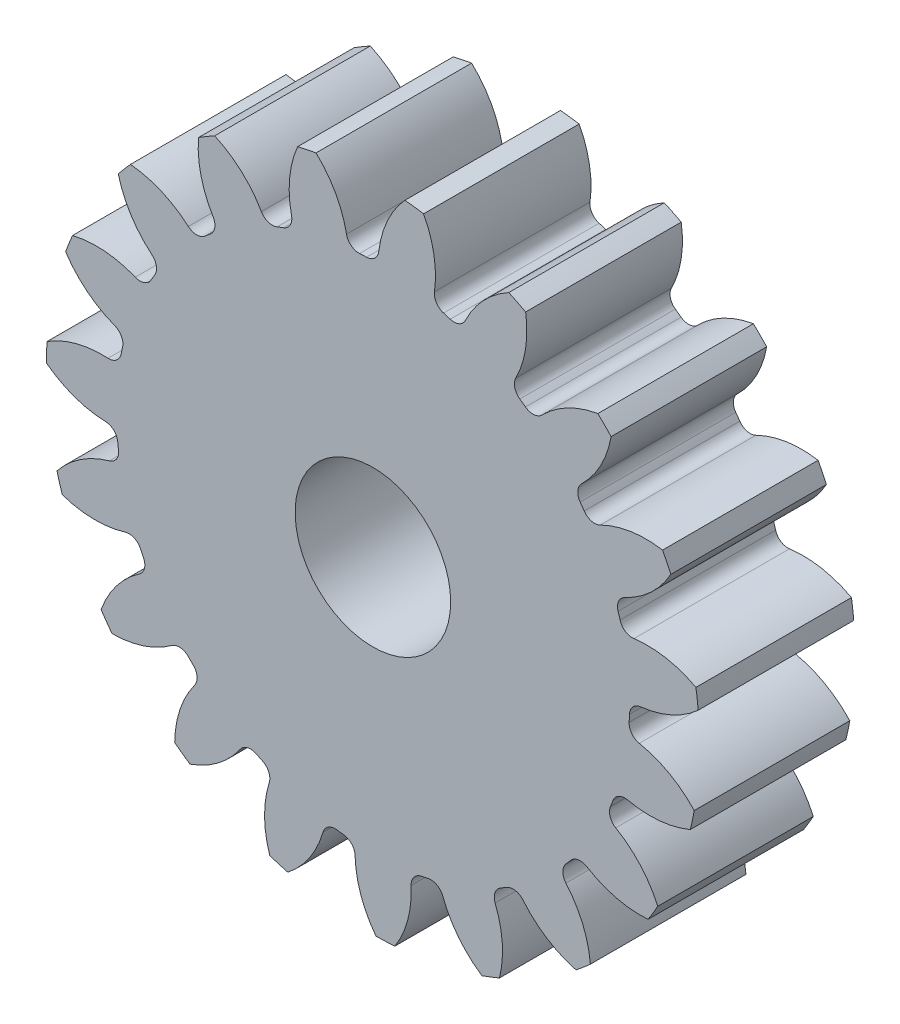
ISO-10303-21;
HEADER;
FILE_DESCRIPTION(('STEP AP214'),'2;1');
FILE_NAME('part.step','',(''),(''),'','','');
FILE_SCHEMA(('AUTOMOTIVE_DESIGN { 1 0 10303 214 1 1 1 1 }'));
ENDSEC;
DATA;
#1=APPLICATION_CONTEXT('core data for automotive mechanical design processes');
#2=APPLICATION_PROTOCOL_DEFINITION('international standard','automotive_design',2000,#1);
#3=PRODUCT_CONTEXT('',#1,'mechanical');
#4=PRODUCT('Part','Part','',(#3));
#5=PRODUCT_RELATED_PRODUCT_CATEGORY('part','',(#4));
#6=PRODUCT_DEFINITION_FORMATION('','',#4);
#7=PRODUCT_DEFINITION_CONTEXT('part definition',#1,'design');
#8=PRODUCT_DEFINITION('design','',#6,#7);
#9=PRODUCT_DEFINITION_SHAPE('','',#8);
#10=(LENGTH_UNIT() NAMED_UNIT(*) SI_UNIT(.MILLI.,.METRE.));
#11=(NAMED_UNIT(*) PLANE_ANGLE_UNIT() SI_UNIT($,.RADIAN.));
#12=(NAMED_UNIT(*) SI_UNIT($,.STERADIAN.) SOLID_ANGLE_UNIT());
#13=UNCERTAINTY_MEASURE_WITH_UNIT(LENGTH_MEASURE(1.E-05),#10,'distance_accuracy_value','');
#14=(GEOMETRIC_REPRESENTATION_CONTEXT(3) GLOBAL_UNCERTAINTY_ASSIGNED_CONTEXT((#13)) GLOBAL_UNIT_ASSIGNED_CONTEXT((#10,
#11,#12)) REPRESENTATION_CONTEXT('',''));
#15=CARTESIAN_POINT('',(0.,0.,0.));
#16=DIRECTION('',(0.,0.,1.));
#17=DIRECTION('',(1.,0.,0.));
#18=AXIS2_PLACEMENT_3D('',#15,#16,#17);
#19=CARTESIAN_POINT('',(0.,0.,101.6));
#20=DIRECTION('',(0.,0.,-1.));
#21=DIRECTION('',(-1.,0.,0.));
#22=AXIS2_PLACEMENT_3D('',#19,#20,#21);
#23=CYLINDRICAL_SURFACE('',#22,213.36);
#24=DIRECTION('',(0.,0.,-1.));
#25=VECTOR('',#24,1.);
#26=CARTESIAN_POINT('',(210.969560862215,31.8486104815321,50.8));
#27=LINE('',#26,#25);
#28=CARTESIAN_POINT('',(210.969560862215,31.8486104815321,101.6));
#29=VERTEX_POINT('',#28);
#30=CARTESIAN_POINT('',(210.969560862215,31.8486104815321,0.));
#31=VERTEX_POINT('',#30);
#32=EDGE_CURVE('E780',#29,#31,#27,.T.);
#33=ORIENTED_EDGE('',*,*,#32,.F.);
#34=CARTESIAN_POINT('',(0.,0.,101.6));
#35=DIRECTION('',(0.,0.,1.));
#36=DIRECTION('',(1.,0.,0.));
#37=AXIS2_PLACEMENT_3D('',#34,#35,#36);
#38=CIRCLE('',#37,213.36);
#39=CARTESIAN_POINT('',(212.454794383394,19.6328791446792,101.6));
#40=VERTEX_POINT('',#39);
#41=EDGE_CURVE('E1463',#40,#29,#38,.T.);
#42=ORIENTED_EDGE('',*,*,#41,.F.);
#43=DIRECTION('',(0.,0.,-1.));
#44=VECTOR('',#43,1.);
#45=CARTESIAN_POINT('',(212.454794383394,19.6328791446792,50.8));
#46=LINE('',#45,#44);
#47=CARTESIAN_POINT('',(212.454794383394,19.6328791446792,0.));
#48=VERTEX_POINT('',#47);
#49=EDGE_CURVE('E1457',#48,#40,#46,.F.);
#50=ORIENTED_EDGE('',*,*,#49,.F.);
#51=CARTESIAN_POINT('',(0.,0.,0.));
#52=DIRECTION('',(0.,0.,1.));
#53=DIRECTION('',(1.,0.,0.));
#54=AXIS2_PLACEMENT_3D('',#51,#52,#53);
#55=CIRCLE('',#54,213.36);
#56=EDGE_CURVE('E1468',#48,#31,#55,.T.);
#57=ORIENTED_EDGE('',*,*,#56,.T.);
#58=EDGE_LOOP('',(#33,#42,#50,#57));
#59=FACE_BOUND('',#58,.T.);
#60=ADVANCED_FACE('F33',(#59),#23,.T.);
#61=DIRECTION('',(0.,0.,-1.));
#62=VECTOR('',#61,1.);
#63=CARTESIAN_POINT('',(194.568622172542,87.553074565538,50.8));
#64=LINE('',#63,#62);
#65=CARTESIAN_POINT('',(194.568622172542,87.553074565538,0.));
#66=VERTEX_POINT('',#65);
#67=CARTESIAN_POINT('',(194.568622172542,87.553074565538,101.6));
#68=VERTEX_POINT('',#67);
#69=EDGE_CURVE('E751',#66,#68,#64,.F.);
#70=ORIENTED_EDGE('',*,*,#69,.F.);
#71=CARTESIAN_POINT('',(189.197421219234,98.624669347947,0.));
#72=VERTEX_POINT('',#71);
#73=EDGE_CURVE('E1471',#66,#72,#55,.T.);
#74=ORIENTED_EDGE('',*,*,#73,.T.);
#75=DIRECTION('',(0.,0.,-1.));
#76=VECTOR('',#75,1.);
#77=CARTESIAN_POINT('',(189.197421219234,98.624669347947,50.8));
#78=LINE('',#77,#76);
#79=CARTESIAN_POINT('',(189.197421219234,98.624669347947,101.6));
#80=VERTEX_POINT('',#79);
#81=EDGE_CURVE('E813',#80,#72,#78,.T.);
#82=ORIENTED_EDGE('',*,*,#81,.F.);
#83=EDGE_CURVE('E1466',#68,#80,#38,.T.);
#84=ORIENTED_EDGE('',*,*,#83,.F.);
#85=EDGE_LOOP('',(#70,#74,#82,#84));
#86=FACE_BOUND('',#85,.T.);
#87=ADVANCED_FACE('F1686',(#86),#23,.T.);
#88=CARTESIAN_POINT('',(0.,0.,101.6));
#89=DIRECTION('',(0.,0.,1.));
#90=DIRECTION('',(1.,0.,0.));
#91=AXIS2_PLACEMENT_3D('',#88,#89,#90);
#92=PLANE('',#91);
#93=CARTESIAN_POINT('',(0.,0.,101.599999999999));
#94=DIRECTION('',(0.,0.,1.));
#95=DIRECTION('',(1.,0.,0.));
#96=AXIS2_PLACEMENT_3D('',#93,#94,#95);
#97=CIRCLE('',#96,50.8);
#98=CARTESIAN_POINT('',(50.8,0.,101.599999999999));
#99=VERTEX_POINT('',#98);
#100=EDGE_CURVE('E768',#99,#99,#97,.T.);
#101=ORIENTED_EDGE('',*,*,#100,.F.);
#102=EDGE_LOOP('',(#101));
#103=FACE_BOUND('',#102,.T.);
#104=ORIENTED_EDGE('',*,*,#41,.T.);
#105=CARTESIAN_POINT('',(179.341808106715,-27.2368476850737,101.6));
#106=DIRECTION('',(0.,0.,-1.));
#107=DIRECTION('',(0.945817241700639,0.32469946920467,0.));
#108=AXIS2_PLACEMENT_3D('',#105,#106,#107);
#109=CIRCLE('',#108,67.017953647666);
#110=CARTESIAN_POINT('',(170.497267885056,39.1949234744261,101.6));
#111=VERTEX_POINT('',#110);
#112=EDGE_CURVE('E760',#111,#29,#109,.T.);
#113=ORIENTED_EDGE('',*,*,#112,.F.);
#114=CARTESIAN_POINT('',(169.405821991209,47.39282659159,101.6));
#115=DIRECTION('',(0.,0.,1.));
#116=DIRECTION('',(-0.945817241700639,-0.32469946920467,0.));
#117=AXIS2_PLACEMENT_3D('',#114,#115,#116);
#118=CIRCLE('',#117,8.27024000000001);
#119=CARTESIAN_POINT('',(161.441380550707,45.1647013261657,101.6));
#120=VERTEX_POINT('',#119);
#121=EDGE_CURVE('E758',#120,#111,#118,.T.);
#122=ORIENTED_EDGE('',*,*,#121,.F.);
#123=CARTESIAN_POINT('',(0.,0.,101.6));
#124=DIRECTION('',(0.,0.,-1.));
#125=DIRECTION('',(0.945817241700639,0.32469946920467,0.));
#126=AXIS2_PLACEMENT_3D('',#123,#124,#125);
#127=CIRCLE('',#126,167.64);
#128=CARTESIAN_POINT('',(160.158142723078,49.523115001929,101.6));
#129=VERTEX_POINT('',#128);
#130=EDGE_CURVE('E743',#129,#120,#127,.T.);
#131=ORIENTED_EDGE('',*,*,#130,.F.);
#132=CARTESIAN_POINT('',(168.059277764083,51.9662553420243,101.6));
#133=DIRECTION('',(0.,0.,1.));
#134=DIRECTION('',(-0.945817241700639,-0.32469946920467,0.));
#135=AXIS2_PLACEMENT_3D('',#132,#133,#134);
#136=CIRCLE('',#135,8.27024000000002);
#137=CARTESIAN_POINT('',(164.534300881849,59.4476594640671,101.6));
#138=VERTEX_POINT('',#137);
#139=EDGE_CURVE('E735',#138,#129,#136,.T.);
#140=ORIENTED_EDGE('',*,*,#139,.F.);
#141=CARTESIAN_POINT('',(135.969623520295,120.073275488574,101.6));
#142=DIRECTION('',(0.,0.,-1.));
#143=DIRECTION('',(-0.945817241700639,-0.32469946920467,0.));
#144=AXIS2_PLACEMENT_3D('',#141,#142,#143);
#145=CIRCLE('',#144,67.017953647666);
#146=EDGE_CURVE('E765',#68,#138,#145,.T.);
#147=ORIENTED_EDGE('',*,*,#146,.F.);
#148=ORIENTED_EDGE('',*,*,#83,.T.);
#149=CARTESIAN_POINT('',(178.46836425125,32.4711097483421,101.6));
#150=DIRECTION('',(0.,0.,-1.));
#151=DIRECTION('',(0.789140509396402,0.614212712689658,0.));
#152=AXIS2_PLACEMENT_3D('',#149,#150,#151);
#153=CIRCLE('',#152,67.017953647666);
#154=CARTESIAN_POINT('',(148.532684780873,92.4316067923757,101.6));
#155=VERTEX_POINT('',#154);
#156=EDGE_CURVE('E789',#155,#80,#153,.T.);
#157=ORIENTED_EDGE('',*,*,#156,.F.);
#158=CARTESIAN_POINT('',(144.838521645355,99.8309330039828,101.6));
#159=DIRECTION('',(0.,0.,1.));
#160=DIRECTION('',(-0.789140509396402,-0.614212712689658,0.));
#161=AXIS2_PLACEMENT_3D('',#158,#159,#160);
#162=CIRCLE('',#161,8.27024000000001);
#163=CARTESIAN_POINT('',(138.029086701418,95.1374838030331,101.6));
#164=VERTEX_POINT('',#163);
#165=EDGE_CURVE('E787',#164,#155,#162,.T.);
#166=ORIENTED_EDGE('',*,*,#165,.F.);
#167=CARTESIAN_POINT('',(0.,0.,101.6));
#168=DIRECTION('',(0.,0.,-1.));
#169=DIRECTION('',(0.789140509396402,0.614212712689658,0.));
#170=AXIS2_PLACEMENT_3D('',#167,#168,#169);
#171=CIRCLE('',#170,167.64);
#172=CARTESIAN_POINT('',(135.400203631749,98.8430799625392,101.6));
#173=VERTEX_POINT('',#172);
#174=EDGE_CURVE('E784',#173,#164,#171,.T.);
#175=ORIENTED_EDGE('',*,*,#174,.F.);
#176=CARTESIAN_POINT('',(142.079947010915,103.719338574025,101.6));
#177=DIRECTION('',(0.,0.,1.));
#178=DIRECTION('',(-0.789140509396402,-0.614212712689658,0.));
#179=AXIS2_PLACEMENT_3D('',#176,#177,#178);
#180=CIRCLE('',#179,8.27024000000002);
#181=CARTESIAN_POINT('',(136.31675515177,109.650821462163,101.6));
#182=VERTEX_POINT('',#181);
#183=EDGE_CURVE('E782',#182,#173,#180,.T.);
#184=ORIENTED_EDGE('',*,*,#183,.F.);
#185=CARTESIAN_POINT('',(89.6146854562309,157.716638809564,101.6));
#186=DIRECTION('',(0.,0.,-1.));
#187=DIRECTION('',(-0.789140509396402,-0.614212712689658,0.));
#188=AXIS2_PLACEMENT_3D('',#185,#186,#187);
#189=CIRCLE('',#188,67.017953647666);
#190=CARTESIAN_POINT('',(155.597920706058,145.985535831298,101.6));
#191=VERTEX_POINT('',#190);
#192=EDGE_CURVE('E792',#191,#182,#189,.T.);
#193=ORIENTED_EDGE('',*,*,#192,.F.);
#194=CARTESIAN_POINT('',(146.922805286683,154.713214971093,101.6));
#195=VERTEX_POINT('',#194);
#196=EDGE_CURVE('E1517',#191,#195,#38,.T.);
#197=ORIENTED_EDGE('',*,*,#196,.T.);
#198=CARTESIAN_POINT('',(158.255103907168,88.6603185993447,101.6));
#199=DIRECTION('',(0.,0.,-1.));
#200=DIRECTION('',(0.546948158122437,0.837166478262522,0.));
#201=AXIS2_PLACEMENT_3D('',#198,#199,#200);
#202=CIRCLE('',#201,67.017953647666);
#203=CARTESIAN_POINT('',(110.472280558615,135.651891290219,101.6));
#204=VERTEX_POINT('',#203);
#205=EDGE_CURVE('E824',#204,#195,#202,.T.);
#206=ORIENTED_EDGE('',*,*,#205,.F.);
#207=CARTESIAN_POINT('',(104.575720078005,141.450808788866,101.6));
#208=DIRECTION('',(0.,0.,1.));
#209=DIRECTION('',(-0.546948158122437,-0.837166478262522,0.));
#210=AXIS2_PLACEMENT_3D('',#207,#208,#209);
#211=CIRCLE('',#210,8.27024000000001);
#212=CARTESIAN_POINT('',(99.6591995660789,134.800643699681,101.6));
#213=VERTEX_POINT('',#212);
#214=EDGE_CURVE('E822',#213,#204,#211,.T.);
#215=ORIENTED_EDGE('',*,*,#214,.F.);
#216=CARTESIAN_POINT('',(0.,0.,101.6));
#217=DIRECTION('',(0.,0.,-1.));
#218=DIRECTION('',(0.546948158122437,0.837166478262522,0.));
#219=AXIS2_PLACEMENT_3D('',#216,#217,#218);
#220=CIRCLE('',#219,167.64);
#221=CARTESIAN_POINT('',(95.9695515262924,137.451863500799,101.6));
#222=VERTEX_POINT('',#221);
#223=EDGE_CURVE('E819',#222,#213,#220,.T.);
#224=ORIENTED_EDGE('',*,*,#223,.F.);
#225=CARTESIAN_POINT('',(100.704049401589,144.232822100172,101.6));
#226=DIRECTION('',(0.,0.,1.));
#227=DIRECTION('',(-0.546948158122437,-0.837166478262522,0.));
#228=AXIS2_PLACEMENT_3D('',#225,#226,#227);
#229=CIRCLE('',#228,8.27024000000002);
#230=CARTESIAN_POINT('',(93.3271738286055,147.971615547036,101.6));
#231=VERTEX_POINT('',#230);
#232=EDGE_CURVE('E817',#231,#222,#229,.T.);
#233=ORIENTED_EDGE('',*,*,#232,.F.);
#234=CARTESIAN_POINT('',(33.5486057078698,178.26895708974,101.6));
#235=DIRECTION('',(0.,0.,-1.));
#236=DIRECTION('',(-0.546948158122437,-0.837166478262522,0.));
#237=AXIS2_PLACEMENT_3D('',#234,#235,#236);
#238=CIRCLE('',#237,67.017953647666);
#239=CARTESIAN_POINT('',(99.7657701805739,188.598199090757,101.6));
#240=VERTEX_POINT('',#239);
#241=EDGE_CURVE('E827',#240,#231,#238,.T.);
#242=ORIENTED_EDGE('',*,*,#241,.F.);
#243=CARTESIAN_POINT('',(88.7268236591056,194.036183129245,101.6));
#244=VERTEX_POINT('',#243);
#245=EDGE_CURVE('E1668',#240,#244,#38,.T.);
#246=ORIENTED_EDGE('',*,*,#245,.T.);
#247=CARTESIAN_POINT('',(120.892447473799,135.241806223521,101.6));
#248=DIRECTION('',(0.,0.,-1.));
#249=DIRECTION('',(0.24548548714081,0.969400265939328,0.));
#250=AXIS2_PLACEMENT_3D('',#247,#248,#249);
#251=CIRCLE('',#250,67.017953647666);
#252=CARTESIAN_POINT('',(60.4404905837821,164.172188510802,101.6));
#253=VERTEX_POINT('',#252);
#254=EDGE_CURVE('E862',#253,#244,#251,.T.);
#255=ORIENTED_EDGE('',*,*,#254,.F.);
#256=CARTESIAN_POINT('',(52.9805165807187,167.742294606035,101.6));
#257=DIRECTION('',(0.,0.,1.));
#258=DIRECTION('',(-0.24548548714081,-0.969400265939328,0.));
#259=AXIS2_PLACEMENT_3D('',#256,#257,#258);
#260=CIRCLE('',#259,8.27024000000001);
#261=CARTESIAN_POINT('',(50.4896917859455,159.856062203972,101.6));
#262=VERTEX_POINT('',#261);
#263=EDGE_CURVE('E860',#262,#253,#260,.T.);
#264=ORIENTED_EDGE('',*,*,#263,.F.);
#265=CARTESIAN_POINT('',(0.,0.,101.6));
#266=DIRECTION('',(0.,0.,-1.));
#267=DIRECTION('',(0.24548548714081,0.969400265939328,0.));
#268=AXIS2_PLACEMENT_3D('',#265,#266,#267);
#269=CIRCLE('',#268,167.64);
#270=CARTESIAN_POINT('',(46.1391093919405,161.165604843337,101.6));
#271=VERTEX_POINT('',#270);
#272=EDGE_CURVE('E857',#271,#262,#269,.T.);
#273=ORIENTED_EDGE('',*,*,#272,.F.);
#274=CARTESIAN_POINT('',(48.4153054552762,169.116441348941,101.6));
#275=DIRECTION('',(0.,0.,1.));
#276=DIRECTION('',(-0.24548548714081,-0.969400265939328,0.));
#277=AXIS2_PLACEMENT_3D('',#274,#275,#276);
#278=CIRCLE('',#277,8.27024000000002);
#279=CARTESIAN_POINT('',(40.2241451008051,170.257389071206,101.6));
#280=VERTEX_POINT('',#279);
#281=EDGE_CURVE('E855',#280,#271,#278,.T.);
#282=ORIENTED_EDGE('',*,*,#281,.F.);
#283=CARTESIAN_POINT('',(-26.1529860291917,179.50306774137,101.6));
#284=DIRECTION('',(0.,0.,-1.));
#285=DIRECTION('',(-0.24548548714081,-0.969400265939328,0.));
#286=AXIS2_PLACEMENT_3D('',#283,#284,#285);
#287=CIRCLE('',#286,67.017953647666);
#288=CARTESIAN_POINT('',(33.1224504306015,210.773321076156,101.6));
#289=VERTEX_POINT('',#288);
#290=EDGE_CURVE('E865',#289,#280,#287,.T.);
#291=ORIENTED_EDGE('',*,*,#290,.F.);
#292=CARTESIAN_POINT('',(20.9159139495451,212.332320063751,101.6));
#293=VERTEX_POINT('',#292);
#294=EDGE_CURVE('E1664',#289,#293,#38,.T.);
#295=ORIENTED_EDGE('',*,*,#294,.T.);
#296=CARTESIAN_POINT('',(70.4292185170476,167.16774565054,101.6));
#297=DIRECTION('',(0.,0.,-1.));
#298=DIRECTION('',(-0.0825793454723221,0.996584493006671,0.));
#299=AXIS2_PLACEMENT_3D('',#296,#297,#298);
#300=CIRCLE('',#299,67.017953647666);
#301=CARTESIAN_POINT('',(3.85903562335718,174.901881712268,101.6));
#302=VERTEX_POINT('',#301);
#303=EDGE_CURVE('E900',#302,#293,#300,.T.);
#304=ORIENTED_EDGE('',*,*,#303,.F.);
#305=CARTESIAN_POINT('',(-4.35594796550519,175.856300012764,101.6));
#306=DIRECTION('',(0.,0.,1.));
#307=DIRECTION('',(0.0825793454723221,-0.996584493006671,0.));
#308=AXIS2_PLACEMENT_3D('',#305,#306,#307);
#309=CIRCLE('',#308,8.27024000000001);
#310=CARTESIAN_POINT('',(-4.15115752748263,167.588595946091,101.6));
#311=VERTEX_POINT('',#310);
#312=EDGE_CURVE('E898',#311,#302,#309,.T.);
#313=ORIENTED_EDGE('',*,*,#312,.F.);
#314=CARTESIAN_POINT('',(0.,0.,101.6));
#315=DIRECTION('',(0.,0.,-1.));
#316=DIRECTION('',(-0.0825793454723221,0.996584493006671,0.));
#317=AXIS2_PLACEMENT_3D('',#314,#315,#316);
#318=CIRCLE('',#317,167.64);
#319=CARTESIAN_POINT('',(-8.69122116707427,167.414552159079,101.6));
#320=VERTEX_POINT('',#319);
#321=EDGE_CURVE('E895',#320,#311,#318,.T.);
#322=ORIENTED_EDGE('',*,*,#321,.F.);
#323=CARTESIAN_POINT('',(-9.11998807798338,175.673670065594,101.6));
#324=DIRECTION('',(0.,0.,1.));
#325=DIRECTION('',(0.0825793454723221,-0.996584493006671,0.));
#326=AXIS2_PLACEMENT_3D('',#323,#324,#325);
#327=CIRCLE('',#326,8.27024000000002);
#328=CARTESIAN_POINT('',(-17.2377938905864,174.093132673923,101.6));
#329=VERTEX_POINT('',#328);
#330=EDGE_CURVE('E893',#329,#320,#327,.T.);
#331=ORIENTED_EDGE('',*,*,#330,.F.);
#332=CARTESIAN_POINT('',(-83.0204959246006,161.285235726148,101.6));
#333=DIRECTION('',(0.,0.,-1.));
#334=DIRECTION('',(0.0825793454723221,-0.996584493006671,0.));
#335=AXIS2_PLACEMENT_3D('',#332,#333,#334);
#336=CIRCLE('',#335,67.017953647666);
#337=CARTESIAN_POINT('',(-37.1102007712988,210.107883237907,101.6));
#338=VERTEX_POINT('',#337);
#339=EDGE_CURVE('E903',#338,#329,#336,.T.);
#340=ORIENTED_EDGE('',*,*,#339,.F.);
#341=CARTESIAN_POINT('',(-49.1615595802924,207.618955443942,101.6));
#342=VERTEX_POINT('',#341);
#343=EDGE_CURVE('E1660',#338,#342,#38,.T.);
#344=ORIENTED_EDGE('',*,*,#343,.T.);
#345=CARTESIAN_POINT('',(12.3338909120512,180.978465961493,101.6));
#346=DIRECTION('',(0.,0.,-1.));
#347=DIRECTION('',(-0.40169542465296,0.915773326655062,0.));
#348=AXIS2_PLACEMENT_3D('',#345,#346,#347);
#349=CIRCLE('',#348,67.017953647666);
#350=CARTESIAN_POINT('',(-53.1406057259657,166.678242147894,101.6));
#351=VERTEX_POINT('',#350);
#352=EDGE_CURVE('E938',#351,#342,#349,.T.);
#353=ORIENTED_EDGE('',*,*,#352,.F.);
#354=CARTESIAN_POINT('',(-61.2203779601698,164.913546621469,101.6));
#355=DIRECTION('',(0.,0.,1.));
#356=DIRECTION('',(0.40169542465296,-0.915773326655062,0.));
#357=AXIS2_PLACEMENT_3D('',#354,#355,#356);
#358=CIRCLE('',#357,8.27024000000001);
#359=CARTESIAN_POINT('',(-58.3421645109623,157.160304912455,101.6));
#360=VERTEX_POINT('',#359);
#361=EDGE_CURVE('E936',#360,#351,#358,.T.);
#362=ORIENTED_EDGE('',*,*,#361,.F.);
#363=CARTESIAN_POINT('',(0.,0.,101.6));
#364=DIRECTION('',(0.,0.,-1.));
#365=DIRECTION('',(-0.40169542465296,0.915773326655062,0.));
#366=AXIS2_PLACEMENT_3D('',#363,#364,#365);
#367=CIRCLE('',#366,167.64);
#368=CARTESIAN_POINT('',(-62.5797230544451,155.521535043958,101.6));
#369=VERTEX_POINT('',#368);
#370=EDGE_CURVE('E933',#369,#360,#367,.T.);
#371=ORIENTED_EDGE('',*,*,#370,.F.);
#372=CARTESIAN_POINT('',(-65.6669893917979,163.193930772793,101.6));
#373=DIRECTION('',(0.,0.,1.));
#374=DIRECTION('',(0.40169542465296,-0.915773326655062,0.));
#375=AXIS2_PLACEMENT_3D('',#372,#373,#374);
#376=CIRCLE('',#375,8.27024000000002);
#377=CARTESIAN_POINT('',(-72.831750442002,159.06318401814,101.6));
#378=VERTEX_POINT('',#377);
#379=EDGE_CURVE('E931',#378,#369,#376,.T.);
#380=ORIENTED_EDGE('',*,*,#379,.F.);
#381=CARTESIAN_POINT('',(-130.891446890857,125.589645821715,101.6));
#382=DIRECTION('',(0.,0.,-1.));
#383=DIRECTION('',(0.40169542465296,-0.915773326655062,0.));
#384=AXIS2_PLACEMENT_3D('',#381,#382,#383);
#385=CIRCLE('',#384,67.017953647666);
#386=CARTESIAN_POINT('',(-103.321385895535,186.673996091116,101.6));
#387=VERTEX_POINT('',#386);
#388=EDGE_CURVE('E941',#387,#378,#385,.T.);
#389=ORIENTED_EDGE('',*,*,#388,.F.);
#390=CARTESIAN_POINT('',(-113.911615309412,180.40685546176,101.6));
#391=VERTEX_POINT('',#390);
#392=EDGE_CURVE('E1656',#387,#391,#38,.T.);
#393=ORIENTED_EDGE('',*,*,#392,.T.);
#394=CARTESIAN_POINT('',(-47.0980051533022,175.177361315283,101.6));
#395=DIRECTION('',(0.,0.,-1.));
#396=DIRECTION('',(-0.677281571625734,0.735723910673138,0.));
#397=AXIS2_PLACEMENT_3D('',#394,#395,#396);
#398=CIRCLE('',#397,67.017953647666);
#399=CARTESIAN_POINT('',(-104.381637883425,140.392428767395,101.6));
#400=VERTEX_POINT('',#399);
#401=EDGE_CURVE('E976',#400,#391,#398,.T.);
#402=ORIENTED_EDGE('',*,*,#401,.F.);
#403=CARTESIAN_POINT('',(-111.450630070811,136.09985155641,101.6));
#404=DIRECTION('',(0.,0.,1.));
#405=DIRECTION('',(0.677281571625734,-0.735723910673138,0.));
#406=AXIS2_PLACEMENT_3D('',#403,#404,#405);
#407=CIRCLE('',#406,8.27024000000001);
#408=CARTESIAN_POINT('',(-106.210892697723,129.701256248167,101.6));
#409=VERTEX_POINT('',#408);
#410=EDGE_CURVE('E974',#409,#400,#407,.T.);
#411=ORIENTED_EDGE('',*,*,#410,.F.);
#412=CARTESIAN_POINT('',(0.,0.,101.6));
#413=DIRECTION('',(0.,0.,-1.));
#414=DIRECTION('',(-0.677281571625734,0.735723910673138,0.));
#415=AXIS2_PLACEMENT_3D('',#412,#413,#414);
#416=CIRCLE('',#415,167.64);
#417=CARTESIAN_POINT('',(-109.686740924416,126.77534644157,101.6));
#418=VERTEX_POINT('',#417);
#419=EDGE_CURVE('E971',#418,#409,#416,.T.);
#420=ORIENTED_EDGE('',*,*,#419,.F.);
#421=CARTESIAN_POINT('',(-115.097953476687,133.029596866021,101.6));
#422=DIRECTION('',(0.,0.,1.));
#423=DIRECTION('',(0.677281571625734,-0.735723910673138,0.));
#424=AXIS2_PLACEMENT_3D('',#421,#422,#423);
#425=CIRCLE('',#424,8.27024000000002);
#426=CARTESIAN_POINT('',(-120.53325673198,126.796271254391,101.6));
#427=VERTEX_POINT('',#426);
#428=EDGE_CURVE('E969',#427,#418,#425,.T.);
#429=ORIENTED_EDGE('',*,*,#428,.F.);
#430=CARTESIAN_POINT('',(-164.578278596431,76.2844690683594,101.6));
#431=DIRECTION('',(0.,0.,-1.));
#432=DIRECTION('',(0.677281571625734,-0.735723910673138,0.));
#433=AXIS2_PLACEMENT_3D('',#430,#431,#432);
#434=CIRCLE('',#433,67.017953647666);
#435=CARTESIAN_POINT('',(-158.336095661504,143.011084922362,101.6));
#436=VERTEX_POINT('',#435);
#437=EDGE_CURVE('E979',#436,#427,#434,.T.);
#438=ORIENTED_EDGE('',*,*,#437,.F.);
#439=CARTESIAN_POINT('',(-166.317579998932,133.644873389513,101.6));
#440=VERTEX_POINT('',#439);
#441=EDGE_CURVE('E1652',#436,#440,#38,.T.);
#442=ORIENTED_EDGE('',*,*,#441,.T.);
#443=CARTESIAN_POINT('',(-101.426101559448,150.39307141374,101.6));
#444=DIRECTION('',(0.,0.,-1.));
#445=DIRECTION('',(-0.879473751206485,0.475947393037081,0.));
#446=AXIS2_PLACEMENT_3D('',#443,#444,#445);
#447=CIRCLE('',#446,67.017953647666);
#448=CARTESIAN_POINT('',(-144.311299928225,98.8929173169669,101.6));
#449=VERTEX_POINT('',#448);
#450=EDGE_CURVE('E1014',#449,#440,#447,.T.);
#451=ORIENTED_EDGE('',*,*,#450,.F.);
#452=CARTESIAN_POINT('',(-149.603477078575,92.5376257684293,101.6));
#453=DIRECTION('',(0.,0.,1.));
#454=DIRECTION('',(0.879473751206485,-0.475947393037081,0.));
#455=AXIS2_PLACEMENT_3D('',#452,#453,#454);
#456=CIRCLE('',#455,8.27024000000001);
#457=CARTESIAN_POINT('',(-142.570022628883,88.187063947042,101.6));
#458=VERTEX_POINT('',#457);
#459=EDGE_CURVE('E1012',#458,#449,#456,.T.);
#460=ORIENTED_EDGE('',*,*,#459,.F.);
#461=CARTESIAN_POINT('',(0.,0.,101.6));
#462=DIRECTION('',(0.,0.,-1.));
#463=DIRECTION('',(-0.879473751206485,0.475947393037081,0.));
#464=AXIS2_PLACEMENT_3D('',#461,#462,#463);
#465=CIRCLE('',#464,167.64);
#466=CARTESIAN_POINT('',(-144.907498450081,84.2910819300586,101.6));
#467=VERTEX_POINT('',#466);
#468=EDGE_CURVE('E1009',#467,#458,#465,.T.);
#469=ORIENTED_EDGE('',*,*,#468,.F.);
#470=CARTESIAN_POINT('',(-152.056268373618,88.4494419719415,101.6));
#471=DIRECTION('',(0.,0.,1.));
#472=DIRECTION('',(0.879473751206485,-0.475947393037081,0.));
#473=AXIS2_PLACEMENT_3D('',#470,#471,#472);
#474=CIRCLE('',#473,8.27024000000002);
#475=CARTESIAN_POINT('',(-155.17311438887,80.7890150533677,101.6));
#476=VERTEX_POINT('',#475);
#477=EDGE_CURVE('E1007',#476,#467,#474,.T.);
#478=ORIENTED_EDGE('',*,*,#477,.F.);
#479=CARTESIAN_POINT('',(-180.430500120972,18.7126864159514,101.6));
#480=DIRECTION('',(0.,0.,-1.));
#481=DIRECTION('',(0.879473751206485,-0.475947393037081,0.));
#482=AXIS2_PLACEMENT_3D('',#479,#480,#481);
#483=CIRCLE('',#482,67.017953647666);
#484=CARTESIAN_POINT('',(-196.192632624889,83.8507036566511,101.6));
#485=VERTEX_POINT('',#484);
#486=EDGE_CURVE('E1017',#485,#476,#483,.T.);
#487=ORIENTED_EDGE('',*,*,#486,.F.);
#488=CARTESIAN_POINT('',(-200.700454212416,72.4003955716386,101.6));
#489=VERTEX_POINT('',#488);
#490=EDGE_CURVE('E1648',#485,#489,#38,.T.);
#491=ORIENTED_EDGE('',*,*,#490,.T.);
#492=CARTESIAN_POINT('',(-144.763106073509,109.311358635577,101.6));
#493=DIRECTION('',(0.,0.,-1.));
#494=DIRECTION('',(-0.986361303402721,0.164594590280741,0.));
#495=AXIS2_PLACEMENT_3D('',#492,#493,#494);
#496=CIRCLE('',#495,67.017953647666);
#497=CARTESIAN_POINT('',(-168.602593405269,46.6768237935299,101.6));
#498=VERTEX_POINT('',#497);
#499=EDGE_CURVE('E1052',#498,#489,#496,.T.);
#500=ORIENTED_EDGE('',*,*,#499,.F.);
#501=CARTESIAN_POINT('',(-171.544466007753,38.9475123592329,101.6));
#502=DIRECTION('',(0.,0.,1.));
#503=DIRECTION('',(0.986361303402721,-0.164594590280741,0.));
#504=AXIS2_PLACEMENT_3D('',#501,#502,#503);
#505=CIRCLE('',#504,8.27024000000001);
#506=CARTESIAN_POINT('',(-163.479478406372,37.1164349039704,101.6));
#507=VERTEX_POINT('',#506);
#508=EDGE_CURVE('E1050',#507,#498,#505,.T.);
#509=ORIENTED_EDGE('',*,*,#508,.F.);
#510=CARTESIAN_POINT('',(0.,0.,101.6));
#511=DIRECTION('',(0.,0.,-1.));
#512=DIRECTION('',(-0.986361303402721,0.164594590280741,0.));
#513=AXIS2_PLACEMENT_3D('',#510,#511,#512);
#514=CIRCLE('',#513,167.64);
#515=CARTESIAN_POINT('',(-164.425280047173,32.6725707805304,101.6));
#516=VERTEX_POINT('',#515);
#517=EDGE_CURVE('E1047',#516,#507,#514,.T.);
#518=ORIENTED_EDGE('',*,*,#517,.F.);
#519=CARTESIAN_POINT('',(-172.536927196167,34.2844176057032,101.6));
#520=DIRECTION('',(0.,0.,1.));
#521=DIRECTION('',(0.986361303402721,-0.164594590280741,0.));
#522=AXIS2_PLACEMENT_3D('',#519,#520,#521);
#523=CIRCLE('',#522,8.27024000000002);
#524=CARTESIAN_POINT('',(-172.997557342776,26.0270155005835,101.6));
#525=VERTEX_POINT('',#524);
#526=EDGE_CURVE('E1045',#525,#516,#523,.T.);
#527=ORIENTED_EDGE('',*,*,#526,.F.);
#528=CARTESIAN_POINT('',(-176.730277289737,-40.8869061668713,101.6));
#529=DIRECTION('',(0.,0.,-1.));
#530=DIRECTION('',(0.986361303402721,-0.164594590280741,0.));
#531=AXIS2_PLACEMENT_3D('',#528,#529,#530);
#532=CIRCLE('',#531,67.017953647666);
#533=CARTESIAN_POINT('',(-212.788653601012,15.6037975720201,101.6));
#534=VERTEX_POINT('',#533);
#535=EDGE_CURVE('E1055',#534,#525,#532,.T.);
#536=ORIENTED_EDGE('',*,*,#535,.F.);
#537=CARTESIAN_POINT('',(-213.334320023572,3.31021148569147,101.6));
#538=VERTEX_POINT('',#537);
#539=EDGE_CURVE('E1644',#534,#538,#38,.T.);
#540=ORIENTED_EDGE('',*,*,#539,.T.);
#541=CARTESIAN_POINT('',(-172.412781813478,56.3840640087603,101.6));
#542=DIRECTION('',(0.,0.,-1.));
#543=DIRECTION('',(-0.986361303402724,-0.164594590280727,0.));
#544=AXIS2_PLACEMENT_3D('',#541,#542,#543);
#545=CIRCLE('',#544,67.017953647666);
#546=CARTESIAN_POINT('',(-174.623179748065,-10.5974278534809,101.6));
#547=VERTEX_POINT('',#546);
#548=EDGE_CURVE('E1090',#547,#538,#545,.T.);
#549=ORIENTED_EDGE('',*,*,#548,.F.);
#550=CARTESIAN_POINT('',(-174.895950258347,-18.8631683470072,101.6));
#551=DIRECTION('',(0.,0.,1.));
#552=DIRECTION('',(0.986361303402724,0.164594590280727,0.));
#553=AXIS2_PLACEMENT_3D('',#550,#551,#552);
#554=CIRCLE('',#553,8.27024000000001);
#555=CARTESIAN_POINT('',(-166.673396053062,-17.976335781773,101.6));
#556=VERTEX_POINT('',#555);
#557=EDGE_CURVE('E1088',#556,#547,#554,.T.);
#558=ORIENTED_EDGE('',*,*,#557,.F.);
#559=CARTESIAN_POINT('',(0.,0.,101.6));
#560=DIRECTION('',(0.,0.,-1.));
#561=DIRECTION('',(-0.986361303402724,-0.164594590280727,0.));
#562=AXIS2_PLACEMENT_3D('',#559,#560,#561);
#563=CIRCLE('',#562,167.64);
#564=CARTESIAN_POINT('',(-166.125031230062,-22.4865203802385,101.6));
#565=VERTEX_POINT('',#564);
#566=EDGE_CURVE('E1085',#565,#556,#563,.T.);
#567=ORIENTED_EDGE('',*,*,#566,.F.);
#568=CARTESIAN_POINT('',(-174.320532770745,-23.5958553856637,101.6));
#569=DIRECTION('',(0.,0.,1.));
#570=DIRECTION('',(0.986361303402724,0.164594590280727,0.));
#571=AXIS2_PLACEMENT_3D('',#568,#569,#570);
#572=CIRCLE('',#571,8.27024000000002);
#573=CARTESIAN_POINT('',(-172.075030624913,-31.5554150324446,101.6));
#574=VERTEX_POINT('',#573);
#575=EDGE_CURVE('E1083',#574,#565,#572,.T.);
#576=ORIENTED_EDGE('',*,*,#575,.F.);
#577=CARTESIAN_POINT('',(-153.878586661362,-96.055768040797,101.6));
#578=DIRECTION('',(0.,0.,-1.));
#579=DIRECTION('',(0.986361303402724,0.164594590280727,0.));
#580=AXIS2_PLACEMENT_3D('',#577,#578,#579);
#581=CIRCLE('',#580,67.017953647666);
#582=CARTESIAN_POINT('',(-206.325722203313,-54.3340220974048,101.6));
#583=VERTEX_POINT('',#582);
#584=EDGE_CURVE('E1093',#583,#574,#581,.T.);
#585=ORIENTED_EDGE('',*,*,#584,.F.);
#586=CARTESIAN_POINT('',(-202.850102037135,-66.1386853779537,101.6));
#587=VERTEX_POINT('',#586);
#588=EDGE_CURVE('E1640',#583,#587,#38,.T.);
#589=ORIENTED_EDGE('',*,*,#588,.T.);
#590=CARTESIAN_POINT('',(-181.378857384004,-2.65331884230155,101.6));
#591=DIRECTION('',(0.,0.,-1.));
#592=DIRECTION('',(-0.879473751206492,-0.475947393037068,0.));
#593=AXIS2_PLACEMENT_3D('',#590,#591,#592);
#594=CIRCLE('',#593,67.017953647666);
#595=CARTESIAN_POINT('',(-161.720635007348,-66.7232837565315,101.6));
#596=VERTEX_POINT('',#595);
#597=EDGE_CURVE('E1128',#596,#587,#594,.T.);
#598=ORIENTED_EDGE('',*,*,#597,.F.);
#599=CARTESIAN_POINT('',(-159.294744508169,-74.6297320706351,101.6));
#600=DIRECTION('',(0.,0.,1.));
#601=DIRECTION('',(0.879473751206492,0.475947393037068,0.));
#602=AXIS2_PLACEMENT_3D('',#599,#600,#601);
#603=CIRCLE('',#602,8.27024000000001);
#604=CARTESIAN_POINT('',(-151.805665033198,-71.1210915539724,101.6));
#605=VERTEX_POINT('',#604);
#606=EDGE_CURVE('E1126',#605,#596,#603,.T.);
#607=ORIENTED_EDGE('',*,*,#606,.F.);
#608=CARTESIAN_POINT('',(0.,0.,101.6));
#609=DIRECTION('',(0.,0.,-1.));
#610=DIRECTION('',(-0.879473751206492,-0.475947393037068,0.));
#611=AXIS2_PLACEMENT_3D('',#608,#609,#610);
#612=CIRCLE('',#611,167.64);
#613=CARTESIAN_POINT('',(-149.822557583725,-75.208848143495,101.6));
#614=VERTEX_POINT('',#613);
#615=EDGE_CURVE('E1123',#614,#605,#612,.T.);
#616=ORIENTED_EDGE('',*,*,#615,.F.);
#617=CARTESIAN_POINT('',(-157.213803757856,-78.9191513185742,101.6));
#618=DIRECTION('',(0.,0.,1.));
#619=DIRECTION('',(0.879473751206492,0.475947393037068,0.));
#620=AXIS2_PLACEMENT_3D('',#617,#618,#619);
#621=CIRCLE('',#620,8.27024000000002);
#622=CARTESIAN_POINT('',(-152.505504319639,-85.7183267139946,101.6));
#623=VERTEX_POINT('',#622);
#624=EDGE_CURVE('E1121',#623,#614,#621,.T.);
#625=ORIENTED_EDGE('',*,*,#624,.F.);
#626=CARTESIAN_POINT('',(-114.351763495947,-140.815496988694,101.6));
#627=DIRECTION('',(0.,0.,-1.));
#628=DIRECTION('',(0.879473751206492,0.475947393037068,0.));
#629=AXIS2_PLACEMENT_3D('',#626,#627,#628);
#630=CIRCLE('',#629,67.017953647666);
#631=CARTESIAN_POINT('',(-177.504197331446,-118.383907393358,101.6));
#632=VERTEX_POINT('',#631);
#633=EDGE_CURVE('E1131',#632,#623,#630,.T.);
#634=ORIENTED_EDGE('',*,*,#633,.F.);
#635=CARTESIAN_POINT('',(-170.383927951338,-128.420429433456,101.6));
#636=VERTEX_POINT('',#635);
#637=EDGE_CURVE('E1636',#632,#636,#38,.T.);
#638=ORIENTED_EDGE('',*,*,#637,.T.);
#639=CARTESIAN_POINT('',(-170.689719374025,-61.4031734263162,101.6));
#640=DIRECTION('',(0.,0.,-1.));
#641=DIRECTION('',(-0.677281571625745,-0.735723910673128,0.));
#642=AXIS2_PLACEMENT_3D('',#639,#640,#641);
#643=CIRCLE('',#642,67.017953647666);
#644=CARTESIAN_POINT('',(-131.293150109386,-115.618636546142,101.6));
#645=VERTEX_POINT('',#644);
#646=EDGE_CURVE('E1166',#645,#636,#643,.T.);
#647=ORIENTED_EDGE('',*,*,#646,.F.);
#648=CARTESIAN_POINT('',(-126.431481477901,-122.309006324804,101.6));
#649=DIRECTION('',(0.,0.,1.));
#650=DIRECTION('',(0.677281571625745,0.735723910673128,0.));
#651=AXIS2_PLACEMENT_3D('',#648,#649,#650);
#652=CIRCLE('',#651,8.27024000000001);
#653=CARTESIAN_POINT('',(-120.487434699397,-116.55877349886,101.6));
#654=VERTEX_POINT('',#653);
#655=EDGE_CURVE('E1164',#654,#645,#652,.T.);
#656=ORIENTED_EDGE('',*,*,#655,.F.);
#657=CARTESIAN_POINT('',(0.,0.,101.6));
#658=DIRECTION('',(0.,0.,-1.));
#659=DIRECTION('',(-0.677281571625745,-0.735723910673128,0.));
#660=AXIS2_PLACEMENT_3D('',#657,#658,#659);
#661=CIRCLE('',#660,167.64);
#662=CARTESIAN_POINT('',(-117.284485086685,-119.781130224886,101.6));
#663=VERTEX_POINT('',#662);
#664=EDGE_CURVE('E1161',#663,#654,#661,.T.);
#665=ORIENTED_EDGE('',*,*,#664,.F.);
#666=CARTESIAN_POINT('',(-123.070519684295,-125.690332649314,101.6));
#667=DIRECTION('',(0.,0.,1.));
#668=DIRECTION('',(0.677281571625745,0.735723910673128,0.));
#669=AXIS2_PLACEMENT_3D('',#666,#667,#668);
#670=CIRCLE('',#669,8.27024000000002);
#671=CARTESIAN_POINT('',(-116.409640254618,-130.592327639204,101.6));
#672=VERTEX_POINT('',#671);
#673=EDGE_CURVE('E1159',#672,#663,#670,.T.);
#674=ORIENTED_EDGE('',*,*,#673,.F.);
#675=CARTESIAN_POINT('',(-62.4331524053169,-170.315681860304,101.6));
#676=DIRECTION('',(0.,0.,-1.));
#677=DIRECTION('',(0.677281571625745,0.735723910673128,0.));
#678=AXIS2_PLACEMENT_3D('',#675,#676,#677);
#679=CIRCLE('',#678,67.017953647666);
#680=CARTESIAN_POINT('',(-129.447338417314,-169.605059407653,101.6));
#681=VERTEX_POINT('',#680);
#682=EDGE_CURVE('E1169',#681,#672,#679,.T.);
#683=ORIENTED_EDGE('',*,*,#682,.F.);
#684=CARTESIAN_POINT('',(-119.454011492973,-176.785827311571,101.6));
#685=VERTEX_POINT('',#684);
#686=EDGE_CURVE('E1632',#681,#685,#38,.T.);
#687=ORIENTED_EDGE('',*,*,#686,.T.);
#688=CARTESIAN_POINT('',(-141.503701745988,-113.499041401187,101.6));
#689=DIRECTION('',(0.,0.,-1.));
#690=DIRECTION('',(-0.401695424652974,-0.915773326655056,0.));
#691=AXIS2_PLACEMENT_3D('',#688,#689,#690);
#692=CIRCLE('',#691,67.017953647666);
#693=CARTESIAN_POINT('',(-86.6380151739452,-151.984916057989,101.6));
#694=VERTEX_POINT('',#693);
#695=EDGE_CURVE('E1204',#694,#685,#692,.T.);
#696=ORIENTED_EDGE('',*,*,#695,.F.);
#697=CARTESIAN_POINT('',(-79.8674056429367,-156.734201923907,101.6));
#698=DIRECTION('',(0.,0.,1.));
#699=DIRECTION('',(0.401695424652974,0.915773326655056,0.));
#700=AXIS2_PLACEMENT_3D('',#697,#698,#699);
#701=CIRCLE('',#700,8.27024000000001);
#702=CARTESIAN_POINT('',(-76.1125212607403,-149.365503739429,101.6));
#703=VERTEX_POINT('',#702);
#704=EDGE_CURVE('E1202',#703,#694,#701,.T.);
#705=ORIENTED_EDGE('',*,*,#704,.F.);
#706=CARTESIAN_POINT('',(0.,0.,101.6));
#707=DIRECTION('',(0.,0.,-1.));
#708=DIRECTION('',(-0.401695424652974,-0.915773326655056,0.));
#709=AXIS2_PLACEMENT_3D('',#706,#707,#708);
#710=CIRCLE('',#709,167.64);
#711=CARTESIAN_POINT('',(-72.0368187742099,-151.373268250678,101.6));
#712=VERTEX_POINT('',#711);
#713=EDGE_CURVE('E1199',#712,#703,#710,.T.);
#714=ORIENTED_EDGE('',*,*,#713,.F.);
#715=CARTESIAN_POINT('',(-75.5906351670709,-158.841016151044,101.6));
#716=DIRECTION('',(0.,0.,1.));
#717=DIRECTION('',(0.401695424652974,0.915773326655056,0.));
#718=AXIS2_PLACEMENT_3D('',#715,#716,#717);
#719=CIRCLE('',#718,8.27024000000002);
#720=CARTESIAN_POINT('',(-67.6989853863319,-161.31462351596,101.6));
#721=VERTEX_POINT('',#720);
#722=EDGE_CURVE('E1197',#721,#712,#719,.T.);
#723=ORIENTED_EDGE('',*,*,#722,.F.);
#724=CARTESIAN_POINT('',(-3.7489405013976,-181.359519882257,101.6));
#725=DIRECTION('',(0.,0.,-1.));
#726=DIRECTION('',(0.401695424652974,0.915773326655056,0.));
#727=AXIS2_PLACEMENT_3D('',#724,#725,#726);
#728=CIRCLE('',#727,67.017953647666);
#729=CARTESIAN_POINT('',(-67.3628518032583,-202.446871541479,101.6));
#730=VERTEX_POINT('',#729);
#731=EDGE_CURVE('E1207',#730,#721,#728,.T.);
#732=ORIENTED_EDGE('',*,*,#731,.F.);
#733=CARTESIAN_POINT('',(-55.5793993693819,-205.993737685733,101.6));
#734=VERTEX_POINT('',#733);
#735=EDGE_CURVE('E1628',#730,#734,#38,.T.);
#736=ORIENTED_EDGE('',*,*,#735,.T.);
#737=CARTESIAN_POINT('',(-96.9835623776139,-153.295527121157,101.6));
#738=DIRECTION('',(0.,0.,-1.));
#739=DIRECTION('',(-0.082579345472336,-0.99658449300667,0.));
#740=AXIS2_PLACEMENT_3D('',#737,#738,#739);
#741=CIRCLE('',#740,67.017953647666);
#742=CARTESIAN_POINT('',(-32.5943069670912,-171.881271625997,101.6));
#743=VERTEX_POINT('',#742);
#744=EDGE_CURVE('E1242',#743,#734,#741,.T.);
#745=ORIENTED_EDGE('',*,*,#744,.F.);
#746=CARTESIAN_POINT('',(-24.6484571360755,-174.174814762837,101.6));
#747=DIRECTION('',(0.,0.,1.));
#748=DIRECTION('',(0.082579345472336,0.99658449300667,0.));
#749=AXIS2_PLACEMENT_3D('',#746,#747,#748);
#750=CIRCLE('',#749,8.27024000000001);
#751=CARTESIAN_POINT('',(-23.4896351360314,-165.986164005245,101.6));
#752=VERTEX_POINT('',#751);
#753=EDGE_CURVE('E1240',#752,#743,#750,.T.);
#754=ORIENTED_EDGE('',*,*,#753,.F.);
#755=CARTESIAN_POINT('',(0.,0.,101.6));
#756=DIRECTION('',(0.,0.,-1.));
#757=DIRECTION('',(-0.082579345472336,-0.99658449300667,0.));
#758=AXIS2_PLACEMENT_3D('',#755,#756,#757);
#759=CIRCLE('',#758,167.64);
#760=CARTESIAN_POINT('',(-18.9828453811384,-166.561763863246,101.6));
#761=VERTEX_POINT('',#760);
#762=EDGE_CURVE('E1237',#761,#752,#759,.T.);
#763=ORIENTED_EDGE('',*,*,#762,.F.);
#764=CARTESIAN_POINT('',(-19.9193324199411,-174.7788108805,101.6));
#765=DIRECTION('',(0.,0.,1.));
#766=DIRECTION('',(0.082579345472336,0.99658449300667,0.));
#767=AXIS2_PLACEMENT_3D('',#764,#765,#766);
#768=CIRCLE('',#767,8.27024000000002);
#769=CARTESIAN_POINT('',(-11.6520949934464,-174.555976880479,101.6));
#770=VERTEX_POINT('',#769);
#771=EDGE_CURVE('E1235',#770,#761,#768,.T.);
#772=ORIENTED_EDGE('',*,*,#771,.F.);
#773=CARTESIAN_POINT('',(55.3415272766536,-172.750239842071,101.6));
#774=DIRECTION('',(0.,0.,-1.));
#775=DIRECTION('',(0.082579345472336,0.99658449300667,0.));
#776=AXIS2_PLACEMENT_3D('',#773,#774,#775);
#777=CIRCLE('',#776,67.017953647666);
#778=CARTESIAN_POINT('',(2.02144504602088,-213.350423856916,101.6));
#779=VERTEX_POINT('',#778);
#780=EDGE_CURVE('E1245',#779,#770,#777,.T.);
#781=ORIENTED_EDGE('',*,*,#780,.F.);
#782=CARTESIAN_POINT('',(14.3181030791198,-212.879030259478,101.6));
#783=VERTEX_POINT('',#782);
#784=EDGE_CURVE('E1624',#779,#783,#38,.T.);
#785=ORIENTED_EDGE('',*,*,#784,.T.);
#786=CARTESIAN_POINT('',(-41.9537491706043,-176.480063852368,101.6));
#787=DIRECTION('',(0.,0.,-1.));
#788=DIRECTION('',(0.245485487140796,-0.969400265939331,0.));
#789=AXIS2_PLACEMENT_3D('',#786,#787,#788);
#790=CIRCLE('',#789,67.017953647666);
#791=CARTESIAN_POINT('',(24.9815001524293,-173.151624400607,101.6));
#792=VERTEX_POINT('',#791);
#793=EDGE_CURVE('E1280',#792,#783,#790,.T.);
#794=ORIENTED_EDGE('',*,*,#793,.F.);
#795=CARTESIAN_POINT('',(33.2415341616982,-172.740883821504,101.6));
#796=DIRECTION('',(0.,0.,1.));
#797=DIRECTION('',(-0.245485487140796,0.969400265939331,0.));
#798=AXIS2_PLACEMENT_3D('',#795,#796,#797);
#799=CIRCLE('',#798,8.27024000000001);
#800=CARTESIAN_POINT('',(31.6787174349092,-164.619647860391,101.6));
#801=VERTEX_POINT('',#800);
#802=EDGE_CURVE('E1278',#801,#792,#799,.T.);
#803=ORIENTED_EDGE('',*,*,#802,.F.);
#804=CARTESIAN_POINT('',(0.,0.,101.6));
#805=DIRECTION('',(0.,0.,-1.));
#806=DIRECTION('',(0.245485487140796,-0.969400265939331,0.));
#807=AXIS2_PLACEMENT_3D('',#804,#805,#806);
#808=CIRCLE('',#807,167.64);
#809=CARTESIAN_POINT('',(36.1282138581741,-163.700707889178,101.6));
#810=VERTEX_POINT('',#809);
#811=EDGE_CURVE('E1275',#810,#801,#808,.T.);
#812=ORIENTED_EDGE('',*,*,#811,.F.);
#813=CARTESIAN_POINT('',(37.9105390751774,-171.776609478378,101.6));
#814=DIRECTION('',(0.,0.,1.));
#815=DIRECTION('',(-0.245485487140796,0.969400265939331,0.));
#816=AXIS2_PLACEMENT_3D('',#813,#814,#815);
#817=CIRCLE('',#816,8.27024000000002);
#818=CARTESIAN_POINT('',(45.6574806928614,-168.881481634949,101.6));
#819=VERTEX_POINT('',#818);
#820=EDGE_CURVE('E1273',#819,#810,#817,.T.);
#821=ORIENTED_EDGE('',*,*,#820,.F.);
#822=CARTESIAN_POINT('',(108.434881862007,-145.420790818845,101.6));
#823=DIRECTION('',(0.,0.,-1.));
#824=DIRECTION('',(-0.245485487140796,0.969400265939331,0.));
#825=AXIS2_PLACEMENT_3D('',#822,#823,#824);
#826=CIRCLE('',#825,67.017953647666);
#827=CARTESIAN_POINT('',(71.186686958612,-201.134147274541,101.6));
#828=VERTEX_POINT('',#827);
#829=EDGE_CURVE('E1283',#828,#819,#826,.T.);
#830=ORIENTED_EDGE('',*,*,#829,.F.);
#831=CARTESIAN_POINT('',(82.6640168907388,-196.695576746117,101.6));
#832=VERTEX_POINT('',#831);
#833=EDGE_CURVE('E1620',#828,#832,#38,.T.);
#834=ORIENTED_EDGE('',*,*,#833,.T.);
#835=CARTESIAN_POINT('',(17.6224037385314,-180.54024729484,101.6));
#836=DIRECTION('',(0.,0.,-1.));
#837=DIRECTION('',(0.546948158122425,-0.83716647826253,0.));
#838=AXIS2_PLACEMENT_3D('',#835,#836,#837);
#839=CIRCLE('',#838,67.017953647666);
#840=CARTESIAN_POINT('',(79.8501741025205,-155.658311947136,101.6));
#841=VERTEX_POINT('',#840);
#842=EDGE_CURVE('E1318',#841,#832,#839,.T.);
#843=ORIENTED_EDGE('',*,*,#842,.F.);
#844=CARTESIAN_POINT('',(87.529289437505,-152.587797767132,101.6));
#845=DIRECTION('',(0.,0.,1.));
#846=DIRECTION('',(-0.546948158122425,0.83716647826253,0.));
#847=AXIS2_PLACEMENT_3D('',#844,#845,#846);
#848=CIRCLE('',#847,8.27024000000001);
#849=CARTESIAN_POINT('',(83.4141894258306,-145.414038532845,101.6));
#850=VERTEX_POINT('',#849);
#851=EDGE_CURVE('E1316',#850,#841,#848,.T.);
#852=ORIENTED_EDGE('',*,*,#851,.F.);
#853=CARTESIAN_POINT('',(0.,0.,101.6));
#854=DIRECTION('',(0.,0.,-1.));
#855=DIRECTION('',(0.546948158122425,-0.83716647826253,0.));
#856=AXIS2_PLACEMENT_3D('',#853,#854,#855);
#857=CIRCLE('',#856,167.64);
#858=CARTESIAN_POINT('',(87.324220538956,-143.100140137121,101.6));
#859=VERTEX_POINT('',#858);
#860=EDGE_CURVE('E1313',#859,#850,#857,.T.);
#861=ORIENTED_EDGE('',*,*,#860,.F.);
#862=CARTESIAN_POINT('',(91.6322154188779,-150.159747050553,101.6));
#863=DIRECTION('',(0.,0.,1.));
#864=DIRECTION('',(-0.546948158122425,0.83716647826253,0.));
#865=AXIS2_PLACEMENT_3D('',#862,#863,#864);
#866=CIRCLE('',#865,8.27024000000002);
#867=CARTESIAN_POINT('',(98.0193598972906,-144.906057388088,101.6));
#868=VERTEX_POINT('',#867);
#869=EDGE_CURVE('E1311',#868,#859,#866,.T.);
#870=ORIENTED_EDGE('',*,*,#869,.F.);
#871=CARTESIAN_POINT('',(149.777634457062,-102.332742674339,101.6));
#872=DIRECTION('',(0.,0.,-1.));
#873=DIRECTION('',(-0.546948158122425,0.83716647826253,0.));
#874=AXIS2_PLACEMENT_3D('',#871,#872,#873);
#875=CIRCLE('',#874,67.017953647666);
#876=CARTESIAN_POINT('',(132.637746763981,-167.121864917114,101.6));
#877=VERTEX_POINT('',#876);
#878=EDGE_CURVE('E1321',#877,#868,#875,.T.);
#879=ORIENTED_EDGE('',*,*,#878,.F.);
#880=CARTESIAN_POINT('',(142.052001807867,-159.197105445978,101.6));
#881=VERTEX_POINT('',#880);
#882=EDGE_CURVE('E1616',#877,#881,#38,.T.);
#883=ORIENTED_EDGE('',*,*,#882,.T.);
#884=CARTESIAN_POINT('',(75.2888957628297,-165.036093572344,101.6));
#885=DIRECTION('',(0.,0.,-1.));
#886=DIRECTION('',(0.789140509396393,-0.614212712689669,0.));
#887=AXIS2_PLACEMENT_3D('',#884,#885,#886);
#888=CIRCLE('',#887,67.017953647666);
#889=CARTESIAN_POINT('',(126.065842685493,-121.297006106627,101.6));
#890=VERTEX_POINT('',#889);
#891=EDGE_CURVE('E1356',#890,#881,#888,.T.);
#892=ORIENTED_EDGE('',*,*,#891,.F.);
#893=CARTESIAN_POINT('',(132.331888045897,-115.899456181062,101.6));
#894=DIRECTION('',(0.,0.,1.));
#895=DIRECTION('',(-0.789140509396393,0.614212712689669,0.));
#896=AXIS2_PLACEMENT_3D('',#893,#894,#895);
#897=CIRCLE('',#896,8.27024000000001);
#898=CARTESIAN_POINT('',(126.110439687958,-110.450561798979,101.6));
#899=VERTEX_POINT('',#898);
#900=EDGE_CURVE('E1354',#899,#890,#897,.T.);
#901=ORIENTED_EDGE('',*,*,#900,.F.);
#902=CARTESIAN_POINT('',(0.,0.,101.6));
#903=DIRECTION('',(0.,0.,-1.));
#904=DIRECTION('',(0.789140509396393,-0.614212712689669,0.));
#905=AXIS2_PLACEMENT_3D('',#902,#903,#904);
#906=CIRCLE('',#905,167.64);
#907=CARTESIAN_POINT('',(129.057292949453,-106.992451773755,101.6));
#908=VERTEX_POINT('',#907);
#909=EDGE_CURVE('E1351',#908,#899,#906,.T.);
#910=ORIENTED_EDGE('',*,*,#909,.F.);
#911=CARTESIAN_POINT('',(135.424119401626,-112.27074606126,101.6));
#912=DIRECTION('',(0.,0.,1.));
#913=DIRECTION('',(-0.789140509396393,0.614212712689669,0.));
#914=AXIS2_PLACEMENT_3D('',#911,#912,#913);
#915=CIRCLE('',#914,8.27024000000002);
#916=CARTESIAN_POINT('',(139.759320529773,-105.227813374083,101.6));
#917=VERTEX_POINT('',#916);
#918=EDGE_CURVE('E1349',#917,#908,#915,.T.);
#919=ORIENTED_EDGE('',*,*,#918,.F.);
#920=CARTESIAN_POINT('',(174.889656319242,-48.1553540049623,101.6));
#921=DIRECTION('',(0.,0.,-1.));
#922=DIRECTION('',(-0.789140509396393,0.614212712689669,0.));
#923=AXIS2_PLACEMENT_3D('',#920,#921,#922);
#924=CIRCLE('',#923,67.017953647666);
#925=CARTESIAN_POINT('',(179.71544862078,-114.999335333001,101.6));
#926=VERTEX_POINT('',#925);
#927=EDGE_CURVE('E1359',#926,#917,#924,.T.);
#928=ORIENTED_EDGE('',*,*,#927,.F.);
#929=CARTESIAN_POINT('',(186.046448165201,-104.447157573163,101.6));
#930=VERTEX_POINT('',#929);
#931=EDGE_CURVE('E1615',#926,#930,#38,.T.);
#932=ORIENTED_EDGE('',*,*,#931,.T.);
#933=CARTESIAN_POINT('',(124.796667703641,-131.647718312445,101.6));
#934=DIRECTION('',(0.,0.,-1.));
#935=DIRECTION('',(0.945817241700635,-0.324699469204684,0.));
#936=AXIS2_PLACEMENT_3D('',#933,#934,#935);
#937=CIRCLE('',#936,67.017953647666);
#938=CARTESIAN_POINT('',(158.620321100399,-73.7912875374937,101.6));
#939=VERTEX_POINT('',#938);
#940=EDGE_CURVE('E1394',#939,#930,#937,.T.);
#941=ORIENTED_EDGE('',*,*,#940,.F.);
#942=CARTESIAN_POINT('',(162.79427324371,-66.6516101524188,101.6));
#943=DIRECTION('',(0.,0.,1.));
#944=DIRECTION('',(-0.945817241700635,0.324699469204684,0.));
#945=AXIS2_PLACEMENT_3D('',#942,#943,#944);
#946=CIRCLE('',#945,8.27024000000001);
#947=CARTESIAN_POINT('',(155.140667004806,-63.5180528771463,101.6));
#948=VERTEX_POINT('',#947);
#949=EDGE_CURVE('E1392',#948,#939,#946,.T.);
#950=ORIENTED_EDGE('',*,*,#949,.F.);
#951=CARTESIAN_POINT('',(0.,0.,101.6));
#952=DIRECTION('',(0.,0.,-1.));
#953=DIRECTION('',(0.945817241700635,-0.324699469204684,0.));
#954=AXIS2_PLACEMENT_3D('',#951,#952,#953);
#955=CIRCLE('',#954,167.64);
#956=CARTESIAN_POINT('',(156.805005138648,-59.29047110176,101.6));
#957=VERTEX_POINT('',#956);
#958=EDGE_CURVE('E1389',#957,#948,#955,.T.);
#959=ORIENTED_EDGE('',*,*,#958,.F.);
#960=CARTESIAN_POINT('',(164.540718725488,-62.2154676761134,101.6));
#961=DIRECTION('',(0.,0.,1.));
#962=DIRECTION('',(-0.945817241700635,0.324699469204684,0.));
#963=AXIS2_PLACEMENT_3D('',#960,#961,#962);
#964=CIRCLE('',#963,8.27024000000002);
#965=CARTESIAN_POINT('',(166.354190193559,-54.1465030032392,101.6));
#966=VERTEX_POINT('',#965);
#967=EDGE_CURVE('E1387',#966,#957,#964,.T.);
#968=ORIENTED_EDGE('',*,*,#967,.F.);
#969=CARTESIAN_POINT('',(181.049670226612,11.2404144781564,101.6));
#970=DIRECTION('',(0.,0.,-1.));
#971=DIRECTION('',(-0.945817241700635,0.324699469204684,0.));
#972=AXIS2_PLACEMENT_3D('',#969,#970,#971);
#973=CIRCLE('',#972,67.017953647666);
#974=CARTESIAN_POINT('',(207.318193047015,-50.4148433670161,101.6));
#975=VERTEX_POINT('',#974);
#976=EDGE_CURVE('E1397',#975,#966,#973,.T.);
#977=ORIENTED_EDGE('',*,*,#976,.F.);
#978=CARTESIAN_POINT('',(209.879875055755,-38.3787395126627,101.6));
#979=VERTEX_POINT('',#978);
#980=EDGE_CURVE('E1467',#975,#979,#38,.T.);
#981=ORIENTED_EDGE('',*,*,#980,.T.);
#982=CARTESIAN_POINT('',(160.780784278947,-83.9932700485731,101.6));
#983=DIRECTION('',(0.,0.,-1.));
#984=DIRECTION('',(1.,0.,0.));
#985=AXIS2_PLACEMENT_3D('',#982,#983,#984);
#986=CIRCLE('',#985,67.017953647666);
#987=CARTESIAN_POINT('',(173.985826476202,-18.2891379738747,101.6));
#988=VERTEX_POINT('',#987);
#989=EDGE_CURVE('E1432',#988,#979,#986,.T.);
#990=ORIENTED_EDGE('',*,*,#989,.F.);
#991=CARTESIAN_POINT('',(175.615372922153,-10.181027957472,101.6));
#992=DIRECTION('',(0.,0.,1.));
#993=DIRECTION('',(-1.,0.,0.));
#994=AXIS2_PLACEMENT_3D('',#991,#992,#993);
#995=CIRCLE('',#994,8.27024000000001);
#996=CARTESIAN_POINT('',(167.358995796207,-9.70237734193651,101.6));
#997=VERTEX_POINT('',#996);
#998=EDGE_CURVE('E1430',#997,#988,#995,.T.);
#999=ORIENTED_EDGE('',*,*,#998,.F.);
#1000=CARTESIAN_POINT('',(0.,0.,101.6));
#1001=DIRECTION('',(0.,0.,-1.));
#1002=DIRECTION('',(1.,0.,0.));
#1003=AXIS2_PLACEMENT_3D('',#1000,#1001,#1002);
#1004=CIRCLE('',#1003,167.64);
#1005=CARTESIAN_POINT('',(167.560461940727,-5.16344789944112,101.6));
#1006=VERTEX_POINT('',#1005);
#1007=EDGE_CURVE('E1427',#1006,#997,#1004,.T.);
#1008=ORIENTED_EDGE('',*,*,#1007,.F.);
#1009=CARTESIAN_POINT('',(175.826778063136,-5.41817799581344,101.6));
#1010=DIRECTION('',(0.,0.,1.));
#1011=DIRECTION('',(-1.,0.,0.));
#1012=AXIS2_PLACEMENT_3D('',#1009,#1010,#1011);
#1013=CIRCLE('',#1012,8.27024000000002);
#1014=CARTESIAN_POINT('',(174.922002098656,2.80242113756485,101.6));
#1015=VERTEX_POINT('',#1014);
#1016=EDGE_CURVE('E1425',#1015,#1006,#1013,.T.);
#1017=ORIENTED_EDGE('',*,*,#1016,.F.);
#1018=CARTESIAN_POINT('',(167.590143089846,69.4181096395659,101.6));
#1019=DIRECTION('',(0.,0.,-1.));
#1020=DIRECTION('',(-1.,0.,0.));
#1021=AXIS2_PLACEMENT_3D('',#1018,#1019,#1020);
#1022=CIRCLE('',#1021,67.017953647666);
#1023=EDGE_CURVE('E1435',#40,#1015,#1022,.T.);
#1024=ORIENTED_EDGE('',*,*,#1023,.F.);
#1025=EDGE_LOOP('',(#104,#113,#122,#131,#140,#147,#148,#157,#166,#175,#184,#193,#197,#206,#215,
#224,#233,#242,#246,#255,#264,#273,#282,#291,#295,#304,#313,#322,#331,#340,#344,#353,#362,#371,
#380,#389,#393,#402,#411,#420,#429,#438,#442,#451,#460,#469,#478,#487,#491,#500,#509,#518,#527,
#536,#540,#549,#558,#567,#576,#585,#589,#598,#607,#616,#625,#634,#638,#647,#656,#665,#674,#683,
#687,#696,#705,#714,#723,#732,#736,#745,#754,#763,#772,#781,#785,#794,#803,#812,#821,#830,#834,
#843,#852,#861,#870,#879,#883,#892,#901,#910,#919,#928,#932,#941,#950,#959,#968,#977,#981,#990,
#999,#1008,#1017,#1024));
#1026=FACE_BOUND('',#1025,.T.);
#1027=ADVANCED_FACE('F756',(#103,#1026),#92,.T.);
#1028=CARTESIAN_POINT('',(0.,0.,0.));
#1029=DIRECTION('',(0.,0.,1.));
#1030=DIRECTION('',(1.,0.,0.));
#1031=AXIS2_PLACEMENT_3D('',#1028,#1029,#1030);
#1032=PLANE('',#1031);
#1033=CARTESIAN_POINT('',(0.,0.,0.));
#1034=DIRECTION('',(0.,0.,1.));
#1035=DIRECTION('',(1.,0.,0.));
#1036=AXIS2_PLACEMENT_3D('',#1033,#1034,#1035);
#1037=CIRCLE('',#1036,50.8);
#1038=CARTESIAN_POINT('',(50.8,0.,-1.77635683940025E-12));
#1039=VERTEX_POINT('',#1038);
#1040=EDGE_CURVE('E36',#1039,#1039,#1037,.T.);
#1041=ORIENTED_EDGE('',*,*,#1040,.T.);
#1042=EDGE_LOOP('',(#1041));
#1043=FACE_BOUND('',#1042,.T.);
#1044=CARTESIAN_POINT('',(179.341808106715,-27.2368476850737,0.));
#1045=DIRECTION('',(0.,0.,-1.));
#1046=DIRECTION('',(0.945817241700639,0.32469946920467,0.));
#1047=AXIS2_PLACEMENT_3D('',#1044,#1045,#1046);
#1048=CIRCLE('',#1047,67.017953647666);
#1049=CARTESIAN_POINT('',(170.497267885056,39.1949234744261,0.));
#1050=VERTEX_POINT('',#1049);
#1051=EDGE_CURVE('E744',#1050,#31,#1048,.T.);
#1052=ORIENTED_EDGE('',*,*,#1051,.T.);
#1053=ORIENTED_EDGE('',*,*,#56,.F.);
#1054=CARTESIAN_POINT('',(167.590143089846,69.4181096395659,0.));
#1055=DIRECTION('',(0.,0.,1.));
#1056=DIRECTION('',(1.,0.,0.));
#1057=AXIS2_PLACEMENT_3D('',#1054,#1055,#1056);
#1058=CIRCLE('',#1057,67.017953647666);
#1059=CARTESIAN_POINT('',(174.922002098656,2.80242113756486,0.));
#1060=VERTEX_POINT('',#1059);
#1061=EDGE_CURVE('E1465',#1060,#48,#1058,.T.);
#1062=ORIENTED_EDGE('',*,*,#1061,.F.);
#1063=CARTESIAN_POINT('',(175.826778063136,-5.41817799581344,0.));
#1064=DIRECTION('',(0.,0.,1.));
#1065=DIRECTION('',(-1.,0.,0.));
#1066=AXIS2_PLACEMENT_3D('',#1063,#1064,#1065);
#1067=CIRCLE('',#1066,8.27024000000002);
#1068=CARTESIAN_POINT('',(167.560461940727,-5.16344789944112,0.));
#1069=VERTEX_POINT('',#1068);
#1070=EDGE_CURVE('E1424',#1060,#1069,#1067,.T.);
#1071=ORIENTED_EDGE('',*,*,#1070,.T.);
#1072=CARTESIAN_POINT('',(0.,0.,0.));
#1073=DIRECTION('',(0.,0.,-1.));
#1074=DIRECTION('',(1.,0.,0.));
#1075=AXIS2_PLACEMENT_3D('',#1072,#1073,#1074);
#1076=CIRCLE('',#1075,167.64);
#1077=CARTESIAN_POINT('',(167.358995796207,-9.70237734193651,0.));
#1078=VERTEX_POINT('',#1077);
#1079=EDGE_CURVE('E1440',#1069,#1078,#1076,.T.);
#1080=ORIENTED_EDGE('',*,*,#1079,.T.);
#1081=CARTESIAN_POINT('',(175.615372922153,-10.181027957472,0.));
#1082=DIRECTION('',(0.,0.,1.));
#1083=DIRECTION('',(-1.,0.,0.));
#1084=AXIS2_PLACEMENT_3D('',#1081,#1082,#1083);
#1085=CIRCLE('',#1084,8.27024000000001);
#1086=CARTESIAN_POINT('',(173.985826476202,-18.2891379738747,0.));
#1087=VERTEX_POINT('',#1086);
#1088=EDGE_CURVE('E1443',#1078,#1087,#1085,.T.);
#1089=ORIENTED_EDGE('',*,*,#1088,.T.);
#1090=CARTESIAN_POINT('',(160.780784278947,-83.9932700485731,0.));
#1091=DIRECTION('',(0.,0.,-1.));
#1092=DIRECTION('',(1.,0.,0.));
#1093=AXIS2_PLACEMENT_3D('',#1090,#1091,#1092);
#1094=CIRCLE('',#1093,67.017953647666);
#1095=CARTESIAN_POINT('',(209.879875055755,-38.3787395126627,0.));
#1096=VERTEX_POINT('',#1095);
#1097=EDGE_CURVE('E1428',#1087,#1096,#1094,.T.);
#1098=ORIENTED_EDGE('',*,*,#1097,.T.);
#1099=CARTESIAN_POINT('',(207.318193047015,-50.4148433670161,0.));
#1100=VERTEX_POINT('',#1099);
#1101=EDGE_CURVE('E1462',#1100,#1096,#55,.T.);
#1102=ORIENTED_EDGE('',*,*,#1101,.F.);
#1103=CARTESIAN_POINT('',(181.049670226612,11.2404144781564,0.));
#1104=DIRECTION('',(0.,0.,1.));
#1105=DIRECTION('',(1.,0.,0.));
#1106=AXIS2_PLACEMENT_3D('',#1103,#1104,#1105);
#1107=CIRCLE('',#1106,67.017953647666);
#1108=CARTESIAN_POINT('',(166.354190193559,-54.1465030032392,0.));
#1109=VERTEX_POINT('',#1108);
#1110=EDGE_CURVE('E1473',#1109,#1100,#1107,.T.);
#1111=ORIENTED_EDGE('',*,*,#1110,.F.);
#1112=CARTESIAN_POINT('',(164.540718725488,-62.2154676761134,0.));
#1113=DIRECTION('',(0.,0.,1.));
#1114=DIRECTION('',(-0.945817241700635,0.324699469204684,0.));
#1115=AXIS2_PLACEMENT_3D('',#1112,#1113,#1114);
#1116=CIRCLE('',#1115,8.27024000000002);
#1117=CARTESIAN_POINT('',(156.805005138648,-59.29047110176,0.));
#1118=VERTEX_POINT('',#1117);
#1119=EDGE_CURVE('E1386',#1109,#1118,#1116,.T.);
#1120=ORIENTED_EDGE('',*,*,#1119,.T.);
#1121=CARTESIAN_POINT('',(0.,0.,0.));
#1122=DIRECTION('',(0.,0.,-1.));
#1123=DIRECTION('',(0.945817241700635,-0.324699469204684,0.));
#1124=AXIS2_PLACEMENT_3D('',#1121,#1122,#1123);
#1125=CIRCLE('',#1124,167.64);
#1126=CARTESIAN_POINT('',(155.140667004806,-63.5180528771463,0.));
#1127=VERTEX_POINT('',#1126);
#1128=EDGE_CURVE('E1402',#1118,#1127,#1125,.T.);
#1129=ORIENTED_EDGE('',*,*,#1128,.T.);
#1130=CARTESIAN_POINT('',(162.79427324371,-66.6516101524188,0.));
#1131=DIRECTION('',(0.,0.,1.));
#1132=DIRECTION('',(-0.945817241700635,0.324699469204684,0.));
#1133=AXIS2_PLACEMENT_3D('',#1130,#1131,#1132);
#1134=CIRCLE('',#1133,8.27024000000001);
#1135=CARTESIAN_POINT('',(158.620321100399,-73.7912875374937,0.));
#1136=VERTEX_POINT('',#1135);
#1137=EDGE_CURVE('E1405',#1127,#1136,#1134,.T.);
#1138=ORIENTED_EDGE('',*,*,#1137,.T.);
#1139=CARTESIAN_POINT('',(124.796667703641,-131.647718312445,0.));
#1140=DIRECTION('',(0.,0.,-1.));
#1141=DIRECTION('',(0.945817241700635,-0.324699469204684,0.));
#1142=AXIS2_PLACEMENT_3D('',#1139,#1140,#1141);
#1143=CIRCLE('',#1142,67.017953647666);
#1144=CARTESIAN_POINT('',(186.046448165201,-104.447157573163,0.));
#1145=VERTEX_POINT('',#1144);
#1146=EDGE_CURVE('E1390',#1136,#1145,#1143,.T.);
#1147=ORIENTED_EDGE('',*,*,#1146,.T.);
#1148=CARTESIAN_POINT('',(179.71544862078,-114.999335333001,0.));
#1149=VERTEX_POINT('',#1148);
#1150=EDGE_CURVE('E1586',#1149,#1145,#55,.T.);
#1151=ORIENTED_EDGE('',*,*,#1150,.F.);
#1152=CARTESIAN_POINT('',(174.889656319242,-48.1553540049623,0.));
#1153=DIRECTION('',(0.,0.,1.));
#1154=DIRECTION('',(1.,0.,0.));
#1155=AXIS2_PLACEMENT_3D('',#1152,#1153,#1154);
#1156=CIRCLE('',#1155,67.017953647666);
#1157=CARTESIAN_POINT('',(139.759320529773,-105.227813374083,0.));
#1158=VERTEX_POINT('',#1157);
#1159=EDGE_CURVE('E1475',#1158,#1149,#1156,.T.);
#1160=ORIENTED_EDGE('',*,*,#1159,.F.);
#1161=CARTESIAN_POINT('',(135.424119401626,-112.27074606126,0.));
#1162=DIRECTION('',(0.,0.,1.));
#1163=DIRECTION('',(-0.789140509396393,0.614212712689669,0.));
#1164=AXIS2_PLACEMENT_3D('',#1161,#1162,#1163);
#1165=CIRCLE('',#1164,8.27024000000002);
#1166=CARTESIAN_POINT('',(129.057292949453,-106.992451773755,0.));
#1167=VERTEX_POINT('',#1166);
#1168=EDGE_CURVE('E1348',#1158,#1167,#1165,.T.);
#1169=ORIENTED_EDGE('',*,*,#1168,.T.);
#1170=CARTESIAN_POINT('',(0.,0.,0.));
#1171=DIRECTION('',(0.,0.,-1.));
#1172=DIRECTION('',(0.789140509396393,-0.614212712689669,0.));
#1173=AXIS2_PLACEMENT_3D('',#1170,#1171,#1172);
#1174=CIRCLE('',#1173,167.64);
#1175=CARTESIAN_POINT('',(126.110439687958,-110.450561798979,0.));
#1176=VERTEX_POINT('',#1175);
#1177=EDGE_CURVE('E1364',#1167,#1176,#1174,.T.);
#1178=ORIENTED_EDGE('',*,*,#1177,.T.);
#1179=CARTESIAN_POINT('',(132.331888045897,-115.899456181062,0.));
#1180=DIRECTION('',(0.,0.,1.));
#1181=DIRECTION('',(-0.789140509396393,0.614212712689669,0.));
#1182=AXIS2_PLACEMENT_3D('',#1179,#1180,#1181);
#1183=CIRCLE('',#1182,8.27024000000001);
#1184=CARTESIAN_POINT('',(126.065842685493,-121.297006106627,0.));
#1185=VERTEX_POINT('',#1184);
#1186=EDGE_CURVE('E1367',#1176,#1185,#1183,.T.);
#1187=ORIENTED_EDGE('',*,*,#1186,.T.);
#1188=CARTESIAN_POINT('',(75.2888957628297,-165.036093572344,0.));
#1189=DIRECTION('',(0.,0.,-1.));
#1190=DIRECTION('',(0.789140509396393,-0.614212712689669,0.));
#1191=AXIS2_PLACEMENT_3D('',#1188,#1189,#1190);
#1192=CIRCLE('',#1191,67.017953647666);
#1193=CARTESIAN_POINT('',(142.052001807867,-159.197105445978,0.));
#1194=VERTEX_POINT('',#1193);
#1195=EDGE_CURVE('E1352',#1185,#1194,#1192,.T.);
#1196=ORIENTED_EDGE('',*,*,#1195,.T.);
#1197=CARTESIAN_POINT('',(132.637746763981,-167.121864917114,0.));
#1198=VERTEX_POINT('',#1197);
#1199=EDGE_CURVE('E1581',#1198,#1194,#55,.T.);
#1200=ORIENTED_EDGE('',*,*,#1199,.F.);
#1201=CARTESIAN_POINT('',(149.777634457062,-102.332742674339,0.));
#1202=DIRECTION('',(0.,0.,1.));
#1203=DIRECTION('',(1.,0.,0.));
#1204=AXIS2_PLACEMENT_3D('',#1201,#1202,#1203);
#1205=CIRCLE('',#1204,67.017953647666);
#1206=CARTESIAN_POINT('',(98.0193598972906,-144.906057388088,0.));
#1207=VERTEX_POINT('',#1206);
#1208=EDGE_CURVE('E1477',#1207,#1198,#1205,.T.);
#1209=ORIENTED_EDGE('',*,*,#1208,.F.);
#1210=CARTESIAN_POINT('',(91.6322154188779,-150.159747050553,0.));
#1211=DIRECTION('',(0.,0.,1.));
#1212=DIRECTION('',(-0.546948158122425,0.83716647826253,0.));
#1213=AXIS2_PLACEMENT_3D('',#1210,#1211,#1212);
#1214=CIRCLE('',#1213,8.27024000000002);
#1215=CARTESIAN_POINT('',(87.324220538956,-143.100140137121,0.));
#1216=VERTEX_POINT('',#1215);
#1217=EDGE_CURVE('E1310',#1207,#1216,#1214,.T.);
#1218=ORIENTED_EDGE('',*,*,#1217,.T.);
#1219=CARTESIAN_POINT('',(0.,0.,0.));
#1220=DIRECTION('',(0.,0.,-1.));
#1221=DIRECTION('',(0.546948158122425,-0.83716647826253,0.));
#1222=AXIS2_PLACEMENT_3D('',#1219,#1220,#1221);
#1223=CIRCLE('',#1222,167.64);
#1224=CARTESIAN_POINT('',(83.4141894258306,-145.414038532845,0.));
#1225=VERTEX_POINT('',#1224);
#1226=EDGE_CURVE('E1326',#1216,#1225,#1223,.T.);
#1227=ORIENTED_EDGE('',*,*,#1226,.T.);
#1228=CARTESIAN_POINT('',(87.529289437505,-152.587797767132,0.));
#1229=DIRECTION('',(0.,0.,1.));
#1230=DIRECTION('',(-0.546948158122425,0.83716647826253,0.));
#1231=AXIS2_PLACEMENT_3D('',#1228,#1229,#1230);
#1232=CIRCLE('',#1231,8.27024000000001);
#1233=CARTESIAN_POINT('',(79.8501741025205,-155.658311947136,0.));
#1234=VERTEX_POINT('',#1233);
#1235=EDGE_CURVE('E1329',#1225,#1234,#1232,.T.);
#1236=ORIENTED_EDGE('',*,*,#1235,.T.);
#1237=CARTESIAN_POINT('',(17.6224037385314,-180.54024729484,0.));
#1238=DIRECTION('',(0.,0.,-1.));
#1239=DIRECTION('',(0.546948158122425,-0.83716647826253,0.));
#1240=AXIS2_PLACEMENT_3D('',#1237,#1238,#1239);
#1241=CIRCLE('',#1240,67.017953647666);
#1242=CARTESIAN_POINT('',(82.6640168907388,-196.695576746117,0.));
#1243=VERTEX_POINT('',#1242);
#1244=EDGE_CURVE('E1314',#1234,#1243,#1241,.T.);
#1245=ORIENTED_EDGE('',*,*,#1244,.T.);
#1246=CARTESIAN_POINT('',(71.186686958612,-201.134147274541,0.));
#1247=VERTEX_POINT('',#1246);
#1248=EDGE_CURVE('E1576',#1247,#1243,#55,.T.);
#1249=ORIENTED_EDGE('',*,*,#1248,.F.);
#1250=CARTESIAN_POINT('',(108.434881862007,-145.420790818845,0.));
#1251=DIRECTION('',(0.,0.,1.));
#1252=DIRECTION('',(1.,0.,0.));
#1253=AXIS2_PLACEMENT_3D('',#1250,#1251,#1252);
#1254=CIRCLE('',#1253,67.017953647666);
#1255=CARTESIAN_POINT('',(45.6574806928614,-168.881481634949,0.));
#1256=VERTEX_POINT('',#1255);
#1257=EDGE_CURVE('E1479',#1256,#1247,#1254,.T.);
#1258=ORIENTED_EDGE('',*,*,#1257,.F.);
#1259=CARTESIAN_POINT('',(37.9105390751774,-171.776609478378,0.));
#1260=DIRECTION('',(0.,0.,1.));
#1261=DIRECTION('',(-0.245485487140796,0.969400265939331,0.));
#1262=AXIS2_PLACEMENT_3D('',#1259,#1260,#1261);
#1263=CIRCLE('',#1262,8.27024000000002);
#1264=CARTESIAN_POINT('',(36.1282138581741,-163.700707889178,0.));
#1265=VERTEX_POINT('',#1264);
#1266=EDGE_CURVE('E1272',#1256,#1265,#1263,.T.);
#1267=ORIENTED_EDGE('',*,*,#1266,.T.);
#1268=CARTESIAN_POINT('',(0.,0.,0.));
#1269=DIRECTION('',(0.,0.,-1.));
#1270=DIRECTION('',(0.245485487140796,-0.969400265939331,0.));
#1271=AXIS2_PLACEMENT_3D('',#1268,#1269,#1270);
#1272=CIRCLE('',#1271,167.64);
#1273=CARTESIAN_POINT('',(31.6787174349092,-164.619647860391,0.));
#1274=VERTEX_POINT('',#1273);
#1275=EDGE_CURVE('E1288',#1265,#1274,#1272,.T.);
#1276=ORIENTED_EDGE('',*,*,#1275,.T.);
#1277=CARTESIAN_POINT('',(33.2415341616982,-172.740883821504,0.));
#1278=DIRECTION('',(0.,0.,1.));
#1279=DIRECTION('',(-0.245485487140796,0.969400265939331,0.));
#1280=AXIS2_PLACEMENT_3D('',#1277,#1278,#1279);
#1281=CIRCLE('',#1280,8.27024000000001);
#1282=CARTESIAN_POINT('',(24.9815001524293,-173.151624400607,0.));
#1283=VERTEX_POINT('',#1282);
#1284=EDGE_CURVE('E1291',#1274,#1283,#1281,.T.);
#1285=ORIENTED_EDGE('',*,*,#1284,.T.);
#1286=CARTESIAN_POINT('',(-41.9537491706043,-176.480063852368,0.));
#1287=DIRECTION('',(0.,0.,-1.));
#1288=DIRECTION('',(0.245485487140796,-0.969400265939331,0.));
#1289=AXIS2_PLACEMENT_3D('',#1286,#1287,#1288);
#1290=CIRCLE('',#1289,67.017953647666);
#1291=CARTESIAN_POINT('',(14.3181030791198,-212.879030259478,0.));
#1292=VERTEX_POINT('',#1291);
#1293=EDGE_CURVE('E1276',#1283,#1292,#1290,.T.);
#1294=ORIENTED_EDGE('',*,*,#1293,.T.);
#1295=CARTESIAN_POINT('',(2.02144504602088,-213.350423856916,0.));
#1296=VERTEX_POINT('',#1295);
#1297=EDGE_CURVE('E1571',#1296,#1292,#55,.T.);
#1298=ORIENTED_EDGE('',*,*,#1297,.F.);
#1299=CARTESIAN_POINT('',(55.3415272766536,-172.750239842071,0.));
#1300=DIRECTION('',(0.,0.,1.));
#1301=DIRECTION('',(1.,0.,0.));
#1302=AXIS2_PLACEMENT_3D('',#1299,#1300,#1301);
#1303=CIRCLE('',#1302,67.017953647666);
#1304=CARTESIAN_POINT('',(-11.6520949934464,-174.555976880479,0.));
#1305=VERTEX_POINT('',#1304);
#1306=EDGE_CURVE('E1481',#1305,#1296,#1303,.T.);
#1307=ORIENTED_EDGE('',*,*,#1306,.F.);
#1308=CARTESIAN_POINT('',(-19.9193324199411,-174.7788108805,0.));
#1309=DIRECTION('',(0.,0.,1.));
#1310=DIRECTION('',(0.082579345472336,0.99658449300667,0.));
#1311=AXIS2_PLACEMENT_3D('',#1308,#1309,#1310);
#1312=CIRCLE('',#1311,8.27024000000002);
#1313=CARTESIAN_POINT('',(-18.9828453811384,-166.561763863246,0.));
#1314=VERTEX_POINT('',#1313);
#1315=EDGE_CURVE('E1234',#1305,#1314,#1312,.T.);
#1316=ORIENTED_EDGE('',*,*,#1315,.T.);
#1317=CARTESIAN_POINT('',(0.,0.,0.));
#1318=DIRECTION('',(0.,0.,-1.));
#1319=DIRECTION('',(-0.082579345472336,-0.99658449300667,0.));
#1320=AXIS2_PLACEMENT_3D('',#1317,#1318,#1319);
#1321=CIRCLE('',#1320,167.64);
#1322=CARTESIAN_POINT('',(-23.4896351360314,-165.986164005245,0.));
#1323=VERTEX_POINT('',#1322);
#1324=EDGE_CURVE('E1250',#1314,#1323,#1321,.T.);
#1325=ORIENTED_EDGE('',*,*,#1324,.T.);
#1326=CARTESIAN_POINT('',(-24.6484571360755,-174.174814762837,0.));
#1327=DIRECTION('',(0.,0.,1.));
#1328=DIRECTION('',(0.082579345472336,0.99658449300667,0.));
#1329=AXIS2_PLACEMENT_3D('',#1326,#1327,#1328);
#1330=CIRCLE('',#1329,8.27024000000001);
#1331=CARTESIAN_POINT('',(-32.5943069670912,-171.881271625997,0.));
#1332=VERTEX_POINT('',#1331);
#1333=EDGE_CURVE('E1253',#1323,#1332,#1330,.T.);
#1334=ORIENTED_EDGE('',*,*,#1333,.T.);
#1335=CARTESIAN_POINT('',(-96.9835623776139,-153.295527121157,0.));
#1336=DIRECTION('',(0.,0.,-1.));
#1337=DIRECTION('',(-0.082579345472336,-0.99658449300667,0.));
#1338=AXIS2_PLACEMENT_3D('',#1335,#1336,#1337);
#1339=CIRCLE('',#1338,67.017953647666);
#1340=CARTESIAN_POINT('',(-55.5793993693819,-205.993737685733,0.));
#1341=VERTEX_POINT('',#1340);
#1342=EDGE_CURVE('E1238',#1332,#1341,#1339,.T.);
#1343=ORIENTED_EDGE('',*,*,#1342,.T.);
#1344=CARTESIAN_POINT('',(-67.3628518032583,-202.446871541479,0.));
#1345=VERTEX_POINT('',#1344);
#1346=EDGE_CURVE('E1566',#1345,#1341,#55,.T.);
#1347=ORIENTED_EDGE('',*,*,#1346,.F.);
#1348=CARTESIAN_POINT('',(-3.7489405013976,-181.359519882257,0.));
#1349=DIRECTION('',(0.,0.,1.));
#1350=DIRECTION('',(1.,0.,0.));
#1351=AXIS2_PLACEMENT_3D('',#1348,#1349,#1350);
#1352=CIRCLE('',#1351,67.017953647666);
#1353=CARTESIAN_POINT('',(-67.6989853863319,-161.31462351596,0.));
#1354=VERTEX_POINT('',#1353);
#1355=EDGE_CURVE('E1483',#1354,#1345,#1352,.T.);
#1356=ORIENTED_EDGE('',*,*,#1355,.F.);
#1357=CARTESIAN_POINT('',(-75.5906351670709,-158.841016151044,0.));
#1358=DIRECTION('',(0.,0.,1.));
#1359=DIRECTION('',(0.401695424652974,0.915773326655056,0.));
#1360=AXIS2_PLACEMENT_3D('',#1357,#1358,#1359);
#1361=CIRCLE('',#1360,8.27024000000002);
#1362=CARTESIAN_POINT('',(-72.0368187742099,-151.373268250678,0.));
#1363=VERTEX_POINT('',#1362);
#1364=EDGE_CURVE('E1196',#1354,#1363,#1361,.T.);
#1365=ORIENTED_EDGE('',*,*,#1364,.T.);
#1366=CARTESIAN_POINT('',(0.,0.,0.));
#1367=DIRECTION('',(0.,0.,-1.));
#1368=DIRECTION('',(-0.401695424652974,-0.915773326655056,0.));
#1369=AXIS2_PLACEMENT_3D('',#1366,#1367,#1368);
#1370=CIRCLE('',#1369,167.64);
#1371=CARTESIAN_POINT('',(-76.1125212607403,-149.365503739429,0.));
#1372=VERTEX_POINT('',#1371);
#1373=EDGE_CURVE('E1212',#1363,#1372,#1370,.T.);
#1374=ORIENTED_EDGE('',*,*,#1373,.T.);
#1375=CARTESIAN_POINT('',(-79.8674056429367,-156.734201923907,0.));
#1376=DIRECTION('',(0.,0.,1.));
#1377=DIRECTION('',(0.401695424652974,0.915773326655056,0.));
#1378=AXIS2_PLACEMENT_3D('',#1375,#1376,#1377);
#1379=CIRCLE('',#1378,8.27024000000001);
#1380=CARTESIAN_POINT('',(-86.6380151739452,-151.984916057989,0.));
#1381=VERTEX_POINT('',#1380);
#1382=EDGE_CURVE('E1215',#1372,#1381,#1379,.T.);
#1383=ORIENTED_EDGE('',*,*,#1382,.T.);
#1384=CARTESIAN_POINT('',(-141.503701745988,-113.499041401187,0.));
#1385=DIRECTION('',(0.,0.,-1.));
#1386=DIRECTION('',(-0.401695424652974,-0.915773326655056,0.));
#1387=AXIS2_PLACEMENT_3D('',#1384,#1385,#1386);
#1388=CIRCLE('',#1387,67.017953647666);
#1389=CARTESIAN_POINT('',(-119.454011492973,-176.785827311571,0.));
#1390=VERTEX_POINT('',#1389);
#1391=EDGE_CURVE('E1200',#1381,#1390,#1388,.T.);
#1392=ORIENTED_EDGE('',*,*,#1391,.T.);
#1393=CARTESIAN_POINT('',(-129.447338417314,-169.605059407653,0.));
#1394=VERTEX_POINT('',#1393);
#1395=EDGE_CURVE('E1561',#1394,#1390,#55,.T.);
#1396=ORIENTED_EDGE('',*,*,#1395,.F.);
#1397=CARTESIAN_POINT('',(-62.4331524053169,-170.315681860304,0.));
#1398=DIRECTION('',(0.,0.,1.));
#1399=DIRECTION('',(1.,0.,0.));
#1400=AXIS2_PLACEMENT_3D('',#1397,#1398,#1399);
#1401=CIRCLE('',#1400,67.017953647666);
#1402=CARTESIAN_POINT('',(-116.409640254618,-130.592327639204,0.));
#1403=VERTEX_POINT('',#1402);
#1404=EDGE_CURVE('E1485',#1403,#1394,#1401,.T.);
#1405=ORIENTED_EDGE('',*,*,#1404,.F.);
#1406=CARTESIAN_POINT('',(-123.070519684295,-125.690332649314,0.));
#1407=DIRECTION('',(0.,0.,1.));
#1408=DIRECTION('',(0.677281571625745,0.735723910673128,0.));
#1409=AXIS2_PLACEMENT_3D('',#1406,#1407,#1408);
#1410=CIRCLE('',#1409,8.27024000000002);
#1411=CARTESIAN_POINT('',(-117.284485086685,-119.781130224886,0.));
#1412=VERTEX_POINT('',#1411);
#1413=EDGE_CURVE('E1158',#1403,#1412,#1410,.T.);
#1414=ORIENTED_EDGE('',*,*,#1413,.T.);
#1415=CARTESIAN_POINT('',(0.,0.,0.));
#1416=DIRECTION('',(0.,0.,-1.));
#1417=DIRECTION('',(-0.677281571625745,-0.735723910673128,0.));
#1418=AXIS2_PLACEMENT_3D('',#1415,#1416,#1417);
#1419=CIRCLE('',#1418,167.64);
#1420=CARTESIAN_POINT('',(-120.487434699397,-116.55877349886,0.));
#1421=VERTEX_POINT('',#1420);
#1422=EDGE_CURVE('E1174',#1412,#1421,#1419,.T.);
#1423=ORIENTED_EDGE('',*,*,#1422,.T.);
#1424=CARTESIAN_POINT('',(-126.431481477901,-122.309006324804,0.));
#1425=DIRECTION('',(0.,0.,1.));
#1426=DIRECTION('',(0.677281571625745,0.735723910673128,0.));
#1427=AXIS2_PLACEMENT_3D('',#1424,#1425,#1426);
#1428=CIRCLE('',#1427,8.27024000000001);
#1429=CARTESIAN_POINT('',(-131.293150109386,-115.618636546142,0.));
#1430=VERTEX_POINT('',#1429);
#1431=EDGE_CURVE('E1177',#1421,#1430,#1428,.T.);
#1432=ORIENTED_EDGE('',*,*,#1431,.T.);
#1433=CARTESIAN_POINT('',(-170.689719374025,-61.4031734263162,0.));
#1434=DIRECTION('',(0.,0.,-1.));
#1435=DIRECTION('',(-0.677281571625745,-0.735723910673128,0.));
#1436=AXIS2_PLACEMENT_3D('',#1433,#1434,#1435);
#1437=CIRCLE('',#1436,67.017953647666);
#1438=CARTESIAN_POINT('',(-170.383927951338,-128.420429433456,0.));
#1439=VERTEX_POINT('',#1438);
#1440=EDGE_CURVE('E1162',#1430,#1439,#1437,.T.);
#1441=ORIENTED_EDGE('',*,*,#1440,.T.);
#1442=CARTESIAN_POINT('',(-177.504197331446,-118.383907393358,0.));
#1443=VERTEX_POINT('',#1442);
#1444=EDGE_CURVE('E1556',#1443,#1439,#55,.T.);
#1445=ORIENTED_EDGE('',*,*,#1444,.F.);
#1446=CARTESIAN_POINT('',(-114.351763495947,-140.815496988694,0.));
#1447=DIRECTION('',(0.,0.,1.));
#1448=DIRECTION('',(1.,0.,0.));
#1449=AXIS2_PLACEMENT_3D('',#1446,#1447,#1448);
#1450=CIRCLE('',#1449,67.017953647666);
#1451=CARTESIAN_POINT('',(-152.505504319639,-85.7183267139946,0.));
#1452=VERTEX_POINT('',#1451);
#1453=EDGE_CURVE('E1487',#1452,#1443,#1450,.T.);
#1454=ORIENTED_EDGE('',*,*,#1453,.F.);
#1455=CARTESIAN_POINT('',(-157.213803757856,-78.9191513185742,0.));
#1456=DIRECTION('',(0.,0.,1.));
#1457=DIRECTION('',(0.879473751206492,0.475947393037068,0.));
#1458=AXIS2_PLACEMENT_3D('',#1455,#1456,#1457);
#1459=CIRCLE('',#1458,8.27024000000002);
#1460=CARTESIAN_POINT('',(-149.822557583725,-75.208848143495,0.));
#1461=VERTEX_POINT('',#1460);
#1462=EDGE_CURVE('E1120',#1452,#1461,#1459,.T.);
#1463=ORIENTED_EDGE('',*,*,#1462,.T.);
#1464=CARTESIAN_POINT('',(0.,0.,0.));
#1465=DIRECTION('',(0.,0.,-1.));
#1466=DIRECTION('',(-0.879473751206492,-0.475947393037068,0.));
#1467=AXIS2_PLACEMENT_3D('',#1464,#1465,#1466);
#1468=CIRCLE('',#1467,167.64);
#1469=CARTESIAN_POINT('',(-151.805665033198,-71.1210915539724,0.));
#1470=VERTEX_POINT('',#1469);
#1471=EDGE_CURVE('E1136',#1461,#1470,#1468,.T.);
#1472=ORIENTED_EDGE('',*,*,#1471,.T.);
#1473=CARTESIAN_POINT('',(-159.294744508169,-74.6297320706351,0.));
#1474=DIRECTION('',(0.,0.,1.));
#1475=DIRECTION('',(0.879473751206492,0.475947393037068,0.));
#1476=AXIS2_PLACEMENT_3D('',#1473,#1474,#1475);
#1477=CIRCLE('',#1476,8.27024000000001);
#1478=CARTESIAN_POINT('',(-161.720635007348,-66.7232837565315,0.));
#1479=VERTEX_POINT('',#1478);
#1480=EDGE_CURVE('E1139',#1470,#1479,#1477,.T.);
#1481=ORIENTED_EDGE('',*,*,#1480,.T.);
#1482=CARTESIAN_POINT('',(-181.378857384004,-2.65331884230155,0.));
#1483=DIRECTION('',(0.,0.,-1.));
#1484=DIRECTION('',(-0.879473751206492,-0.475947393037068,0.));
#1485=AXIS2_PLACEMENT_3D('',#1482,#1483,#1484);
#1486=CIRCLE('',#1485,67.017953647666);
#1487=CARTESIAN_POINT('',(-202.850102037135,-66.1386853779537,0.));
#1488=VERTEX_POINT('',#1487);
#1489=EDGE_CURVE('E1124',#1479,#1488,#1486,.T.);
#1490=ORIENTED_EDGE('',*,*,#1489,.T.);
#1491=CARTESIAN_POINT('',(-206.325722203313,-54.3340220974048,0.));
#1492=VERTEX_POINT('',#1491);
#1493=EDGE_CURVE('E1551',#1492,#1488,#55,.T.);
#1494=ORIENTED_EDGE('',*,*,#1493,.F.);
#1495=CARTESIAN_POINT('',(-153.878586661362,-96.055768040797,0.));
#1496=DIRECTION('',(0.,0.,1.));
#1497=DIRECTION('',(1.,0.,0.));
#1498=AXIS2_PLACEMENT_3D('',#1495,#1496,#1497);
#1499=CIRCLE('',#1498,67.017953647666);
#1500=CARTESIAN_POINT('',(-172.075030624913,-31.5554150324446,0.));
#1501=VERTEX_POINT('',#1500);
#1502=EDGE_CURVE('E1489',#1501,#1492,#1499,.T.);
#1503=ORIENTED_EDGE('',*,*,#1502,.F.);
#1504=CARTESIAN_POINT('',(-174.320532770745,-23.5958553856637,0.));
#1505=DIRECTION('',(0.,0.,1.));
#1506=DIRECTION('',(0.986361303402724,0.164594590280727,0.));
#1507=AXIS2_PLACEMENT_3D('',#1504,#1505,#1506);
#1508=CIRCLE('',#1507,8.27024000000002);
#1509=CARTESIAN_POINT('',(-166.125031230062,-22.4865203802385,0.));
#1510=VERTEX_POINT('',#1509);
#1511=EDGE_CURVE('E1082',#1501,#1510,#1508,.T.);
#1512=ORIENTED_EDGE('',*,*,#1511,.T.);
#1513=CARTESIAN_POINT('',(0.,0.,0.));
#1514=DIRECTION('',(0.,0.,-1.));
#1515=DIRECTION('',(-0.986361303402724,-0.164594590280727,0.));
#1516=AXIS2_PLACEMENT_3D('',#1513,#1514,#1515);
#1517=CIRCLE('',#1516,167.64);
#1518=CARTESIAN_POINT('',(-166.673396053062,-17.976335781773,0.));
#1519=VERTEX_POINT('',#1518);
#1520=EDGE_CURVE('E1098',#1510,#1519,#1517,.T.);
#1521=ORIENTED_EDGE('',*,*,#1520,.T.);
#1522=CARTESIAN_POINT('',(-174.895950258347,-18.8631683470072,0.));
#1523=DIRECTION('',(0.,0.,1.));
#1524=DIRECTION('',(0.986361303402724,0.164594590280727,0.));
#1525=AXIS2_PLACEMENT_3D('',#1522,#1523,#1524);
#1526=CIRCLE('',#1525,8.27024000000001);
#1527=CARTESIAN_POINT('',(-174.623179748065,-10.5974278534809,0.));
#1528=VERTEX_POINT('',#1527);
#1529=EDGE_CURVE('E1101',#1519,#1528,#1526,.T.);
#1530=ORIENTED_EDGE('',*,*,#1529,.T.);
#1531=CARTESIAN_POINT('',(-172.412781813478,56.3840640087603,0.));
#1532=DIRECTION('',(0.,0.,-1.));
#1533=DIRECTION('',(-0.986361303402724,-0.164594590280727,0.));
#1534=AXIS2_PLACEMENT_3D('',#1531,#1532,#1533);
#1535=CIRCLE('',#1534,67.017953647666);
#1536=CARTESIAN_POINT('',(-213.334320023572,3.31021148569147,0.));
#1537=VERTEX_POINT('',#1536);
#1538=EDGE_CURVE('E1086',#1528,#1537,#1535,.T.);
#1539=ORIENTED_EDGE('',*,*,#1538,.T.);
#1540=CARTESIAN_POINT('',(-212.788653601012,15.6037975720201,0.));
#1541=VERTEX_POINT('',#1540);
#1542=EDGE_CURVE('E1546',#1541,#1537,#55,.T.);
#1543=ORIENTED_EDGE('',*,*,#1542,.F.);
#1544=CARTESIAN_POINT('',(-176.730277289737,-40.8869061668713,0.));
#1545=DIRECTION('',(0.,0.,1.));
#1546=DIRECTION('',(1.,0.,0.));
#1547=AXIS2_PLACEMENT_3D('',#1544,#1545,#1546);
#1548=CIRCLE('',#1547,67.017953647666);
#1549=CARTESIAN_POINT('',(-172.997557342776,26.0270155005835,0.));
#1550=VERTEX_POINT('',#1549);
#1551=EDGE_CURVE('E1491',#1550,#1541,#1548,.T.);
#1552=ORIENTED_EDGE('',*,*,#1551,.F.);
#1553=CARTESIAN_POINT('',(-172.536927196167,34.2844176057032,0.));
#1554=DIRECTION('',(0.,0.,1.));
#1555=DIRECTION('',(0.986361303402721,-0.164594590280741,0.));
#1556=AXIS2_PLACEMENT_3D('',#1553,#1554,#1555);
#1557=CIRCLE('',#1556,8.27024000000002);
#1558=CARTESIAN_POINT('',(-164.425280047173,32.6725707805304,0.));
#1559=VERTEX_POINT('',#1558);
#1560=EDGE_CURVE('E1044',#1550,#1559,#1557,.T.);
#1561=ORIENTED_EDGE('',*,*,#1560,.T.);
#1562=CARTESIAN_POINT('',(0.,0.,0.));
#1563=DIRECTION('',(0.,0.,-1.));
#1564=DIRECTION('',(-0.986361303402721,0.164594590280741,0.));
#1565=AXIS2_PLACEMENT_3D('',#1562,#1563,#1564);
#1566=CIRCLE('',#1565,167.64);
#1567=CARTESIAN_POINT('',(-163.479478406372,37.1164349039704,0.));
#1568=VERTEX_POINT('',#1567);
#1569=EDGE_CURVE('E1060',#1559,#1568,#1566,.T.);
#1570=ORIENTED_EDGE('',*,*,#1569,.T.);
#1571=CARTESIAN_POINT('',(-171.544466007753,38.9475123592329,0.));
#1572=DIRECTION('',(0.,0.,1.));
#1573=DIRECTION('',(0.986361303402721,-0.164594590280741,0.));
#1574=AXIS2_PLACEMENT_3D('',#1571,#1572,#1573);
#1575=CIRCLE('',#1574,8.27024000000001);
#1576=CARTESIAN_POINT('',(-168.602593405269,46.6768237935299,0.));
#1577=VERTEX_POINT('',#1576);
#1578=EDGE_CURVE('E1063',#1568,#1577,#1575,.T.);
#1579=ORIENTED_EDGE('',*,*,#1578,.T.);
#1580=CARTESIAN_POINT('',(-144.763106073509,109.311358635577,0.));
#1581=DIRECTION('',(0.,0.,-1.));
#1582=DIRECTION('',(-0.986361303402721,0.164594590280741,0.));
#1583=AXIS2_PLACEMENT_3D('',#1580,#1581,#1582);
#1584=CIRCLE('',#1583,67.017953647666);
#1585=CARTESIAN_POINT('',(-200.700454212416,72.4003955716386,0.));
#1586=VERTEX_POINT('',#1585);
#1587=EDGE_CURVE('E1048',#1577,#1586,#1584,.T.);
#1588=ORIENTED_EDGE('',*,*,#1587,.T.);
#1589=CARTESIAN_POINT('',(-196.192632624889,83.8507036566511,0.));
#1590=VERTEX_POINT('',#1589);
#1591=EDGE_CURVE('E1541',#1590,#1586,#55,.T.);
#1592=ORIENTED_EDGE('',*,*,#1591,.F.);
#1593=CARTESIAN_POINT('',(-180.430500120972,18.7126864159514,0.));
#1594=DIRECTION('',(0.,0.,1.));
#1595=DIRECTION('',(1.,0.,0.));
#1596=AXIS2_PLACEMENT_3D('',#1593,#1594,#1595);
#1597=CIRCLE('',#1596,67.017953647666);
#1598=CARTESIAN_POINT('',(-155.17311438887,80.7890150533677,0.));
#1599=VERTEX_POINT('',#1598);
#1600=EDGE_CURVE('E1493',#1599,#1590,#1597,.T.);
#1601=ORIENTED_EDGE('',*,*,#1600,.F.);
#1602=CARTESIAN_POINT('',(-152.056268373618,88.4494419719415,0.));
#1603=DIRECTION('',(0.,0.,1.));
#1604=DIRECTION('',(0.879473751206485,-0.475947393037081,0.));
#1605=AXIS2_PLACEMENT_3D('',#1602,#1603,#1604);
#1606=CIRCLE('',#1605,8.27024000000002);
#1607=CARTESIAN_POINT('',(-144.907498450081,84.2910819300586,0.));
#1608=VERTEX_POINT('',#1607);
#1609=EDGE_CURVE('E1006',#1599,#1608,#1606,.T.);
#1610=ORIENTED_EDGE('',*,*,#1609,.T.);
#1611=CARTESIAN_POINT('',(0.,0.,0.));
#1612=DIRECTION('',(0.,0.,-1.));
#1613=DIRECTION('',(-0.879473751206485,0.475947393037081,0.));
#1614=AXIS2_PLACEMENT_3D('',#1611,#1612,#1613);
#1615=CIRCLE('',#1614,167.64);
#1616=CARTESIAN_POINT('',(-142.570022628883,88.187063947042,0.));
#1617=VERTEX_POINT('',#1616);
#1618=EDGE_CURVE('E1022',#1608,#1617,#1615,.T.);
#1619=ORIENTED_EDGE('',*,*,#1618,.T.);
#1620=CARTESIAN_POINT('',(-149.603477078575,92.5376257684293,0.));
#1621=DIRECTION('',(0.,0.,1.));
#1622=DIRECTION('',(0.879473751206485,-0.475947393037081,0.));
#1623=AXIS2_PLACEMENT_3D('',#1620,#1621,#1622);
#1624=CIRCLE('',#1623,8.27024000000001);
#1625=CARTESIAN_POINT('',(-144.311299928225,98.8929173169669,0.));
#1626=VERTEX_POINT('',#1625);
#1627=EDGE_CURVE('E1025',#1617,#1626,#1624,.T.);
#1628=ORIENTED_EDGE('',*,*,#1627,.T.);
#1629=CARTESIAN_POINT('',(-101.426101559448,150.39307141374,0.));
#1630=DIRECTION('',(0.,0.,-1.));
#1631=DIRECTION('',(-0.879473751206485,0.475947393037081,0.));
#1632=AXIS2_PLACEMENT_3D('',#1629,#1630,#1631);
#1633=CIRCLE('',#1632,67.017953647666);
#1634=CARTESIAN_POINT('',(-166.317579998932,133.644873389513,0.));
#1635=VERTEX_POINT('',#1634);
#1636=EDGE_CURVE('E1010',#1626,#1635,#1633,.T.);
#1637=ORIENTED_EDGE('',*,*,#1636,.T.);
#1638=CARTESIAN_POINT('',(-158.336095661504,143.011084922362,0.));
#1639=VERTEX_POINT('',#1638);
#1640=EDGE_CURVE('E1536',#1639,#1635,#55,.T.);
#1641=ORIENTED_EDGE('',*,*,#1640,.F.);
#1642=CARTESIAN_POINT('',(-164.578278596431,76.2844690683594,0.));
#1643=DIRECTION('',(0.,0.,1.));
#1644=DIRECTION('',(1.,0.,0.));
#1645=AXIS2_PLACEMENT_3D('',#1642,#1643,#1644);
#1646=CIRCLE('',#1645,67.017953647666);
#1647=CARTESIAN_POINT('',(-120.53325673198,126.796271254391,0.));
#1648=VERTEX_POINT('',#1647);
#1649=EDGE_CURVE('E1495',#1648,#1639,#1646,.T.);
#1650=ORIENTED_EDGE('',*,*,#1649,.F.);
#1651=CARTESIAN_POINT('',(-115.097953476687,133.029596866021,0.));
#1652=DIRECTION('',(0.,0.,1.));
#1653=DIRECTION('',(0.677281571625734,-0.735723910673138,0.));
#1654=AXIS2_PLACEMENT_3D('',#1651,#1652,#1653);
#1655=CIRCLE('',#1654,8.27024000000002);
#1656=CARTESIAN_POINT('',(-109.686740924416,126.77534644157,0.));
#1657=VERTEX_POINT('',#1656);
#1658=EDGE_CURVE('E968',#1648,#1657,#1655,.T.);
#1659=ORIENTED_EDGE('',*,*,#1658,.T.);
#1660=CARTESIAN_POINT('',(0.,0.,0.));
#1661=DIRECTION('',(0.,0.,-1.));
#1662=DIRECTION('',(-0.677281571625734,0.735723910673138,0.));
#1663=AXIS2_PLACEMENT_3D('',#1660,#1661,#1662);
#1664=CIRCLE('',#1663,167.64);
#1665=CARTESIAN_POINT('',(-106.210892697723,129.701256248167,0.));
#1666=VERTEX_POINT('',#1665);
#1667=EDGE_CURVE('E984',#1657,#1666,#1664,.T.);
#1668=ORIENTED_EDGE('',*,*,#1667,.T.);
#1669=CARTESIAN_POINT('',(-111.450630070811,136.09985155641,0.));
#1670=DIRECTION('',(0.,0.,1.));
#1671=DIRECTION('',(0.677281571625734,-0.735723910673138,0.));
#1672=AXIS2_PLACEMENT_3D('',#1669,#1670,#1671);
#1673=CIRCLE('',#1672,8.27024000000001);
#1674=CARTESIAN_POINT('',(-104.381637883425,140.392428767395,0.));
#1675=VERTEX_POINT('',#1674);
#1676=EDGE_CURVE('E987',#1666,#1675,#1673,.T.);
#1677=ORIENTED_EDGE('',*,*,#1676,.T.);
#1678=CARTESIAN_POINT('',(-47.0980051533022,175.177361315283,0.));
#1679=DIRECTION('',(0.,0.,-1.));
#1680=DIRECTION('',(-0.677281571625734,0.735723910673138,0.));
#1681=AXIS2_PLACEMENT_3D('',#1678,#1679,#1680);
#1682=CIRCLE('',#1681,67.017953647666);
#1683=CARTESIAN_POINT('',(-113.911615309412,180.40685546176,0.));
#1684=VERTEX_POINT('',#1683);
#1685=EDGE_CURVE('E972',#1675,#1684,#1682,.T.);
#1686=ORIENTED_EDGE('',*,*,#1685,.T.);
#1687=CARTESIAN_POINT('',(-103.321385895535,186.673996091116,0.));
#1688=VERTEX_POINT('',#1687);
#1689=EDGE_CURVE('E1531',#1688,#1684,#55,.T.);
#1690=ORIENTED_EDGE('',*,*,#1689,.F.);
#1691=CARTESIAN_POINT('',(-130.891446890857,125.589645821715,0.));
#1692=DIRECTION('',(0.,0.,1.));
#1693=DIRECTION('',(1.,0.,0.));
#1694=AXIS2_PLACEMENT_3D('',#1691,#1692,#1693);
#1695=CIRCLE('',#1694,67.017953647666);
#1696=CARTESIAN_POINT('',(-72.831750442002,159.06318401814,0.));
#1697=VERTEX_POINT('',#1696);
#1698=EDGE_CURVE('E1497',#1697,#1688,#1695,.T.);
#1699=ORIENTED_EDGE('',*,*,#1698,.F.);
#1700=CARTESIAN_POINT('',(-65.6669893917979,163.193930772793,0.));
#1701=DIRECTION('',(0.,0.,1.));
#1702=DIRECTION('',(0.40169542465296,-0.915773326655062,0.));
#1703=AXIS2_PLACEMENT_3D('',#1700,#1701,#1702);
#1704=CIRCLE('',#1703,8.27024000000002);
#1705=CARTESIAN_POINT('',(-62.5797230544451,155.521535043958,0.));
#1706=VERTEX_POINT('',#1705);
#1707=EDGE_CURVE('E930',#1697,#1706,#1704,.T.);
#1708=ORIENTED_EDGE('',*,*,#1707,.T.);
#1709=CARTESIAN_POINT('',(0.,0.,0.));
#1710=DIRECTION('',(0.,0.,-1.));
#1711=DIRECTION('',(-0.40169542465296,0.915773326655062,0.));
#1712=AXIS2_PLACEMENT_3D('',#1709,#1710,#1711);
#1713=CIRCLE('',#1712,167.64);
#1714=CARTESIAN_POINT('',(-58.3421645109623,157.160304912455,0.));
#1715=VERTEX_POINT('',#1714);
#1716=EDGE_CURVE('E946',#1706,#1715,#1713,.T.);
#1717=ORIENTED_EDGE('',*,*,#1716,.T.);
#1718=CARTESIAN_POINT('',(-61.2203779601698,164.913546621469,0.));
#1719=DIRECTION('',(0.,0.,1.));
#1720=DIRECTION('',(0.40169542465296,-0.915773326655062,0.));
#1721=AXIS2_PLACEMENT_3D('',#1718,#1719,#1720);
#1722=CIRCLE('',#1721,8.27024000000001);
#1723=CARTESIAN_POINT('',(-53.1406057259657,166.678242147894,0.));
#1724=VERTEX_POINT('',#1723);
#1725=EDGE_CURVE('E949',#1715,#1724,#1722,.T.);
#1726=ORIENTED_EDGE('',*,*,#1725,.T.);
#1727=CARTESIAN_POINT('',(12.3338909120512,180.978465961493,0.));
#1728=DIRECTION('',(0.,0.,-1.));
#1729=DIRECTION('',(-0.40169542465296,0.915773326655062,0.));
#1730=AXIS2_PLACEMENT_3D('',#1727,#1728,#1729);
#1731=CIRCLE('',#1730,67.017953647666);
#1732=CARTESIAN_POINT('',(-49.1615595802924,207.618955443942,0.));
#1733=VERTEX_POINT('',#1732);
#1734=EDGE_CURVE('E934',#1724,#1733,#1731,.T.);
#1735=ORIENTED_EDGE('',*,*,#1734,.T.);
#1736=CARTESIAN_POINT('',(-37.1102007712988,210.107883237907,0.));
#1737=VERTEX_POINT('',#1736);
#1738=EDGE_CURVE('E1526',#1737,#1733,#55,.T.);
#1739=ORIENTED_EDGE('',*,*,#1738,.F.);
#1740=CARTESIAN_POINT('',(-83.0204959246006,161.285235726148,0.));
#1741=DIRECTION('',(0.,0.,1.));
#1742=DIRECTION('',(1.,0.,0.));
#1743=AXIS2_PLACEMENT_3D('',#1740,#1741,#1742);
#1744=CIRCLE('',#1743,67.017953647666);
#1745=CARTESIAN_POINT('',(-17.2377938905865,174.093132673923,0.));
#1746=VERTEX_POINT('',#1745);
#1747=EDGE_CURVE('E1499',#1746,#1737,#1744,.T.);
#1748=ORIENTED_EDGE('',*,*,#1747,.F.);
#1749=CARTESIAN_POINT('',(-9.11998807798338,175.673670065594,0.));
#1750=DIRECTION('',(0.,0.,1.));
#1751=DIRECTION('',(0.0825793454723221,-0.996584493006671,0.));
#1752=AXIS2_PLACEMENT_3D('',#1749,#1750,#1751);
#1753=CIRCLE('',#1752,8.27024000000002);
#1754=CARTESIAN_POINT('',(-8.69122116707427,167.414552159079,0.));
#1755=VERTEX_POINT('',#1754);
#1756=EDGE_CURVE('E892',#1746,#1755,#1753,.T.);
#1757=ORIENTED_EDGE('',*,*,#1756,.T.);
#1758=CARTESIAN_POINT('',(0.,0.,0.));
#1759=DIRECTION('',(0.,0.,-1.));
#1760=DIRECTION('',(-0.0825793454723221,0.996584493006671,0.));
#1761=AXIS2_PLACEMENT_3D('',#1758,#1759,#1760);
#1762=CIRCLE('',#1761,167.64);
#1763=CARTESIAN_POINT('',(-4.15115752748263,167.588595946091,0.));
#1764=VERTEX_POINT('',#1763);
#1765=EDGE_CURVE('E908',#1755,#1764,#1762,.T.);
#1766=ORIENTED_EDGE('',*,*,#1765,.T.);
#1767=CARTESIAN_POINT('',(-4.35594796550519,175.856300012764,0.));
#1768=DIRECTION('',(0.,0.,1.));
#1769=DIRECTION('',(0.0825793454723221,-0.996584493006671,0.));
#1770=AXIS2_PLACEMENT_3D('',#1767,#1768,#1769);
#1771=CIRCLE('',#1770,8.27024000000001);
#1772=CARTESIAN_POINT('',(3.85903562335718,174.901881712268,0.));
#1773=VERTEX_POINT('',#1772);
#1774=EDGE_CURVE('E911',#1764,#1773,#1771,.T.);
#1775=ORIENTED_EDGE('',*,*,#1774,.T.);
#1776=CARTESIAN_POINT('',(70.4292185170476,167.16774565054,0.));
#1777=DIRECTION('',(0.,0.,-1.));
#1778=DIRECTION('',(-0.0825793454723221,0.996584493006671,0.));
#1779=AXIS2_PLACEMENT_3D('',#1776,#1777,#1778);
#1780=CIRCLE('',#1779,67.017953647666);
#1781=CARTESIAN_POINT('',(20.9159139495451,212.332320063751,0.));
#1782=VERTEX_POINT('',#1781);
#1783=EDGE_CURVE('E896',#1773,#1782,#1780,.T.);
#1784=ORIENTED_EDGE('',*,*,#1783,.T.);
#1785=CARTESIAN_POINT('',(33.1224504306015,210.773321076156,0.));
#1786=VERTEX_POINT('',#1785);
#1787=EDGE_CURVE('E1521',#1786,#1782,#55,.T.);
#1788=ORIENTED_EDGE('',*,*,#1787,.F.);
#1789=CARTESIAN_POINT('',(-26.1529860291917,179.50306774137,0.));
#1790=DIRECTION('',(0.,0.,1.));
#1791=DIRECTION('',(1.,0.,0.));
#1792=AXIS2_PLACEMENT_3D('',#1789,#1790,#1791);
#1793=CIRCLE('',#1792,67.017953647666);
#1794=CARTESIAN_POINT('',(40.2241451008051,170.257389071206,0.));
#1795=VERTEX_POINT('',#1794);
#1796=EDGE_CURVE('E1501',#1795,#1786,#1793,.T.);
#1797=ORIENTED_EDGE('',*,*,#1796,.F.);
#1798=CARTESIAN_POINT('',(48.4153054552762,169.116441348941,0.));
#1799=DIRECTION('',(0.,0.,1.));
#1800=DIRECTION('',(-0.24548548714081,-0.969400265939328,0.));
#1801=AXIS2_PLACEMENT_3D('',#1798,#1799,#1800);
#1802=CIRCLE('',#1801,8.27024000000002);
#1803=CARTESIAN_POINT('',(46.1391093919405,161.165604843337,0.));
#1804=VERTEX_POINT('',#1803);
#1805=EDGE_CURVE('E854',#1795,#1804,#1802,.T.);
#1806=ORIENTED_EDGE('',*,*,#1805,.T.);
#1807=CARTESIAN_POINT('',(0.,0.,0.));
#1808=DIRECTION('',(0.,0.,-1.));
#1809=DIRECTION('',(0.24548548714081,0.969400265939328,0.));
#1810=AXIS2_PLACEMENT_3D('',#1807,#1808,#1809);
#1811=CIRCLE('',#1810,167.64);
#1812=CARTESIAN_POINT('',(50.4896917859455,159.856062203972,0.));
#1813=VERTEX_POINT('',#1812);
#1814=EDGE_CURVE('E870',#1804,#1813,#1811,.T.);
#1815=ORIENTED_EDGE('',*,*,#1814,.T.);
#1816=CARTESIAN_POINT('',(52.9805165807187,167.742294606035,0.));
#1817=DIRECTION('',(0.,0.,1.));
#1818=DIRECTION('',(-0.24548548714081,-0.969400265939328,0.));
#1819=AXIS2_PLACEMENT_3D('',#1816,#1817,#1818);
#1820=CIRCLE('',#1819,8.27024000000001);
#1821=CARTESIAN_POINT('',(60.4404905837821,164.172188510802,0.));
#1822=VERTEX_POINT('',#1821);
#1823=EDGE_CURVE('E873',#1813,#1822,#1820,.T.);
#1824=ORIENTED_EDGE('',*,*,#1823,.T.);
#1825=CARTESIAN_POINT('',(120.892447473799,135.241806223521,0.));
#1826=DIRECTION('',(0.,0.,-1.));
#1827=DIRECTION('',(0.24548548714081,0.969400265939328,0.));
#1828=AXIS2_PLACEMENT_3D('',#1825,#1826,#1827);
#1829=CIRCLE('',#1828,67.017953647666);
#1830=CARTESIAN_POINT('',(88.7268236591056,194.036183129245,0.));
#1831=VERTEX_POINT('',#1830);
#1832=EDGE_CURVE('E858',#1822,#1831,#1829,.T.);
#1833=ORIENTED_EDGE('',*,*,#1832,.T.);
#1834=CARTESIAN_POINT('',(99.7657701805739,188.598199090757,0.));
#1835=VERTEX_POINT('',#1834);
#1836=EDGE_CURVE('E1520',#1835,#1831,#55,.T.);
#1837=ORIENTED_EDGE('',*,*,#1836,.F.);
#1838=CARTESIAN_POINT('',(33.5486057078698,178.26895708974,0.));
#1839=DIRECTION('',(0.,0.,1.));
#1840=DIRECTION('',(1.,0.,0.));
#1841=AXIS2_PLACEMENT_3D('',#1838,#1839,#1840);
#1842=CIRCLE('',#1841,67.017953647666);
#1843=CARTESIAN_POINT('',(93.3271738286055,147.971615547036,0.));
#1844=VERTEX_POINT('',#1843);
#1845=EDGE_CURVE('E1503',#1844,#1835,#1842,.T.);
#1846=ORIENTED_EDGE('',*,*,#1845,.F.);
#1847=CARTESIAN_POINT('',(100.704049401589,144.232822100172,0.));
#1848=DIRECTION('',(0.,0.,1.));
#1849=DIRECTION('',(-0.546948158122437,-0.837166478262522,0.));
#1850=AXIS2_PLACEMENT_3D('',#1847,#1848,#1849);
#1851=CIRCLE('',#1850,8.27024000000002);
#1852=CARTESIAN_POINT('',(95.9695515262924,137.451863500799,0.));
#1853=VERTEX_POINT('',#1852);
#1854=EDGE_CURVE('E816',#1844,#1853,#1851,.T.);
#1855=ORIENTED_EDGE('',*,*,#1854,.T.);
#1856=CARTESIAN_POINT('',(0.,0.,0.));
#1857=DIRECTION('',(0.,0.,-1.));
#1858=DIRECTION('',(0.546948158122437,0.837166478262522,0.));
#1859=AXIS2_PLACEMENT_3D('',#1856,#1857,#1858);
#1860=CIRCLE('',#1859,167.64);
#1861=CARTESIAN_POINT('',(99.6591995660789,134.800643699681,0.));
#1862=VERTEX_POINT('',#1861);
#1863=EDGE_CURVE('E832',#1853,#1862,#1860,.T.);
#1864=ORIENTED_EDGE('',*,*,#1863,.T.);
#1865=CARTESIAN_POINT('',(104.575720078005,141.450808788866,0.));
#1866=DIRECTION('',(0.,0.,1.));
#1867=DIRECTION('',(-0.546948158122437,-0.837166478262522,0.));
#1868=AXIS2_PLACEMENT_3D('',#1865,#1866,#1867);
#1869=CIRCLE('',#1868,8.27024000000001);
#1870=CARTESIAN_POINT('',(110.472280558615,135.651891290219,0.));
#1871=VERTEX_POINT('',#1870);
#1872=EDGE_CURVE('E835',#1862,#1871,#1869,.T.);
#1873=ORIENTED_EDGE('',*,*,#1872,.T.);
#1874=CARTESIAN_POINT('',(158.255103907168,88.6603185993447,0.));
#1875=DIRECTION('',(0.,0.,-1.));
#1876=DIRECTION('',(0.546948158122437,0.837166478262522,0.));
#1877=AXIS2_PLACEMENT_3D('',#1874,#1875,#1876);
#1878=CIRCLE('',#1877,67.017953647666);
#1879=CARTESIAN_POINT('',(146.922805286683,154.713214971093,0.));
#1880=VERTEX_POINT('',#1879);
#1881=EDGE_CURVE('E820',#1871,#1880,#1878,.T.);
#1882=ORIENTED_EDGE('',*,*,#1881,.T.);
#1883=CARTESIAN_POINT('',(155.597920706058,145.985535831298,0.));
#1884=VERTEX_POINT('',#1883);
#1885=EDGE_CURVE('E1516',#1884,#1880,#55,.T.);
#1886=ORIENTED_EDGE('',*,*,#1885,.F.);
#1887=CARTESIAN_POINT('',(89.6146854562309,157.716638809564,0.));
#1888=DIRECTION('',(0.,0.,1.));
#1889=DIRECTION('',(1.,0.,0.));
#1890=AXIS2_PLACEMENT_3D('',#1887,#1888,#1889);
#1891=CIRCLE('',#1890,67.017953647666);
#1892=CARTESIAN_POINT('',(136.31675515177,109.650821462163,0.));
#1893=VERTEX_POINT('',#1892);
#1894=EDGE_CURVE('E41',#1893,#1884,#1891,.T.);
#1895=ORIENTED_EDGE('',*,*,#1894,.F.);
#1896=CARTESIAN_POINT('',(142.079947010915,103.719338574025,0.));
#1897=DIRECTION('',(0.,0.,1.));
#1898=DIRECTION('',(-0.789140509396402,-0.614212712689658,0.));
#1899=AXIS2_PLACEMENT_3D('',#1896,#1897,#1898);
#1900=CIRCLE('',#1899,8.27024000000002);
#1901=CARTESIAN_POINT('',(135.400203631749,98.8430799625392,0.));
#1902=VERTEX_POINT('',#1901);
#1903=EDGE_CURVE('E56',#1893,#1902,#1900,.T.);
#1904=ORIENTED_EDGE('',*,*,#1903,.T.);
#1905=CARTESIAN_POINT('',(0.,0.,0.));
#1906=DIRECTION('',(0.,0.,-1.));
#1907=DIRECTION('',(0.789140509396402,0.614212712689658,0.));
#1908=AXIS2_PLACEMENT_3D('',#1905,#1906,#1907);
#1909=CIRCLE('',#1908,167.64);
#1910=CARTESIAN_POINT('',(138.029086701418,95.1374838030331,0.));
#1911=VERTEX_POINT('',#1910);
#1912=EDGE_CURVE('E796',#1902,#1911,#1909,.T.);
#1913=ORIENTED_EDGE('',*,*,#1912,.T.);
#1914=CARTESIAN_POINT('',(144.838521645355,99.8309330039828,0.));
#1915=DIRECTION('',(0.,0.,1.));
#1916=DIRECTION('',(-0.789140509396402,-0.614212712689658,0.));
#1917=AXIS2_PLACEMENT_3D('',#1914,#1915,#1916);
#1918=CIRCLE('',#1917,8.27024000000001);
#1919=CARTESIAN_POINT('',(148.532684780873,92.4316067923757,0.));
#1920=VERTEX_POINT('',#1919);
#1921=EDGE_CURVE('E799',#1911,#1920,#1918,.T.);
#1922=ORIENTED_EDGE('',*,*,#1921,.T.);
#1923=CARTESIAN_POINT('',(178.46836425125,32.4711097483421,0.));
#1924=DIRECTION('',(0.,0.,-1.));
#1925=DIRECTION('',(0.789140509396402,0.614212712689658,0.));
#1926=AXIS2_PLACEMENT_3D('',#1923,#1924,#1925);
#1927=CIRCLE('',#1926,67.017953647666);
#1928=EDGE_CURVE('E785',#1920,#72,#1927,.T.);
#1929=ORIENTED_EDGE('',*,*,#1928,.T.);
#1930=ORIENTED_EDGE('',*,*,#73,.F.);
#1931=CARTESIAN_POINT('',(135.969623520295,120.073275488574,0.));
#1932=DIRECTION('',(0.,0.,1.));
#1933=DIRECTION('',(1.,0.,0.));
#1934=AXIS2_PLACEMENT_3D('',#1931,#1932,#1933);
#1935=CIRCLE('',#1934,67.017953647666);
#1936=CARTESIAN_POINT('',(164.534300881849,59.4476594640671,0.));
#1937=VERTEX_POINT('',#1936);
#1938=EDGE_CURVE('E11',#1937,#66,#1935,.T.);
#1939=ORIENTED_EDGE('',*,*,#1938,.F.);
#1940=CARTESIAN_POINT('',(168.059277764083,51.9662553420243,0.));
#1941=DIRECTION('',(0.,0.,1.));
#1942=DIRECTION('',(-0.945817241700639,-0.32469946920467,0.));
#1943=AXIS2_PLACEMENT_3D('',#1940,#1941,#1942);
#1944=CIRCLE('',#1943,8.27024000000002);
#1945=CARTESIAN_POINT('',(160.158142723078,49.523115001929,0.));
#1946=VERTEX_POINT('',#1945);
#1947=EDGE_CURVE('E48',#1937,#1946,#1944,.T.);
#1948=ORIENTED_EDGE('',*,*,#1947,.T.);
#1949=CARTESIAN_POINT('',(0.,0.,0.));
#1950=DIRECTION('',(0.,0.,-1.));
#1951=DIRECTION('',(0.945817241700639,0.32469946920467,0.));
#1952=AXIS2_PLACEMENT_3D('',#1949,#1950,#1951);
#1953=CIRCLE('',#1952,167.64);
#1954=CARTESIAN_POINT('',(161.441380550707,45.1647013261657,0.));
#1955=VERTEX_POINT('',#1954);
#1956=EDGE_CURVE('E750',#1946,#1955,#1953,.T.);
#1957=ORIENTED_EDGE('',*,*,#1956,.T.);
#1958=CARTESIAN_POINT('',(169.405821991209,47.39282659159,0.));
#1959=DIRECTION('',(0.,0.,1.));
#1960=DIRECTION('',(-0.945817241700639,-0.32469946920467,0.));
#1961=AXIS2_PLACEMENT_3D('',#1958,#1959,#1960);
#1962=CIRCLE('',#1961,8.27024000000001);
#1963=EDGE_CURVE('E770',#1955,#1050,#1962,.T.);
#1964=ORIENTED_EDGE('',*,*,#1963,.T.);
#1965=EDGE_LOOP('',(#1052,#1053,#1062,#1071,#1080,#1089,#1098,#1102,#1111,#1120,#1129,#1138,
#1147,#1151,#1160,#1169,#1178,#1187,#1196,#1200,#1209,#1218,#1227,#1236,#1245,#1249,#1258,#1267,
#1276,#1285,#1294,#1298,#1307,#1316,#1325,#1334,#1343,#1347,#1356,#1365,#1374,#1383,#1392,#1396,
#1405,#1414,#1423,#1432,#1441,#1445,#1454,#1463,#1472,#1481,#1490,#1494,#1503,#1512,#1521,#1530,
#1539,#1543,#1552,#1561,#1570,#1579,#1588,#1592,#1601,#1610,#1619,#1628,#1637,#1641,#1650,#1659,
#1668,#1677,#1686,#1690,#1699,#1708,#1717,#1726,#1735,#1739,#1748,#1757,#1766,#1775,#1784,#1788,
#1797,#1806,#1815,#1824,#1833,#1837,#1846,#1855,#1864,#1873,#1882,#1886,#1895,#1904,#1913,#1922,
#1929,#1930,#1939,#1948,#1957,#1964));
#1966=FACE_BOUND('',#1965,.T.);
#1967=ADVANCED_FACE('F1518',(#1043,#1966),#1032,.F.);
#1968=DIRECTION('',(0.,0.,-1.));
#1969=VECTOR('',#1968,1.);
#1970=CARTESIAN_POINT('',(155.597920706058,145.985535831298,50.8));
#1971=LINE('',#1970,#1969);
#1972=EDGE_CURVE('E811',#1884,#191,#1971,.F.);
#1973=ORIENTED_EDGE('',*,*,#1972,.F.);
#1974=ORIENTED_EDGE('',*,*,#1885,.T.);
#1975=DIRECTION('',(0.,0.,-1.));
#1976=VECTOR('',#1975,1.);
#1977=CARTESIAN_POINT('',(146.922805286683,154.713214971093,50.8));
#1978=LINE('',#1977,#1976);
#1979=EDGE_CURVE('E851',#195,#1880,#1978,.T.);
#1980=ORIENTED_EDGE('',*,*,#1979,.F.);
#1981=ORIENTED_EDGE('',*,*,#196,.F.);
#1982=EDGE_LOOP('',(#1973,#1974,#1980,#1981));
#1983=FACE_BOUND('',#1982,.T.);
#1984=ADVANCED_FACE('F1514',(#1983),#23,.T.);
#1985=DIRECTION('',(0.,0.,-1.));
#1986=VECTOR('',#1985,1.);
#1987=CARTESIAN_POINT('',(99.7657701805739,188.598199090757,50.8));
#1988=LINE('',#1987,#1986);
#1989=EDGE_CURVE('E849',#1835,#240,#1988,.F.);
#1990=ORIENTED_EDGE('',*,*,#1989,.F.);
#1991=ORIENTED_EDGE('',*,*,#1836,.T.);
#1992=DIRECTION('',(0.,0.,-1.));
#1993=VECTOR('',#1992,1.);
#1994=CARTESIAN_POINT('',(88.7268236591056,194.036183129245,50.8));
#1995=LINE('',#1994,#1993);
#1996=EDGE_CURVE('E889',#244,#1831,#1995,.T.);
#1997=ORIENTED_EDGE('',*,*,#1996,.F.);
#1998=ORIENTED_EDGE('',*,*,#245,.F.);
#1999=EDGE_LOOP('',(#1990,#1991,#1997,#1998));
#2000=FACE_BOUND('',#1999,.T.);
#2001=ADVANCED_FACE('F1784',(#2000),#23,.T.);
#2002=DIRECTION('',(0.,0.,-1.));
#2003=VECTOR('',#2002,1.);
#2004=CARTESIAN_POINT('',(33.1224504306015,210.773321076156,50.8));
#2005=LINE('',#2004,#2003);
#2006=EDGE_CURVE('E887',#1786,#289,#2005,.F.);
#2007=ORIENTED_EDGE('',*,*,#2006,.F.);
#2008=ORIENTED_EDGE('',*,*,#1787,.T.);
#2009=DIRECTION('',(0.,0.,-1.));
#2010=VECTOR('',#2009,1.);
#2011=CARTESIAN_POINT('',(20.9159139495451,212.332320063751,50.8));
#2012=LINE('',#2011,#2010);
#2013=EDGE_CURVE('E927',#293,#1782,#2012,.T.);
#2014=ORIENTED_EDGE('',*,*,#2013,.F.);
#2015=ORIENTED_EDGE('',*,*,#294,.F.);
#2016=EDGE_LOOP('',(#2007,#2008,#2014,#2015));
#2017=FACE_BOUND('',#2016,.T.);
#2018=ADVANCED_FACE('F1872',(#2017),#23,.T.);
#2019=DIRECTION('',(0.,0.,-1.));
#2020=VECTOR('',#2019,1.);
#2021=CARTESIAN_POINT('',(-37.1102007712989,210.107883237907,50.8));
#2022=LINE('',#2021,#2020);
#2023=EDGE_CURVE('E925',#1737,#338,#2022,.F.);
#2024=ORIENTED_EDGE('',*,*,#2023,.F.);
#2025=ORIENTED_EDGE('',*,*,#1738,.T.);
#2026=DIRECTION('',(0.,0.,-1.));
#2027=VECTOR('',#2026,1.);
#2028=CARTESIAN_POINT('',(-49.1615595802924,207.618955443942,50.8));
#2029=LINE('',#2028,#2027);
#2030=EDGE_CURVE('E965',#342,#1733,#2029,.T.);
#2031=ORIENTED_EDGE('',*,*,#2030,.F.);
#2032=ORIENTED_EDGE('',*,*,#343,.F.);
#2033=EDGE_LOOP('',(#2024,#2025,#2031,#2032));
#2034=FACE_BOUND('',#2033,.T.);
#2035=ADVANCED_FACE('F1879',(#2034),#23,.T.);
#2036=DIRECTION('',(0.,0.,-1.));
#2037=VECTOR('',#2036,1.);
#2038=CARTESIAN_POINT('',(-103.321385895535,186.673996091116,50.8));
#2039=LINE('',#2038,#2037);
#2040=EDGE_CURVE('E963',#1688,#387,#2039,.F.);
#2041=ORIENTED_EDGE('',*,*,#2040,.F.);
#2042=ORIENTED_EDGE('',*,*,#1689,.T.);
#2043=DIRECTION('',(0.,0.,-1.));
#2044=VECTOR('',#2043,1.);
#2045=CARTESIAN_POINT('',(-113.911615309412,180.40685546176,50.8));
#2046=LINE('',#2045,#2044);
#2047=EDGE_CURVE('E1003',#391,#1684,#2046,.T.);
#2048=ORIENTED_EDGE('',*,*,#2047,.F.);
#2049=ORIENTED_EDGE('',*,*,#392,.F.);
#2050=EDGE_LOOP('',(#2041,#2042,#2048,#2049));
#2051=FACE_BOUND('',#2050,.T.);
#2052=ADVANCED_FACE('F1886',(#2051),#23,.T.);
#2053=DIRECTION('',(0.,0.,-1.));
#2054=VECTOR('',#2053,1.);
#2055=CARTESIAN_POINT('',(-158.336095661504,143.011084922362,50.8));
#2056=LINE('',#2055,#2054);
#2057=EDGE_CURVE('E1001',#1639,#436,#2056,.F.);
#2058=ORIENTED_EDGE('',*,*,#2057,.F.);
#2059=ORIENTED_EDGE('',*,*,#1640,.T.);
#2060=DIRECTION('',(0.,0.,-1.));
#2061=VECTOR('',#2060,1.);
#2062=CARTESIAN_POINT('',(-166.317579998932,133.644873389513,50.8));
#2063=LINE('',#2062,#2061);
#2064=EDGE_CURVE('E1041',#440,#1635,#2063,.T.);
#2065=ORIENTED_EDGE('',*,*,#2064,.F.);
#2066=ORIENTED_EDGE('',*,*,#441,.F.);
#2067=EDGE_LOOP('',(#2058,#2059,#2065,#2066));
#2068=FACE_BOUND('',#2067,.T.);
#2069=ADVANCED_FACE('F1893',(#2068),#23,.T.);
#2070=DIRECTION('',(0.,0.,-1.));
#2071=VECTOR('',#2070,1.);
#2072=CARTESIAN_POINT('',(-196.192632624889,83.8507036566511,50.8));
#2073=LINE('',#2072,#2071);
#2074=EDGE_CURVE('E1039',#1590,#485,#2073,.F.);
#2075=ORIENTED_EDGE('',*,*,#2074,.F.);
#2076=ORIENTED_EDGE('',*,*,#1591,.T.);
#2077=DIRECTION('',(0.,0.,-1.));
#2078=VECTOR('',#2077,1.);
#2079=CARTESIAN_POINT('',(-200.700454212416,72.4003955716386,50.8));
#2080=LINE('',#2079,#2078);
#2081=EDGE_CURVE('E1079',#489,#1586,#2080,.T.);
#2082=ORIENTED_EDGE('',*,*,#2081,.F.);
#2083=ORIENTED_EDGE('',*,*,#490,.F.);
#2084=EDGE_LOOP('',(#2075,#2076,#2082,#2083));
#2085=FACE_BOUND('',#2084,.T.);
#2086=ADVANCED_FACE('F1900',(#2085),#23,.T.);
#2087=DIRECTION('',(0.,0.,-1.));
#2088=VECTOR('',#2087,1.);
#2089=CARTESIAN_POINT('',(-212.788653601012,15.6037975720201,50.8));
#2090=LINE('',#2089,#2088);
#2091=EDGE_CURVE('E1077',#1541,#534,#2090,.F.);
#2092=ORIENTED_EDGE('',*,*,#2091,.F.);
#2093=ORIENTED_EDGE('',*,*,#1542,.T.);
#2094=DIRECTION('',(0.,0.,-1.));
#2095=VECTOR('',#2094,1.);
#2096=CARTESIAN_POINT('',(-213.334320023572,3.31021148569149,50.8));
#2097=LINE('',#2096,#2095);
#2098=EDGE_CURVE('E1117',#538,#1537,#2097,.T.);
#2099=ORIENTED_EDGE('',*,*,#2098,.F.);
#2100=ORIENTED_EDGE('',*,*,#539,.F.);
#2101=EDGE_LOOP('',(#2092,#2093,#2099,#2100));
#2102=FACE_BOUND('',#2101,.T.);
#2103=ADVANCED_FACE('F1907',(#2102),#23,.T.);
#2104=DIRECTION('',(0.,0.,-1.));
#2105=VECTOR('',#2104,1.);
#2106=CARTESIAN_POINT('',(-206.325722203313,-54.3340220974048,50.8));
#2107=LINE('',#2106,#2105);
#2108=EDGE_CURVE('E1115',#1492,#583,#2107,.F.);
#2109=ORIENTED_EDGE('',*,*,#2108,.F.);
#2110=ORIENTED_EDGE('',*,*,#1493,.T.);
#2111=DIRECTION('',(0.,0.,-1.));
#2112=VECTOR('',#2111,1.);
#2113=CARTESIAN_POINT('',(-202.850102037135,-66.1386853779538,50.8));
#2114=LINE('',#2113,#2112);
#2115=EDGE_CURVE('E1155',#587,#1488,#2114,.T.);
#2116=ORIENTED_EDGE('',*,*,#2115,.F.);
#2117=ORIENTED_EDGE('',*,*,#588,.F.);
#2118=EDGE_LOOP('',(#2109,#2110,#2116,#2117));
#2119=FACE_BOUND('',#2118,.T.);
#2120=ADVANCED_FACE('F1914',(#2119),#23,.T.);
#2121=DIRECTION('',(0.,0.,-1.));
#2122=VECTOR('',#2121,1.);
#2123=CARTESIAN_POINT('',(-177.504197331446,-118.383907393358,50.8));
#2124=LINE('',#2123,#2122);
#2125=EDGE_CURVE('E1153',#1443,#632,#2124,.F.);
#2126=ORIENTED_EDGE('',*,*,#2125,.F.);
#2127=ORIENTED_EDGE('',*,*,#1444,.T.);
#2128=DIRECTION('',(0.,0.,-1.));
#2129=VECTOR('',#2128,1.);
#2130=CARTESIAN_POINT('',(-170.383927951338,-128.420429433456,50.8));
#2131=LINE('',#2130,#2129);
#2132=EDGE_CURVE('E1193',#636,#1439,#2131,.T.);
#2133=ORIENTED_EDGE('',*,*,#2132,.F.);
#2134=ORIENTED_EDGE('',*,*,#637,.F.);
#2135=EDGE_LOOP('',(#2126,#2127,#2133,#2134));
#2136=FACE_BOUND('',#2135,.T.);
#2137=ADVANCED_FACE('F1921',(#2136),#23,.T.);
#2138=DIRECTION('',(0.,0.,-1.));
#2139=VECTOR('',#2138,1.);
#2140=CARTESIAN_POINT('',(-129.447338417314,-169.605059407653,50.8));
#2141=LINE('',#2140,#2139);
#2142=EDGE_CURVE('E1191',#1394,#681,#2141,.F.);
#2143=ORIENTED_EDGE('',*,*,#2142,.F.);
#2144=ORIENTED_EDGE('',*,*,#1395,.T.);
#2145=DIRECTION('',(0.,0.,-1.));
#2146=VECTOR('',#2145,1.);
#2147=CARTESIAN_POINT('',(-119.454011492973,-176.785827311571,50.8));
#2148=LINE('',#2147,#2146);
#2149=EDGE_CURVE('E1231',#685,#1390,#2148,.T.);
#2150=ORIENTED_EDGE('',*,*,#2149,.F.);
#2151=ORIENTED_EDGE('',*,*,#686,.F.);
#2152=EDGE_LOOP('',(#2143,#2144,#2150,#2151));
#2153=FACE_BOUND('',#2152,.T.);
#2154=ADVANCED_FACE('F1928',(#2153),#23,.T.);
#2155=DIRECTION('',(0.,0.,-1.));
#2156=VECTOR('',#2155,1.);
#2157=CARTESIAN_POINT('',(-67.3628518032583,-202.446871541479,50.8));
#2158=LINE('',#2157,#2156);
#2159=EDGE_CURVE('E1229',#1345,#730,#2158,.F.);
#2160=ORIENTED_EDGE('',*,*,#2159,.F.);
#2161=ORIENTED_EDGE('',*,*,#1346,.T.);
#2162=DIRECTION('',(0.,0.,-1.));
#2163=VECTOR('',#2162,1.);
#2164=CARTESIAN_POINT('',(-55.5793993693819,-205.993737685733,50.8));
#2165=LINE('',#2164,#2163);
#2166=EDGE_CURVE('E1269',#734,#1341,#2165,.T.);
#2167=ORIENTED_EDGE('',*,*,#2166,.F.);
#2168=ORIENTED_EDGE('',*,*,#735,.F.);
#2169=EDGE_LOOP('',(#2160,#2161,#2167,#2168));
#2170=FACE_BOUND('',#2169,.T.);
#2171=ADVANCED_FACE('F1935',(#2170),#23,.T.);
#2172=DIRECTION('',(0.,0.,-1.));
#2173=VECTOR('',#2172,1.);
#2174=CARTESIAN_POINT('',(2.02144504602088,-213.350423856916,50.8));
#2175=LINE('',#2174,#2173);
#2176=EDGE_CURVE('E1267',#1296,#779,#2175,.F.);
#2177=ORIENTED_EDGE('',*,*,#2176,.F.);
#2178=ORIENTED_EDGE('',*,*,#1297,.T.);
#2179=DIRECTION('',(0.,0.,-1.));
#2180=VECTOR('',#2179,1.);
#2181=CARTESIAN_POINT('',(14.3181030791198,-212.879030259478,50.8));
#2182=LINE('',#2181,#2180);
#2183=EDGE_CURVE('E1307',#783,#1292,#2182,.T.);
#2184=ORIENTED_EDGE('',*,*,#2183,.F.);
#2185=ORIENTED_EDGE('',*,*,#784,.F.);
#2186=EDGE_LOOP('',(#2177,#2178,#2184,#2185));
#2187=FACE_BOUND('',#2186,.T.);
#2188=ADVANCED_FACE('F1942',(#2187),#23,.T.);
#2189=DIRECTION('',(0.,0.,-1.));
#2190=VECTOR('',#2189,1.);
#2191=CARTESIAN_POINT('',(71.186686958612,-201.134147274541,50.8));
#2192=LINE('',#2191,#2190);
#2193=EDGE_CURVE('E1305',#1247,#828,#2192,.F.);
#2194=ORIENTED_EDGE('',*,*,#2193,.F.);
#2195=ORIENTED_EDGE('',*,*,#1248,.T.);
#2196=DIRECTION('',(0.,0.,-1.));
#2197=VECTOR('',#2196,1.);
#2198=CARTESIAN_POINT('',(82.6640168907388,-196.695576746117,50.8));
#2199=LINE('',#2198,#2197);
#2200=EDGE_CURVE('E1345',#832,#1243,#2199,.T.);
#2201=ORIENTED_EDGE('',*,*,#2200,.F.);
#2202=ORIENTED_EDGE('',*,*,#833,.F.);
#2203=EDGE_LOOP('',(#2194,#2195,#2201,#2202));
#2204=FACE_BOUND('',#2203,.T.);
#2205=ADVANCED_FACE('F1726',(#2204),#23,.T.);
#2206=DIRECTION('',(0.,0.,-1.));
#2207=VECTOR('',#2206,1.);
#2208=CARTESIAN_POINT('',(132.637746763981,-167.121864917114,50.8));
#2209=LINE('',#2208,#2207);
#2210=EDGE_CURVE('E1343',#1198,#877,#2209,.F.);
#2211=ORIENTED_EDGE('',*,*,#2210,.F.);
#2212=ORIENTED_EDGE('',*,*,#1199,.T.);
#2213=DIRECTION('',(0.,0.,-1.));
#2214=VECTOR('',#2213,1.);
#2215=CARTESIAN_POINT('',(142.052001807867,-159.197105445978,50.8));
#2216=LINE('',#2215,#2214);
#2217=EDGE_CURVE('E1383',#881,#1194,#2216,.T.);
#2218=ORIENTED_EDGE('',*,*,#2217,.F.);
#2219=ORIENTED_EDGE('',*,*,#882,.F.);
#2220=EDGE_LOOP('',(#2211,#2212,#2218,#2219));
#2221=FACE_BOUND('',#2220,.T.);
#2222=ADVANCED_FACE('F1722',(#2221),#23,.T.);
#2223=DIRECTION('',(0.,0.,-1.));
#2224=VECTOR('',#2223,1.);
#2225=CARTESIAN_POINT('',(179.71544862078,-114.999335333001,50.8));
#2226=LINE('',#2225,#2224);
#2227=EDGE_CURVE('E1381',#1149,#926,#2226,.F.);
#2228=ORIENTED_EDGE('',*,*,#2227,.F.);
#2229=ORIENTED_EDGE('',*,*,#1150,.T.);
#2230=DIRECTION('',(0.,0.,-1.));
#2231=VECTOR('',#2230,1.);
#2232=CARTESIAN_POINT('',(186.046448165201,-104.447157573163,50.8));
#2233=LINE('',#2232,#2231);
#2234=EDGE_CURVE('E1421',#930,#1145,#2233,.T.);
#2235=ORIENTED_EDGE('',*,*,#2234,.F.);
#2236=ORIENTED_EDGE('',*,*,#931,.F.);
#2237=EDGE_LOOP('',(#2228,#2229,#2235,#2236));
#2238=FACE_BOUND('',#2237,.T.);
#2239=ADVANCED_FACE('F1715',(#2238),#23,.T.);
#2240=DIRECTION('',(0.,0.,-1.));
#2241=VECTOR('',#2240,1.);
#2242=CARTESIAN_POINT('',(207.318193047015,-50.4148433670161,50.8));
#2243=LINE('',#2242,#2241);
#2244=EDGE_CURVE('E1419',#1100,#975,#2243,.F.);
#2245=ORIENTED_EDGE('',*,*,#2244,.F.);
#2246=ORIENTED_EDGE('',*,*,#1101,.T.);
#2247=DIRECTION('',(0.,0.,-1.));
#2248=VECTOR('',#2247,1.);
#2249=CARTESIAN_POINT('',(209.879875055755,-38.3787395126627,50.8));
#2250=LINE('',#2249,#2248);
#2251=EDGE_CURVE('E1459',#979,#1096,#2250,.T.);
#2252=ORIENTED_EDGE('',*,*,#2251,.F.);
#2253=ORIENTED_EDGE('',*,*,#980,.F.);
#2254=EDGE_LOOP('',(#2245,#2246,#2252,#2253));
#2255=FACE_BOUND('',#2254,.T.);
#2256=ADVANCED_FACE('F1599',(#2255),#23,.T.);
#2257=CARTESIAN_POINT('',(160.780784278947,-83.9932700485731,101.6));
#2258=DIRECTION('',(0.,0.,-1.));
#2259=DIRECTION('',(-1.,0.,0.));
#2260=AXIS2_PLACEMENT_3D('',#2257,#2258,#2259);
#2261=CYLINDRICAL_SURFACE('',#2260,67.017953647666);
#2262=ORIENTED_EDGE('',*,*,#2251,.T.);
#2263=ORIENTED_EDGE('',*,*,#1097,.F.);
#2264=DIRECTION('',(0.,0.,-1.));
#2265=VECTOR('',#2264,1.);
#2266=CARTESIAN_POINT('',(173.985826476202,-18.2891379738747,101.6));
#2267=LINE('',#2266,#2265);
#2268=EDGE_CURVE('E1450',#988,#1087,#2267,.T.);
#2269=ORIENTED_EDGE('',*,*,#2268,.F.);
#2270=ORIENTED_EDGE('',*,*,#989,.T.);
#2271=EDGE_LOOP('',(#2262,#2263,#2269,#2270));
#2272=FACE_BOUND('',#2271,.T.);
#2273=ADVANCED_FACE('F1604',(#2272),#2261,.T.);
#2274=CARTESIAN_POINT('',(167.590143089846,69.4181096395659,101.6));
#2275=DIRECTION('',(0.,0.,-1.));
#2276=DIRECTION('',(-1.,0.,0.));
#2277=AXIS2_PLACEMENT_3D('',#2274,#2275,#2276);
#2278=CYLINDRICAL_SURFACE('',#2277,67.017953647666);
#2279=ORIENTED_EDGE('',*,*,#49,.T.);
#2280=ORIENTED_EDGE('',*,*,#1023,.T.);
#2281=DIRECTION('',(0.,0.,-1.));
#2282=VECTOR('',#2281,1.);
#2283=CARTESIAN_POINT('',(174.922002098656,2.80242113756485,101.6));
#2284=LINE('',#2283,#2282);
#2285=EDGE_CURVE('E1437',#1015,#1060,#2284,.T.);
#2286=ORIENTED_EDGE('',*,*,#2285,.T.);
#2287=ORIENTED_EDGE('',*,*,#1061,.T.);
#2288=EDGE_LOOP('',(#2279,#2280,#2286,#2287));
#2289=FACE_BOUND('',#2288,.T.);
#2290=ADVANCED_FACE('F1720',(#2289),#2278,.T.);
#2291=CARTESIAN_POINT('',(175.826778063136,-5.41817799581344,101.6));
#2292=DIRECTION('',(0.,0.,-1.));
#2293=DIRECTION('',(-1.,0.,0.));
#2294=AXIS2_PLACEMENT_3D('',#2291,#2292,#2293);
#2295=CYLINDRICAL_SURFACE('',#2294,8.27024000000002);
#2296=ORIENTED_EDGE('',*,*,#1070,.F.);
#2297=ORIENTED_EDGE('',*,*,#2285,.F.);
#2298=ORIENTED_EDGE('',*,*,#1016,.T.);
#2299=DIRECTION('',(0.,0.,-1.));
#2300=VECTOR('',#2299,1.);
#2301=CARTESIAN_POINT('',(167.560461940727,-5.16344789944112,101.6));
#2302=LINE('',#2301,#2300);
#2303=EDGE_CURVE('E1454',#1006,#1069,#2302,.T.);
#2304=ORIENTED_EDGE('',*,*,#2303,.T.);
#2305=EDGE_LOOP('',(#2296,#2297,#2298,#2304));
#2306=FACE_BOUND('',#2305,.T.);
#2307=ADVANCED_FACE('F1765',(#2306),#2295,.F.);
#2308=CARTESIAN_POINT('',(0.,0.,101.6));
#2309=DIRECTION('',(0.,0.,-1.));
#2310=DIRECTION('',(-1.,0.,0.));
#2311=AXIS2_PLACEMENT_3D('',#2308,#2309,#2310);
#2312=CYLINDRICAL_SURFACE('',#2311,167.64);
#2313=ORIENTED_EDGE('',*,*,#1079,.F.);
#2314=ORIENTED_EDGE('',*,*,#2303,.F.);
#2315=ORIENTED_EDGE('',*,*,#1007,.T.);
#2316=DIRECTION('',(0.,0.,-1.));
#2317=VECTOR('',#2316,1.);
#2318=CARTESIAN_POINT('',(167.358995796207,-9.70237734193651,101.6));
#2319=LINE('',#2318,#2317);
#2320=EDGE_CURVE('E1452',#997,#1078,#2319,.T.);
#2321=ORIENTED_EDGE('',*,*,#2320,.T.);
#2322=EDGE_LOOP('',(#2313,#2314,#2315,#2321));
#2323=FACE_BOUND('',#2322,.T.);
#2324=ADVANCED_FACE('F1770',(#2323),#2312,.T.);
#2325=CARTESIAN_POINT('',(175.615372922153,-10.181027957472,101.6));
#2326=DIRECTION('',(0.,0.,-1.));
#2327=DIRECTION('',(-1.,0.,0.));
#2328=AXIS2_PLACEMENT_3D('',#2325,#2326,#2327);
#2329=CYLINDRICAL_SURFACE('',#2328,8.27024000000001);
#2330=ORIENTED_EDGE('',*,*,#1088,.F.);
#2331=ORIENTED_EDGE('',*,*,#2320,.F.);
#2332=ORIENTED_EDGE('',*,*,#998,.T.);
#2333=ORIENTED_EDGE('',*,*,#2268,.T.);
#2334=EDGE_LOOP('',(#2330,#2331,#2332,#2333));
#2335=FACE_BOUND('',#2334,.T.);
#2336=ADVANCED_FACE('F1610',(#2335),#2329,.F.);
#2337=CARTESIAN_POINT('',(124.796667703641,-131.647718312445,101.6));
#2338=DIRECTION('',(0.,0.,-1.));
#2339=DIRECTION('',(-1.,0.,0.));
#2340=AXIS2_PLACEMENT_3D('',#2337,#2338,#2339);
#2341=CYLINDRICAL_SURFACE('',#2340,67.017953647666);
#2342=ORIENTED_EDGE('',*,*,#2234,.T.);
#2343=ORIENTED_EDGE('',*,*,#1146,.F.);
#2344=DIRECTION('',(0.,0.,-1.));
#2345=VECTOR('',#2344,1.);
#2346=CARTESIAN_POINT('',(158.620321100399,-73.7912875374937,101.6));
#2347=LINE('',#2346,#2345);
#2348=EDGE_CURVE('E1412',#939,#1136,#2347,.T.);
#2349=ORIENTED_EDGE('',*,*,#2348,.F.);
#2350=ORIENTED_EDGE('',*,*,#940,.T.);
#2351=EDGE_LOOP('',(#2342,#2343,#2349,#2350));
#2352=FACE_BOUND('',#2351,.T.);
#2353=ADVANCED_FACE('F1733',(#2352),#2341,.T.);
#2354=CARTESIAN_POINT('',(181.049670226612,11.2404144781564,101.6));
#2355=DIRECTION('',(0.,0.,-1.));
#2356=DIRECTION('',(-1.,0.,0.));
#2357=AXIS2_PLACEMENT_3D('',#2354,#2355,#2356);
#2358=CYLINDRICAL_SURFACE('',#2357,67.017953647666);
#2359=ORIENTED_EDGE('',*,*,#2244,.T.);
#2360=ORIENTED_EDGE('',*,*,#976,.T.);
#2361=DIRECTION('',(0.,0.,-1.));
#2362=VECTOR('',#2361,1.);
#2363=CARTESIAN_POINT('',(166.354190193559,-54.1465030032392,101.6));
#2364=LINE('',#2363,#2362);
#2365=EDGE_CURVE('E1399',#966,#1109,#2364,.T.);
#2366=ORIENTED_EDGE('',*,*,#2365,.T.);
#2367=ORIENTED_EDGE('',*,*,#1110,.T.);
#2368=EDGE_LOOP('',(#2359,#2360,#2366,#2367));
#2369=FACE_BOUND('',#2368,.T.);
#2370=ADVANCED_FACE('F1746',(#2369),#2358,.T.);
#2371=CARTESIAN_POINT('',(164.540718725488,-62.2154676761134,101.6));
#2372=DIRECTION('',(0.,0.,-1.));
#2373=DIRECTION('',(-1.,0.,0.));
#2374=AXIS2_PLACEMENT_3D('',#2371,#2372,#2373);
#2375=CYLINDRICAL_SURFACE('',#2374,8.27024000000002);
#2376=ORIENTED_EDGE('',*,*,#1119,.F.);
#2377=ORIENTED_EDGE('',*,*,#2365,.F.);
#2378=ORIENTED_EDGE('',*,*,#967,.T.);
#2379=DIRECTION('',(0.,0.,-1.));
#2380=VECTOR('',#2379,1.);
#2381=CARTESIAN_POINT('',(156.805005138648,-59.29047110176,101.6));
#2382=LINE('',#2381,#2380);
#2383=EDGE_CURVE('E1416',#957,#1118,#2382,.T.);
#2384=ORIENTED_EDGE('',*,*,#2383,.T.);
#2385=EDGE_LOOP('',(#2376,#2377,#2378,#2384));
#2386=FACE_BOUND('',#2385,.T.);
#2387=ADVANCED_FACE('F1743',(#2386),#2375,.F.);
#2388=CARTESIAN_POINT('',(0.,0.,101.6));
#2389=DIRECTION('',(0.,0.,-1.));
#2390=DIRECTION('',(-1.,0.,0.));
#2391=AXIS2_PLACEMENT_3D('',#2388,#2389,#2390);
#2392=CYLINDRICAL_SURFACE('',#2391,167.64);
#2393=ORIENTED_EDGE('',*,*,#1128,.F.);
#2394=ORIENTED_EDGE('',*,*,#2383,.F.);
#2395=ORIENTED_EDGE('',*,*,#958,.T.);
#2396=DIRECTION('',(0.,0.,-1.));
#2397=VECTOR('',#2396,1.);
#2398=CARTESIAN_POINT('',(155.140667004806,-63.5180528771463,101.6));
#2399=LINE('',#2398,#2397);
#2400=EDGE_CURVE('E1414',#948,#1127,#2399,.T.);
#2401=ORIENTED_EDGE('',*,*,#2400,.T.);
#2402=EDGE_LOOP('',(#2393,#2394,#2395,#2401));
#2403=FACE_BOUND('',#2402,.T.);
#2404=ADVANCED_FACE('F1740',(#2403),#2392,.T.);
#2405=CARTESIAN_POINT('',(162.79427324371,-66.6516101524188,101.6));
#2406=DIRECTION('',(0.,0.,-1.));
#2407=DIRECTION('',(-1.,0.,0.));
#2408=AXIS2_PLACEMENT_3D('',#2405,#2406,#2407);
#2409=CYLINDRICAL_SURFACE('',#2408,8.27024000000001);
#2410=ORIENTED_EDGE('',*,*,#1137,.F.);
#2411=ORIENTED_EDGE('',*,*,#2400,.F.);
#2412=ORIENTED_EDGE('',*,*,#949,.T.);
#2413=ORIENTED_EDGE('',*,*,#2348,.T.);
#2414=EDGE_LOOP('',(#2410,#2411,#2412,#2413));
#2415=FACE_BOUND('',#2414,.T.);
#2416=ADVANCED_FACE('F1738',(#2415),#2409,.F.);
#2417=CARTESIAN_POINT('',(75.2888957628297,-165.036093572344,101.6));
#2418=DIRECTION('',(0.,0.,-1.));
#2419=DIRECTION('',(-1.,0.,0.));
#2420=AXIS2_PLACEMENT_3D('',#2417,#2418,#2419);
#2421=CYLINDRICAL_SURFACE('',#2420,67.017953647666);
#2422=ORIENTED_EDGE('',*,*,#2217,.T.);
#2423=ORIENTED_EDGE('',*,*,#1195,.F.);
#2424=DIRECTION('',(0.,0.,-1.));
#2425=VECTOR('',#2424,1.);
#2426=CARTESIAN_POINT('',(126.065842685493,-121.297006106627,101.6));
#2427=LINE('',#2426,#2425);
#2428=EDGE_CURVE('E1374',#890,#1185,#2427,.T.);
#2429=ORIENTED_EDGE('',*,*,#2428,.F.);
#2430=ORIENTED_EDGE('',*,*,#891,.T.);
#2431=EDGE_LOOP('',(#2422,#2423,#2429,#2430));
#2432=FACE_BOUND('',#2431,.T.);
#2433=ADVANCED_FACE('F1761',(#2432),#2421,.T.);
#2434=CARTESIAN_POINT('',(174.889656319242,-48.1553540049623,101.6));
#2435=DIRECTION('',(0.,0.,-1.));
#2436=DIRECTION('',(-1.,0.,0.));
#2437=AXIS2_PLACEMENT_3D('',#2434,#2435,#2436);
#2438=CYLINDRICAL_SURFACE('',#2437,67.017953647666);
#2439=ORIENTED_EDGE('',*,*,#2227,.T.);
#2440=ORIENTED_EDGE('',*,*,#927,.T.);
#2441=DIRECTION('',(0.,0.,-1.));
#2442=VECTOR('',#2441,1.);
#2443=CARTESIAN_POINT('',(139.759320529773,-105.227813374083,101.6));
#2444=LINE('',#2443,#2442);
#2445=EDGE_CURVE('E1361',#917,#1158,#2444,.T.);
#2446=ORIENTED_EDGE('',*,*,#2445,.T.);
#2447=ORIENTED_EDGE('',*,*,#1159,.T.);
#2448=EDGE_LOOP('',(#2439,#2440,#2446,#2447));
#2449=FACE_BOUND('',#2448,.T.);
#2450=ADVANCED_FACE('F2032',(#2449),#2438,.T.);
#2451=CARTESIAN_POINT('',(135.424119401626,-112.27074606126,101.6));
#2452=DIRECTION('',(0.,0.,-1.));
#2453=DIRECTION('',(-1.,0.,0.));
#2454=AXIS2_PLACEMENT_3D('',#2451,#2452,#2453);
#2455=CYLINDRICAL_SURFACE('',#2454,8.27024000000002);
#2456=ORIENTED_EDGE('',*,*,#1168,.F.);
#2457=ORIENTED_EDGE('',*,*,#2445,.F.);
#2458=ORIENTED_EDGE('',*,*,#918,.T.);
#2459=DIRECTION('',(0.,0.,-1.));
#2460=VECTOR('',#2459,1.);
#2461=CARTESIAN_POINT('',(129.057292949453,-106.992451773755,101.6));
#2462=LINE('',#2461,#2460);
#2463=EDGE_CURVE('E1378',#908,#1167,#2462,.T.);
#2464=ORIENTED_EDGE('',*,*,#2463,.T.);
#2465=EDGE_LOOP('',(#2456,#2457,#2458,#2464));
#2466=FACE_BOUND('',#2465,.T.);
#2467=ADVANCED_FACE('F1756',(#2466),#2455,.F.);
#2468=CARTESIAN_POINT('',(0.,0.,101.6));
#2469=DIRECTION('',(0.,0.,-1.));
#2470=DIRECTION('',(-1.,0.,0.));
#2471=AXIS2_PLACEMENT_3D('',#2468,#2469,#2470);
#2472=CYLINDRICAL_SURFACE('',#2471,167.64);
#2473=ORIENTED_EDGE('',*,*,#1177,.F.);
#2474=ORIENTED_EDGE('',*,*,#2463,.F.);
#2475=ORIENTED_EDGE('',*,*,#909,.T.);
#2476=DIRECTION('',(0.,0.,-1.));
#2477=VECTOR('',#2476,1.);
#2478=CARTESIAN_POINT('',(126.110439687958,-110.450561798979,101.6));
#2479=LINE('',#2478,#2477);
#2480=EDGE_CURVE('E1376',#899,#1176,#2479,.T.);
#2481=ORIENTED_EDGE('',*,*,#2480,.T.);
#2482=EDGE_LOOP('',(#2473,#2474,#2475,#2481));
#2483=FACE_BOUND('',#2482,.T.);
#2484=ADVANCED_FACE('F2050',(#2483),#2472,.T.);
#2485=CARTESIAN_POINT('',(132.331888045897,-115.899456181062,101.6));
#2486=DIRECTION('',(0.,0.,-1.));
#2487=DIRECTION('',(-1.,0.,0.));
#2488=AXIS2_PLACEMENT_3D('',#2485,#2486,#2487);
#2489=CYLINDRICAL_SURFACE('',#2488,8.27024000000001);
#2490=ORIENTED_EDGE('',*,*,#1186,.F.);
#2491=ORIENTED_EDGE('',*,*,#2480,.F.);
#2492=ORIENTED_EDGE('',*,*,#900,.T.);
#2493=ORIENTED_EDGE('',*,*,#2428,.T.);
#2494=EDGE_LOOP('',(#2490,#2491,#2492,#2493));
#2495=FACE_BOUND('',#2494,.T.);
#2496=ADVANCED_FACE('F2059',(#2495),#2489,.F.);
#2497=CARTESIAN_POINT('',(17.6224037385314,-180.54024729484,101.6));
#2498=DIRECTION('',(0.,0.,-1.));
#2499=DIRECTION('',(-1.,0.,0.));
#2500=AXIS2_PLACEMENT_3D('',#2497,#2498,#2499);
#2501=CYLINDRICAL_SURFACE('',#2500,67.017953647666);
#2502=ORIENTED_EDGE('',*,*,#2200,.T.);
#2503=ORIENTED_EDGE('',*,*,#1244,.F.);
#2504=DIRECTION('',(0.,0.,-1.));
#2505=VECTOR('',#2504,1.);
#2506=CARTESIAN_POINT('',(79.8501741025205,-155.658311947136,101.6));
#2507=LINE('',#2506,#2505);
#2508=EDGE_CURVE('E1336',#841,#1234,#2507,.T.);
#2509=ORIENTED_EDGE('',*,*,#2508,.F.);
#2510=ORIENTED_EDGE('',*,*,#842,.T.);
#2511=EDGE_LOOP('',(#2502,#2503,#2509,#2510));
#2512=FACE_BOUND('',#2511,.T.);
#2513=ADVANCED_FACE('F2068',(#2512),#2501,.T.);
#2514=CARTESIAN_POINT('',(149.777634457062,-102.332742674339,101.6));
#2515=DIRECTION('',(0.,0.,-1.));
#2516=DIRECTION('',(-1.,0.,0.));
#2517=AXIS2_PLACEMENT_3D('',#2514,#2515,#2516);
#2518=CYLINDRICAL_SURFACE('',#2517,67.017953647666);
#2519=ORIENTED_EDGE('',*,*,#2210,.T.);
#2520=ORIENTED_EDGE('',*,*,#878,.T.);
#2521=DIRECTION('',(0.,0.,-1.));
#2522=VECTOR('',#2521,1.);
#2523=CARTESIAN_POINT('',(98.0193598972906,-144.906057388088,101.6));
#2524=LINE('',#2523,#2522);
#2525=EDGE_CURVE('E1323',#868,#1207,#2524,.T.);
#2526=ORIENTED_EDGE('',*,*,#2525,.T.);
#2527=ORIENTED_EDGE('',*,*,#1208,.T.);
#2528=EDGE_LOOP('',(#2519,#2520,#2526,#2527));
#2529=FACE_BOUND('',#2528,.T.);
#2530=ADVANCED_FACE('F2078',(#2529),#2518,.T.);
#2531=CARTESIAN_POINT('',(91.6322154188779,-150.159747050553,101.6));
#2532=DIRECTION('',(0.,0.,-1.));
#2533=DIRECTION('',(-1.,0.,0.));
#2534=AXIS2_PLACEMENT_3D('',#2531,#2532,#2533);
#2535=CYLINDRICAL_SURFACE('',#2534,8.27024000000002);
#2536=ORIENTED_EDGE('',*,*,#1217,.F.);
#2537=ORIENTED_EDGE('',*,*,#2525,.F.);
#2538=ORIENTED_EDGE('',*,*,#869,.T.);
#2539=DIRECTION('',(0.,0.,-1.));
#2540=VECTOR('',#2539,1.);
#2541=CARTESIAN_POINT('',(87.324220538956,-143.100140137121,101.6));
#2542=LINE('',#2541,#2540);
#2543=EDGE_CURVE('E1340',#859,#1216,#2542,.T.);
#2544=ORIENTED_EDGE('',*,*,#2543,.T.);
#2545=EDGE_LOOP('',(#2536,#2537,#2538,#2544));
#2546=FACE_BOUND('',#2545,.T.);
#2547=ADVANCED_FACE('F2088',(#2546),#2535,.F.);
#2548=CARTESIAN_POINT('',(0.,0.,101.6));
#2549=DIRECTION('',(0.,0.,-1.));
#2550=DIRECTION('',(-1.,0.,0.));
#2551=AXIS2_PLACEMENT_3D('',#2548,#2549,#2550);
#2552=CYLINDRICAL_SURFACE('',#2551,167.64);
#2553=ORIENTED_EDGE('',*,*,#1226,.F.);
#2554=ORIENTED_EDGE('',*,*,#2543,.F.);
#2555=ORIENTED_EDGE('',*,*,#860,.T.);
#2556=DIRECTION('',(0.,0.,-1.));
#2557=VECTOR('',#2556,1.);
#2558=CARTESIAN_POINT('',(83.4141894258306,-145.414038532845,101.6));
#2559=LINE('',#2558,#2557);
#2560=EDGE_CURVE('E1338',#850,#1225,#2559,.T.);
#2561=ORIENTED_EDGE('',*,*,#2560,.T.);
#2562=EDGE_LOOP('',(#2553,#2554,#2555,#2561));
#2563=FACE_BOUND('',#2562,.T.);
#2564=ADVANCED_FACE('F2098',(#2563),#2552,.T.);
#2565=CARTESIAN_POINT('',(87.529289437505,-152.587797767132,101.6));
#2566=DIRECTION('',(0.,0.,-1.));
#2567=DIRECTION('',(-1.,0.,0.));
#2568=AXIS2_PLACEMENT_3D('',#2565,#2566,#2567);
#2569=CYLINDRICAL_SURFACE('',#2568,8.27024000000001);
#2570=ORIENTED_EDGE('',*,*,#1235,.F.);
#2571=ORIENTED_EDGE('',*,*,#2560,.F.);
#2572=ORIENTED_EDGE('',*,*,#851,.T.);
#2573=ORIENTED_EDGE('',*,*,#2508,.T.);
#2574=EDGE_LOOP('',(#2570,#2571,#2572,#2573));
#2575=FACE_BOUND('',#2574,.T.);
#2576=ADVANCED_FACE('F2108',(#2575),#2569,.F.);
#2577=CARTESIAN_POINT('',(-41.9537491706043,-176.480063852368,101.6));
#2578=DIRECTION('',(0.,0.,-1.));
#2579=DIRECTION('',(-1.,0.,0.));
#2580=AXIS2_PLACEMENT_3D('',#2577,#2578,#2579);
#2581=CYLINDRICAL_SURFACE('',#2580,67.017953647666);
#2582=ORIENTED_EDGE('',*,*,#2183,.T.);
#2583=ORIENTED_EDGE('',*,*,#1293,.F.);
#2584=DIRECTION('',(0.,0.,-1.));
#2585=VECTOR('',#2584,1.);
#2586=CARTESIAN_POINT('',(24.9815001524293,-173.151624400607,101.6));
#2587=LINE('',#2586,#2585);
#2588=EDGE_CURVE('E1298',#792,#1283,#2587,.T.);
#2589=ORIENTED_EDGE('',*,*,#2588,.F.);
#2590=ORIENTED_EDGE('',*,*,#793,.T.);
#2591=EDGE_LOOP('',(#2582,#2583,#2589,#2590));
#2592=FACE_BOUND('',#2591,.T.);
#2593=ADVANCED_FACE('F2118',(#2592),#2581,.T.);
#2594=CARTESIAN_POINT('',(108.434881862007,-145.420790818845,101.6));
#2595=DIRECTION('',(0.,0.,-1.));
#2596=DIRECTION('',(-1.,0.,0.));
#2597=AXIS2_PLACEMENT_3D('',#2594,#2595,#2596);
#2598=CYLINDRICAL_SURFACE('',#2597,67.017953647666);
#2599=ORIENTED_EDGE('',*,*,#2193,.T.);
#2600=ORIENTED_EDGE('',*,*,#829,.T.);
#2601=DIRECTION('',(0.,0.,-1.));
#2602=VECTOR('',#2601,1.);
#2603=CARTESIAN_POINT('',(45.6574806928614,-168.881481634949,101.6));
#2604=LINE('',#2603,#2602);
#2605=EDGE_CURVE('E1285',#819,#1256,#2604,.T.);
#2606=ORIENTED_EDGE('',*,*,#2605,.T.);
#2607=ORIENTED_EDGE('',*,*,#1257,.T.);
#2608=EDGE_LOOP('',(#2599,#2600,#2606,#2607));
#2609=FACE_BOUND('',#2608,.T.);
#2610=ADVANCED_FACE('F2128',(#2609),#2598,.T.);
#2611=CARTESIAN_POINT('',(37.9105390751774,-171.776609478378,101.6));
#2612=DIRECTION('',(0.,0.,-1.));
#2613=DIRECTION('',(-1.,0.,0.));
#2614=AXIS2_PLACEMENT_3D('',#2611,#2612,#2613);
#2615=CYLINDRICAL_SURFACE('',#2614,8.27024000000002);
#2616=ORIENTED_EDGE('',*,*,#1266,.F.);
#2617=ORIENTED_EDGE('',*,*,#2605,.F.);
#2618=ORIENTED_EDGE('',*,*,#820,.T.);
#2619=DIRECTION('',(0.,0.,-1.));
#2620=VECTOR('',#2619,1.);
#2621=CARTESIAN_POINT('',(36.1282138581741,-163.700707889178,101.6));
#2622=LINE('',#2621,#2620);
#2623=EDGE_CURVE('E1302',#810,#1265,#2622,.T.);
#2624=ORIENTED_EDGE('',*,*,#2623,.T.);
#2625=EDGE_LOOP('',(#2616,#2617,#2618,#2624));
#2626=FACE_BOUND('',#2625,.T.);
#2627=ADVANCED_FACE('F2138',(#2626),#2615,.F.);
#2628=CARTESIAN_POINT('',(0.,0.,101.6));
#2629=DIRECTION('',(0.,0.,-1.));
#2630=DIRECTION('',(-1.,0.,0.));
#2631=AXIS2_PLACEMENT_3D('',#2628,#2629,#2630);
#2632=CYLINDRICAL_SURFACE('',#2631,167.64);
#2633=ORIENTED_EDGE('',*,*,#1275,.F.);
#2634=ORIENTED_EDGE('',*,*,#2623,.F.);
#2635=ORIENTED_EDGE('',*,*,#811,.T.);
#2636=DIRECTION('',(0.,0.,-1.));
#2637=VECTOR('',#2636,1.);
#2638=CARTESIAN_POINT('',(31.6787174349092,-164.619647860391,101.6));
#2639=LINE('',#2638,#2637);
#2640=EDGE_CURVE('E1300',#801,#1274,#2639,.T.);
#2641=ORIENTED_EDGE('',*,*,#2640,.T.);
#2642=EDGE_LOOP('',(#2633,#2634,#2635,#2641));
#2643=FACE_BOUND('',#2642,.T.);
#2644=ADVANCED_FACE('F2148',(#2643),#2632,.T.);
#2645=CARTESIAN_POINT('',(33.2415341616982,-172.740883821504,101.6));
#2646=DIRECTION('',(0.,0.,-1.));
#2647=DIRECTION('',(-1.,0.,0.));
#2648=AXIS2_PLACEMENT_3D('',#2645,#2646,#2647);
#2649=CYLINDRICAL_SURFACE('',#2648,8.27024000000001);
#2650=ORIENTED_EDGE('',*,*,#1284,.F.);
#2651=ORIENTED_EDGE('',*,*,#2640,.F.);
#2652=ORIENTED_EDGE('',*,*,#802,.T.);
#2653=ORIENTED_EDGE('',*,*,#2588,.T.);
#2654=EDGE_LOOP('',(#2650,#2651,#2652,#2653));
#2655=FACE_BOUND('',#2654,.T.);
#2656=ADVANCED_FACE('F2158',(#2655),#2649,.F.);
#2657=CARTESIAN_POINT('',(-96.9835623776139,-153.295527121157,101.6));
#2658=DIRECTION('',(0.,0.,-1.));
#2659=DIRECTION('',(-1.,0.,0.));
#2660=AXIS2_PLACEMENT_3D('',#2657,#2658,#2659);
#2661=CYLINDRICAL_SURFACE('',#2660,67.017953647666);
#2662=ORIENTED_EDGE('',*,*,#2166,.T.);
#2663=ORIENTED_EDGE('',*,*,#1342,.F.);
#2664=DIRECTION('',(0.,0.,-1.));
#2665=VECTOR('',#2664,1.);
#2666=CARTESIAN_POINT('',(-32.5943069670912,-171.881271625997,101.6));
#2667=LINE('',#2666,#2665);
#2668=EDGE_CURVE('E1260',#743,#1332,#2667,.T.);
#2669=ORIENTED_EDGE('',*,*,#2668,.F.);
#2670=ORIENTED_EDGE('',*,*,#744,.T.);
#2671=EDGE_LOOP('',(#2662,#2663,#2669,#2670));
#2672=FACE_BOUND('',#2671,.T.);
#2673=ADVANCED_FACE('F2168',(#2672),#2661,.T.);
#2674=CARTESIAN_POINT('',(55.3415272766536,-172.750239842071,101.6));
#2675=DIRECTION('',(0.,0.,-1.));
#2676=DIRECTION('',(-1.,0.,0.));
#2677=AXIS2_PLACEMENT_3D('',#2674,#2675,#2676);
#2678=CYLINDRICAL_SURFACE('',#2677,67.017953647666);
#2679=ORIENTED_EDGE('',*,*,#2176,.T.);
#2680=ORIENTED_EDGE('',*,*,#780,.T.);
#2681=DIRECTION('',(0.,0.,-1.));
#2682=VECTOR('',#2681,1.);
#2683=CARTESIAN_POINT('',(-11.6520949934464,-174.555976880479,101.6));
#2684=LINE('',#2683,#2682);
#2685=EDGE_CURVE('E1247',#770,#1305,#2684,.T.);
#2686=ORIENTED_EDGE('',*,*,#2685,.T.);
#2687=ORIENTED_EDGE('',*,*,#1306,.T.);
#2688=EDGE_LOOP('',(#2679,#2680,#2686,#2687));
#2689=FACE_BOUND('',#2688,.T.);
#2690=ADVANCED_FACE('F2178',(#2689),#2678,.T.);
#2691=CARTESIAN_POINT('',(-19.9193324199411,-174.7788108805,101.6));
#2692=DIRECTION('',(0.,0.,-1.));
#2693=DIRECTION('',(-1.,0.,0.));
#2694=AXIS2_PLACEMENT_3D('',#2691,#2692,#2693);
#2695=CYLINDRICAL_SURFACE('',#2694,8.27024000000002);
#2696=ORIENTED_EDGE('',*,*,#1315,.F.);
#2697=ORIENTED_EDGE('',*,*,#2685,.F.);
#2698=ORIENTED_EDGE('',*,*,#771,.T.);
#2699=DIRECTION('',(0.,0.,-1.));
#2700=VECTOR('',#2699,1.);
#2701=CARTESIAN_POINT('',(-18.9828453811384,-166.561763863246,101.6));
#2702=LINE('',#2701,#2700);
#2703=EDGE_CURVE('E1264',#761,#1314,#2702,.T.);
#2704=ORIENTED_EDGE('',*,*,#2703,.T.);
#2705=EDGE_LOOP('',(#2696,#2697,#2698,#2704));
#2706=FACE_BOUND('',#2705,.T.);
#2707=ADVANCED_FACE('F2188',(#2706),#2695,.F.);
#2708=CARTESIAN_POINT('',(0.,0.,101.6));
#2709=DIRECTION('',(0.,0.,-1.));
#2710=DIRECTION('',(-1.,0.,0.));
#2711=AXIS2_PLACEMENT_3D('',#2708,#2709,#2710);
#2712=CYLINDRICAL_SURFACE('',#2711,167.64);
#2713=ORIENTED_EDGE('',*,*,#1324,.F.);
#2714=ORIENTED_EDGE('',*,*,#2703,.F.);
#2715=ORIENTED_EDGE('',*,*,#762,.T.);
#2716=DIRECTION('',(0.,0.,-1.));
#2717=VECTOR('',#2716,1.);
#2718=CARTESIAN_POINT('',(-23.4896351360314,-165.986164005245,101.6));
#2719=LINE('',#2718,#2717);
#2720=EDGE_CURVE('E1262',#752,#1323,#2719,.T.);
#2721=ORIENTED_EDGE('',*,*,#2720,.T.);
#2722=EDGE_LOOP('',(#2713,#2714,#2715,#2721));
#2723=FACE_BOUND('',#2722,.T.);
#2724=ADVANCED_FACE('F2198',(#2723),#2712,.T.);
#2725=CARTESIAN_POINT('',(-24.6484571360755,-174.174814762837,101.6));
#2726=DIRECTION('',(0.,0.,-1.));
#2727=DIRECTION('',(-1.,0.,0.));
#2728=AXIS2_PLACEMENT_3D('',#2725,#2726,#2727);
#2729=CYLINDRICAL_SURFACE('',#2728,8.27024000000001);
#2730=ORIENTED_EDGE('',*,*,#1333,.F.);
#2731=ORIENTED_EDGE('',*,*,#2720,.F.);
#2732=ORIENTED_EDGE('',*,*,#753,.T.);
#2733=ORIENTED_EDGE('',*,*,#2668,.T.);
#2734=EDGE_LOOP('',(#2730,#2731,#2732,#2733));
#2735=FACE_BOUND('',#2734,.T.);
#2736=ADVANCED_FACE('F2208',(#2735),#2729,.F.);
#2737=CARTESIAN_POINT('',(-141.503701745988,-113.499041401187,101.6));
#2738=DIRECTION('',(0.,0.,-1.));
#2739=DIRECTION('',(-1.,0.,0.));
#2740=AXIS2_PLACEMENT_3D('',#2737,#2738,#2739);
#2741=CYLINDRICAL_SURFACE('',#2740,67.017953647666);
#2742=ORIENTED_EDGE('',*,*,#2149,.T.);
#2743=ORIENTED_EDGE('',*,*,#1391,.F.);
#2744=DIRECTION('',(0.,0.,-1.));
#2745=VECTOR('',#2744,1.);
#2746=CARTESIAN_POINT('',(-86.6380151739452,-151.984916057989,101.6));
#2747=LINE('',#2746,#2745);
#2748=EDGE_CURVE('E1222',#694,#1381,#2747,.T.);
#2749=ORIENTED_EDGE('',*,*,#2748,.F.);
#2750=ORIENTED_EDGE('',*,*,#695,.T.);
#2751=EDGE_LOOP('',(#2742,#2743,#2749,#2750));
#2752=FACE_BOUND('',#2751,.T.);
#2753=ADVANCED_FACE('F2218',(#2752),#2741,.T.);
#2754=CARTESIAN_POINT('',(-3.7489405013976,-181.359519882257,101.6));
#2755=DIRECTION('',(0.,0.,-1.));
#2756=DIRECTION('',(-1.,0.,0.));
#2757=AXIS2_PLACEMENT_3D('',#2754,#2755,#2756);
#2758=CYLINDRICAL_SURFACE('',#2757,67.017953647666);
#2759=ORIENTED_EDGE('',*,*,#2159,.T.);
#2760=ORIENTED_EDGE('',*,*,#731,.T.);
#2761=DIRECTION('',(0.,0.,-1.));
#2762=VECTOR('',#2761,1.);
#2763=CARTESIAN_POINT('',(-67.6989853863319,-161.31462351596,101.6));
#2764=LINE('',#2763,#2762);
#2765=EDGE_CURVE('E1209',#721,#1354,#2764,.T.);
#2766=ORIENTED_EDGE('',*,*,#2765,.T.);
#2767=ORIENTED_EDGE('',*,*,#1355,.T.);
#2768=EDGE_LOOP('',(#2759,#2760,#2766,#2767));
#2769=FACE_BOUND('',#2768,.T.);
#2770=ADVANCED_FACE('F2228',(#2769),#2758,.T.);
#2771=CARTESIAN_POINT('',(-75.5906351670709,-158.841016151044,101.6));
#2772=DIRECTION('',(0.,0.,-1.));
#2773=DIRECTION('',(-1.,0.,0.));
#2774=AXIS2_PLACEMENT_3D('',#2771,#2772,#2773);
#2775=CYLINDRICAL_SURFACE('',#2774,8.27024000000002);
#2776=ORIENTED_EDGE('',*,*,#1364,.F.);
#2777=ORIENTED_EDGE('',*,*,#2765,.F.);
#2778=ORIENTED_EDGE('',*,*,#722,.T.);
#2779=DIRECTION('',(0.,0.,-1.));
#2780=VECTOR('',#2779,1.);
#2781=CARTESIAN_POINT('',(-72.0368187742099,-151.373268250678,101.6));
#2782=LINE('',#2781,#2780);
#2783=EDGE_CURVE('E1226',#712,#1363,#2782,.T.);
#2784=ORIENTED_EDGE('',*,*,#2783,.T.);
#2785=EDGE_LOOP('',(#2776,#2777,#2778,#2784));
#2786=FACE_BOUND('',#2785,.T.);
#2787=ADVANCED_FACE('F2238',(#2786),#2775,.F.);
#2788=CARTESIAN_POINT('',(0.,0.,101.6));
#2789=DIRECTION('',(0.,0.,-1.));
#2790=DIRECTION('',(-1.,0.,0.));
#2791=AXIS2_PLACEMENT_3D('',#2788,#2789,#2790);
#2792=CYLINDRICAL_SURFACE('',#2791,167.64);
#2793=ORIENTED_EDGE('',*,*,#1373,.F.);
#2794=ORIENTED_EDGE('',*,*,#2783,.F.);
#2795=ORIENTED_EDGE('',*,*,#713,.T.);
#2796=DIRECTION('',(0.,0.,-1.));
#2797=VECTOR('',#2796,1.);
#2798=CARTESIAN_POINT('',(-76.1125212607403,-149.365503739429,101.6));
#2799=LINE('',#2798,#2797);
#2800=EDGE_CURVE('E1224',#703,#1372,#2799,.T.);
#2801=ORIENTED_EDGE('',*,*,#2800,.T.);
#2802=EDGE_LOOP('',(#2793,#2794,#2795,#2801));
#2803=FACE_BOUND('',#2802,.T.);
#2804=ADVANCED_FACE('F2248',(#2803),#2792,.T.);
#2805=CARTESIAN_POINT('',(-79.8674056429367,-156.734201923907,101.6));
#2806=DIRECTION('',(0.,0.,-1.));
#2807=DIRECTION('',(-1.,0.,0.));
#2808=AXIS2_PLACEMENT_3D('',#2805,#2806,#2807);
#2809=CYLINDRICAL_SURFACE('',#2808,8.27024000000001);
#2810=ORIENTED_EDGE('',*,*,#1382,.F.);
#2811=ORIENTED_EDGE('',*,*,#2800,.F.);
#2812=ORIENTED_EDGE('',*,*,#704,.T.);
#2813=ORIENTED_EDGE('',*,*,#2748,.T.);
#2814=EDGE_LOOP('',(#2810,#2811,#2812,#2813));
#2815=FACE_BOUND('',#2814,.T.);
#2816=ADVANCED_FACE('F2258',(#2815),#2809,.F.);
#2817=CARTESIAN_POINT('',(-170.689719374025,-61.4031734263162,101.6));
#2818=DIRECTION('',(0.,0.,-1.));
#2819=DIRECTION('',(-1.,0.,0.));
#2820=AXIS2_PLACEMENT_3D('',#2817,#2818,#2819);
#2821=CYLINDRICAL_SURFACE('',#2820,67.017953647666);
#2822=ORIENTED_EDGE('',*,*,#2132,.T.);
#2823=ORIENTED_EDGE('',*,*,#1440,.F.);
#2824=DIRECTION('',(0.,0.,-1.));
#2825=VECTOR('',#2824,1.);
#2826=CARTESIAN_POINT('',(-131.293150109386,-115.618636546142,101.6));
#2827=LINE('',#2826,#2825);
#2828=EDGE_CURVE('E1184',#645,#1430,#2827,.T.);
#2829=ORIENTED_EDGE('',*,*,#2828,.F.);
#2830=ORIENTED_EDGE('',*,*,#646,.T.);
#2831=EDGE_LOOP('',(#2822,#2823,#2829,#2830));
#2832=FACE_BOUND('',#2831,.T.);
#2833=ADVANCED_FACE('F2268',(#2832),#2821,.T.);
#2834=CARTESIAN_POINT('',(-62.4331524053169,-170.315681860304,101.6));
#2835=DIRECTION('',(0.,0.,-1.));
#2836=DIRECTION('',(-1.,0.,0.));
#2837=AXIS2_PLACEMENT_3D('',#2834,#2835,#2836);
#2838=CYLINDRICAL_SURFACE('',#2837,67.017953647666);
#2839=ORIENTED_EDGE('',*,*,#2142,.T.);
#2840=ORIENTED_EDGE('',*,*,#682,.T.);
#2841=DIRECTION('',(0.,0.,-1.));
#2842=VECTOR('',#2841,1.);
#2843=CARTESIAN_POINT('',(-116.409640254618,-130.592327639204,101.6));
#2844=LINE('',#2843,#2842);
#2845=EDGE_CURVE('E1171',#672,#1403,#2844,.T.);
#2846=ORIENTED_EDGE('',*,*,#2845,.T.);
#2847=ORIENTED_EDGE('',*,*,#1404,.T.);
#2848=EDGE_LOOP('',(#2839,#2840,#2846,#2847));
#2849=FACE_BOUND('',#2848,.T.);
#2850=ADVANCED_FACE('F2278',(#2849),#2838,.T.);
#2851=CARTESIAN_POINT('',(-123.070519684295,-125.690332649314,101.6));
#2852=DIRECTION('',(0.,0.,-1.));
#2853=DIRECTION('',(-1.,0.,0.));
#2854=AXIS2_PLACEMENT_3D('',#2851,#2852,#2853);
#2855=CYLINDRICAL_SURFACE('',#2854,8.27024000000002);
#2856=ORIENTED_EDGE('',*,*,#1413,.F.);
#2857=ORIENTED_EDGE('',*,*,#2845,.F.);
#2858=ORIENTED_EDGE('',*,*,#673,.T.);
#2859=DIRECTION('',(0.,0.,-1.));
#2860=VECTOR('',#2859,1.);
#2861=CARTESIAN_POINT('',(-117.284485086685,-119.781130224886,101.6));
#2862=LINE('',#2861,#2860);
#2863=EDGE_CURVE('E1188',#663,#1412,#2862,.T.);
#2864=ORIENTED_EDGE('',*,*,#2863,.T.);
#2865=EDGE_LOOP('',(#2856,#2857,#2858,#2864));
#2866=FACE_BOUND('',#2865,.T.);
#2867=ADVANCED_FACE('F2288',(#2866),#2855,.F.);
#2868=CARTESIAN_POINT('',(0.,0.,101.6));
#2869=DIRECTION('',(0.,0.,-1.));
#2870=DIRECTION('',(-1.,0.,0.));
#2871=AXIS2_PLACEMENT_3D('',#2868,#2869,#2870);
#2872=CYLINDRICAL_SURFACE('',#2871,167.64);
#2873=ORIENTED_EDGE('',*,*,#1422,.F.);
#2874=ORIENTED_EDGE('',*,*,#2863,.F.);
#2875=ORIENTED_EDGE('',*,*,#664,.T.);
#2876=DIRECTION('',(0.,0.,-1.));
#2877=VECTOR('',#2876,1.);
#2878=CARTESIAN_POINT('',(-120.487434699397,-116.55877349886,101.6));
#2879=LINE('',#2878,#2877);
#2880=EDGE_CURVE('E1186',#654,#1421,#2879,.T.);
#2881=ORIENTED_EDGE('',*,*,#2880,.T.);
#2882=EDGE_LOOP('',(#2873,#2874,#2875,#2881));
#2883=FACE_BOUND('',#2882,.T.);
#2884=ADVANCED_FACE('F2298',(#2883),#2872,.T.);
#2885=CARTESIAN_POINT('',(-126.431481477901,-122.309006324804,101.6));
#2886=DIRECTION('',(0.,0.,-1.));
#2887=DIRECTION('',(-1.,0.,0.));
#2888=AXIS2_PLACEMENT_3D('',#2885,#2886,#2887);
#2889=CYLINDRICAL_SURFACE('',#2888,8.27024000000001);
#2890=ORIENTED_EDGE('',*,*,#1431,.F.);
#2891=ORIENTED_EDGE('',*,*,#2880,.F.);
#2892=ORIENTED_EDGE('',*,*,#655,.T.);
#2893=ORIENTED_EDGE('',*,*,#2828,.T.);
#2894=EDGE_LOOP('',(#2890,#2891,#2892,#2893));
#2895=FACE_BOUND('',#2894,.T.);
#2896=ADVANCED_FACE('F2308',(#2895),#2889,.F.);
#2897=CARTESIAN_POINT('',(-181.378857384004,-2.65331884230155,101.6));
#2898=DIRECTION('',(0.,0.,-1.));
#2899=DIRECTION('',(-1.,0.,0.));
#2900=AXIS2_PLACEMENT_3D('',#2897,#2898,#2899);
#2901=CYLINDRICAL_SURFACE('',#2900,67.017953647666);
#2902=ORIENTED_EDGE('',*,*,#2115,.T.);
#2903=ORIENTED_EDGE('',*,*,#1489,.F.);
#2904=DIRECTION('',(0.,0.,-1.));
#2905=VECTOR('',#2904,1.);
#2906=CARTESIAN_POINT('',(-161.720635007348,-66.7232837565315,101.6));
#2907=LINE('',#2906,#2905);
#2908=EDGE_CURVE('E1146',#596,#1479,#2907,.T.);
#2909=ORIENTED_EDGE('',*,*,#2908,.F.);
#2910=ORIENTED_EDGE('',*,*,#597,.T.);
#2911=EDGE_LOOP('',(#2902,#2903,#2909,#2910));
#2912=FACE_BOUND('',#2911,.T.);
#2913=ADVANCED_FACE('F2318',(#2912),#2901,.T.);
#2914=CARTESIAN_POINT('',(-114.351763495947,-140.815496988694,101.6));
#2915=DIRECTION('',(0.,0.,-1.));
#2916=DIRECTION('',(-1.,0.,0.));
#2917=AXIS2_PLACEMENT_3D('',#2914,#2915,#2916);
#2918=CYLINDRICAL_SURFACE('',#2917,67.017953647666);
#2919=ORIENTED_EDGE('',*,*,#2125,.T.);
#2920=ORIENTED_EDGE('',*,*,#633,.T.);
#2921=DIRECTION('',(0.,0.,-1.));
#2922=VECTOR('',#2921,1.);
#2923=CARTESIAN_POINT('',(-152.505504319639,-85.7183267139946,101.6));
#2924=LINE('',#2923,#2922);
#2925=EDGE_CURVE('E1133',#623,#1452,#2924,.T.);
#2926=ORIENTED_EDGE('',*,*,#2925,.T.);
#2927=ORIENTED_EDGE('',*,*,#1453,.T.);
#2928=EDGE_LOOP('',(#2919,#2920,#2926,#2927));
#2929=FACE_BOUND('',#2928,.T.);
#2930=ADVANCED_FACE('F2328',(#2929),#2918,.T.);
#2931=CARTESIAN_POINT('',(-157.213803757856,-78.9191513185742,101.6));
#2932=DIRECTION('',(0.,0.,-1.));
#2933=DIRECTION('',(-1.,0.,0.));
#2934=AXIS2_PLACEMENT_3D('',#2931,#2932,#2933);
#2935=CYLINDRICAL_SURFACE('',#2934,8.27024000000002);
#2936=ORIENTED_EDGE('',*,*,#1462,.F.);
#2937=ORIENTED_EDGE('',*,*,#2925,.F.);
#2938=ORIENTED_EDGE('',*,*,#624,.T.);
#2939=DIRECTION('',(0.,0.,-1.));
#2940=VECTOR('',#2939,1.);
#2941=CARTESIAN_POINT('',(-149.822557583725,-75.208848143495,101.6));
#2942=LINE('',#2941,#2940);
#2943=EDGE_CURVE('E1150',#614,#1461,#2942,.T.);
#2944=ORIENTED_EDGE('',*,*,#2943,.T.);
#2945=EDGE_LOOP('',(#2936,#2937,#2938,#2944));
#2946=FACE_BOUND('',#2945,.T.);
#2947=ADVANCED_FACE('F2338',(#2946),#2935,.F.);
#2948=CARTESIAN_POINT('',(0.,0.,101.6));
#2949=DIRECTION('',(0.,0.,-1.));
#2950=DIRECTION('',(-1.,0.,0.));
#2951=AXIS2_PLACEMENT_3D('',#2948,#2949,#2950);
#2952=CYLINDRICAL_SURFACE('',#2951,167.64);
#2953=ORIENTED_EDGE('',*,*,#1471,.F.);
#2954=ORIENTED_EDGE('',*,*,#2943,.F.);
#2955=ORIENTED_EDGE('',*,*,#615,.T.);
#2956=DIRECTION('',(0.,0.,-1.));
#2957=VECTOR('',#2956,1.);
#2958=CARTESIAN_POINT('',(-151.805665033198,-71.1210915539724,101.6));
#2959=LINE('',#2958,#2957);
#2960=EDGE_CURVE('E1148',#605,#1470,#2959,.T.);
#2961=ORIENTED_EDGE('',*,*,#2960,.T.);
#2962=EDGE_LOOP('',(#2953,#2954,#2955,#2961));
#2963=FACE_BOUND('',#2962,.T.);
#2964=ADVANCED_FACE('F2348',(#2963),#2952,.T.);
#2965=CARTESIAN_POINT('',(-159.294744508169,-74.6297320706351,101.6));
#2966=DIRECTION('',(0.,0.,-1.));
#2967=DIRECTION('',(-1.,0.,0.));
#2968=AXIS2_PLACEMENT_3D('',#2965,#2966,#2967);
#2969=CYLINDRICAL_SURFACE('',#2968,8.27024000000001);
#2970=ORIENTED_EDGE('',*,*,#1480,.F.);
#2971=ORIENTED_EDGE('',*,*,#2960,.F.);
#2972=ORIENTED_EDGE('',*,*,#606,.T.);
#2973=ORIENTED_EDGE('',*,*,#2908,.T.);
#2974=EDGE_LOOP('',(#2970,#2971,#2972,#2973));
#2975=FACE_BOUND('',#2974,.T.);
#2976=ADVANCED_FACE('F2358',(#2975),#2969,.F.);
#2977=CARTESIAN_POINT('',(-172.412781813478,56.3840640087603,101.6));
#2978=DIRECTION('',(0.,0.,-1.));
#2979=DIRECTION('',(-1.,0.,0.));
#2980=AXIS2_PLACEMENT_3D('',#2977,#2978,#2979);
#2981=CYLINDRICAL_SURFACE('',#2980,67.017953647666);
#2982=ORIENTED_EDGE('',*,*,#2098,.T.);
#2983=ORIENTED_EDGE('',*,*,#1538,.F.);
#2984=DIRECTION('',(0.,0.,-1.));
#2985=VECTOR('',#2984,1.);
#2986=CARTESIAN_POINT('',(-174.623179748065,-10.5974278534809,101.6));
#2987=LINE('',#2986,#2985);
#2988=EDGE_CURVE('E1108',#547,#1528,#2987,.T.);
#2989=ORIENTED_EDGE('',*,*,#2988,.F.);
#2990=ORIENTED_EDGE('',*,*,#548,.T.);
#2991=EDGE_LOOP('',(#2982,#2983,#2989,#2990));
#2992=FACE_BOUND('',#2991,.T.);
#2993=ADVANCED_FACE('F2368',(#2992),#2981,.T.);
#2994=CARTESIAN_POINT('',(-153.878586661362,-96.055768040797,101.6));
#2995=DIRECTION('',(0.,0.,-1.));
#2996=DIRECTION('',(-1.,0.,0.));
#2997=AXIS2_PLACEMENT_3D('',#2994,#2995,#2996);
#2998=CYLINDRICAL_SURFACE('',#2997,67.017953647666);
#2999=ORIENTED_EDGE('',*,*,#2108,.T.);
#3000=ORIENTED_EDGE('',*,*,#584,.T.);
#3001=DIRECTION('',(0.,0.,-1.));
#3002=VECTOR('',#3001,1.);
#3003=CARTESIAN_POINT('',(-172.075030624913,-31.5554150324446,101.6));
#3004=LINE('',#3003,#3002);
#3005=EDGE_CURVE('E1095',#574,#1501,#3004,.T.);
#3006=ORIENTED_EDGE('',*,*,#3005,.T.);
#3007=ORIENTED_EDGE('',*,*,#1502,.T.);
#3008=EDGE_LOOP('',(#2999,#3000,#3006,#3007));
#3009=FACE_BOUND('',#3008,.T.);
#3010=ADVANCED_FACE('F2378',(#3009),#2998,.T.);
#3011=CARTESIAN_POINT('',(-174.320532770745,-23.5958553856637,101.6));
#3012=DIRECTION('',(0.,0.,-1.));
#3013=DIRECTION('',(-1.,0.,0.));
#3014=AXIS2_PLACEMENT_3D('',#3011,#3012,#3013);
#3015=CYLINDRICAL_SURFACE('',#3014,8.27024000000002);
#3016=ORIENTED_EDGE('',*,*,#1511,.F.);
#3017=ORIENTED_EDGE('',*,*,#3005,.F.);
#3018=ORIENTED_EDGE('',*,*,#575,.T.);
#3019=DIRECTION('',(0.,0.,-1.));
#3020=VECTOR('',#3019,1.);
#3021=CARTESIAN_POINT('',(-166.125031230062,-22.4865203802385,101.6));
#3022=LINE('',#3021,#3020);
#3023=EDGE_CURVE('E1112',#565,#1510,#3022,.T.);
#3024=ORIENTED_EDGE('',*,*,#3023,.T.);
#3025=EDGE_LOOP('',(#3016,#3017,#3018,#3024));
#3026=FACE_BOUND('',#3025,.T.);
#3027=ADVANCED_FACE('F2388',(#3026),#3015,.F.);
#3028=CARTESIAN_POINT('',(0.,0.,101.6));
#3029=DIRECTION('',(0.,0.,-1.));
#3030=DIRECTION('',(-1.,0.,0.));
#3031=AXIS2_PLACEMENT_3D('',#3028,#3029,#3030);
#3032=CYLINDRICAL_SURFACE('',#3031,167.64);
#3033=ORIENTED_EDGE('',*,*,#1520,.F.);
#3034=ORIENTED_EDGE('',*,*,#3023,.F.);
#3035=ORIENTED_EDGE('',*,*,#566,.T.);
#3036=DIRECTION('',(0.,0.,-1.));
#3037=VECTOR('',#3036,1.);
#3038=CARTESIAN_POINT('',(-166.673396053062,-17.976335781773,101.6));
#3039=LINE('',#3038,#3037);
#3040=EDGE_CURVE('E1110',#556,#1519,#3039,.T.);
#3041=ORIENTED_EDGE('',*,*,#3040,.T.);
#3042=EDGE_LOOP('',(#3033,#3034,#3035,#3041));
#3043=FACE_BOUND('',#3042,.T.);
#3044=ADVANCED_FACE('F2398',(#3043),#3032,.T.);
#3045=CARTESIAN_POINT('',(-174.895950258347,-18.8631683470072,101.6));
#3046=DIRECTION('',(0.,0.,-1.));
#3047=DIRECTION('',(-1.,0.,0.));
#3048=AXIS2_PLACEMENT_3D('',#3045,#3046,#3047);
#3049=CYLINDRICAL_SURFACE('',#3048,8.27024000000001);
#3050=ORIENTED_EDGE('',*,*,#1529,.F.);
#3051=ORIENTED_EDGE('',*,*,#3040,.F.);
#3052=ORIENTED_EDGE('',*,*,#557,.T.);
#3053=ORIENTED_EDGE('',*,*,#2988,.T.);
#3054=EDGE_LOOP('',(#3050,#3051,#3052,#3053));
#3055=FACE_BOUND('',#3054,.T.);
#3056=ADVANCED_FACE('F2408',(#3055),#3049,.F.);
#3057=CARTESIAN_POINT('',(-144.763106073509,109.311358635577,101.6));
#3058=DIRECTION('',(0.,0.,-1.));
#3059=DIRECTION('',(-1.,0.,0.));
#3060=AXIS2_PLACEMENT_3D('',#3057,#3058,#3059);
#3061=CYLINDRICAL_SURFACE('',#3060,67.017953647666);
#3062=ORIENTED_EDGE('',*,*,#2081,.T.);
#3063=ORIENTED_EDGE('',*,*,#1587,.F.);
#3064=DIRECTION('',(0.,0.,-1.));
#3065=VECTOR('',#3064,1.);
#3066=CARTESIAN_POINT('',(-168.602593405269,46.6768237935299,101.6));
#3067=LINE('',#3066,#3065);
#3068=EDGE_CURVE('E1070',#498,#1577,#3067,.T.);
#3069=ORIENTED_EDGE('',*,*,#3068,.F.);
#3070=ORIENTED_EDGE('',*,*,#499,.T.);
#3071=EDGE_LOOP('',(#3062,#3063,#3069,#3070));
#3072=FACE_BOUND('',#3071,.T.);
#3073=ADVANCED_FACE('F2418',(#3072),#3061,.T.);
#3074=CARTESIAN_POINT('',(-176.730277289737,-40.8869061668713,101.6));
#3075=DIRECTION('',(0.,0.,-1.));
#3076=DIRECTION('',(-1.,0.,0.));
#3077=AXIS2_PLACEMENT_3D('',#3074,#3075,#3076);
#3078=CYLINDRICAL_SURFACE('',#3077,67.017953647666);
#3079=ORIENTED_EDGE('',*,*,#2091,.T.);
#3080=ORIENTED_EDGE('',*,*,#535,.T.);
#3081=DIRECTION('',(0.,0.,-1.));
#3082=VECTOR('',#3081,1.);
#3083=CARTESIAN_POINT('',(-172.997557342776,26.0270155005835,101.6));
#3084=LINE('',#3083,#3082);
#3085=EDGE_CURVE('E1057',#525,#1550,#3084,.T.);
#3086=ORIENTED_EDGE('',*,*,#3085,.T.);
#3087=ORIENTED_EDGE('',*,*,#1551,.T.);
#3088=EDGE_LOOP('',(#3079,#3080,#3086,#3087));
#3089=FACE_BOUND('',#3088,.T.);
#3090=ADVANCED_FACE('F2428',(#3089),#3078,.T.);
#3091=CARTESIAN_POINT('',(-172.536927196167,34.2844176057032,101.6));
#3092=DIRECTION('',(0.,0.,-1.));
#3093=DIRECTION('',(-1.,0.,0.));
#3094=AXIS2_PLACEMENT_3D('',#3091,#3092,#3093);
#3095=CYLINDRICAL_SURFACE('',#3094,8.27024000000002);
#3096=ORIENTED_EDGE('',*,*,#1560,.F.);
#3097=ORIENTED_EDGE('',*,*,#3085,.F.);
#3098=ORIENTED_EDGE('',*,*,#526,.T.);
#3099=DIRECTION('',(0.,0.,-1.));
#3100=VECTOR('',#3099,1.);
#3101=CARTESIAN_POINT('',(-164.425280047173,32.6725707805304,101.6));
#3102=LINE('',#3101,#3100);
#3103=EDGE_CURVE('E1074',#516,#1559,#3102,.T.);
#3104=ORIENTED_EDGE('',*,*,#3103,.T.);
#3105=EDGE_LOOP('',(#3096,#3097,#3098,#3104));
#3106=FACE_BOUND('',#3105,.T.);
#3107=ADVANCED_FACE('F2438',(#3106),#3095,.F.);
#3108=CARTESIAN_POINT('',(0.,0.,101.6));
#3109=DIRECTION('',(0.,0.,-1.));
#3110=DIRECTION('',(-1.,0.,0.));
#3111=AXIS2_PLACEMENT_3D('',#3108,#3109,#3110);
#3112=CYLINDRICAL_SURFACE('',#3111,167.64);
#3113=ORIENTED_EDGE('',*,*,#1569,.F.);
#3114=ORIENTED_EDGE('',*,*,#3103,.F.);
#3115=ORIENTED_EDGE('',*,*,#517,.T.);
#3116=DIRECTION('',(0.,0.,-1.));
#3117=VECTOR('',#3116,1.);
#3118=CARTESIAN_POINT('',(-163.479478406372,37.1164349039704,101.6));
#3119=LINE('',#3118,#3117);
#3120=EDGE_CURVE('E1072',#507,#1568,#3119,.T.);
#3121=ORIENTED_EDGE('',*,*,#3120,.T.);
#3122=EDGE_LOOP('',(#3113,#3114,#3115,#3121));
#3123=FACE_BOUND('',#3122,.T.);
#3124=ADVANCED_FACE('F2448',(#3123),#3112,.T.);
#3125=CARTESIAN_POINT('',(-171.544466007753,38.9475123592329,101.6));
#3126=DIRECTION('',(0.,0.,-1.));
#3127=DIRECTION('',(-1.,0.,0.));
#3128=AXIS2_PLACEMENT_3D('',#3125,#3126,#3127);
#3129=CYLINDRICAL_SURFACE('',#3128,8.27024000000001);
#3130=ORIENTED_EDGE('',*,*,#1578,.F.);
#3131=ORIENTED_EDGE('',*,*,#3120,.F.);
#3132=ORIENTED_EDGE('',*,*,#508,.T.);
#3133=ORIENTED_EDGE('',*,*,#3068,.T.);
#3134=EDGE_LOOP('',(#3130,#3131,#3132,#3133));
#3135=FACE_BOUND('',#3134,.T.);
#3136=ADVANCED_FACE('F2458',(#3135),#3129,.F.);
#3137=CARTESIAN_POINT('',(-101.426101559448,150.39307141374,101.6));
#3138=DIRECTION('',(0.,0.,-1.));
#3139=DIRECTION('',(-1.,0.,0.));
#3140=AXIS2_PLACEMENT_3D('',#3137,#3138,#3139);
#3141=CYLINDRICAL_SURFACE('',#3140,67.017953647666);
#3142=ORIENTED_EDGE('',*,*,#2064,.T.);
#3143=ORIENTED_EDGE('',*,*,#1636,.F.);
#3144=DIRECTION('',(0.,0.,-1.));
#3145=VECTOR('',#3144,1.);
#3146=CARTESIAN_POINT('',(-144.311299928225,98.8929173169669,101.6));
#3147=LINE('',#3146,#3145);
#3148=EDGE_CURVE('E1032',#449,#1626,#3147,.T.);
#3149=ORIENTED_EDGE('',*,*,#3148,.F.);
#3150=ORIENTED_EDGE('',*,*,#450,.T.);
#3151=EDGE_LOOP('',(#3142,#3143,#3149,#3150));
#3152=FACE_BOUND('',#3151,.T.);
#3153=ADVANCED_FACE('F2468',(#3152),#3141,.T.);
#3154=CARTESIAN_POINT('',(-180.430500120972,18.7126864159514,101.6));
#3155=DIRECTION('',(0.,0.,-1.));
#3156=DIRECTION('',(-1.,0.,0.));
#3157=AXIS2_PLACEMENT_3D('',#3154,#3155,#3156);
#3158=CYLINDRICAL_SURFACE('',#3157,67.017953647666);
#3159=ORIENTED_EDGE('',*,*,#2074,.T.);
#3160=ORIENTED_EDGE('',*,*,#486,.T.);
#3161=DIRECTION('',(0.,0.,-1.));
#3162=VECTOR('',#3161,1.);
#3163=CARTESIAN_POINT('',(-155.17311438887,80.7890150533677,101.6));
#3164=LINE('',#3163,#3162);
#3165=EDGE_CURVE('E1019',#476,#1599,#3164,.T.);
#3166=ORIENTED_EDGE('',*,*,#3165,.T.);
#3167=ORIENTED_EDGE('',*,*,#1600,.T.);
#3168=EDGE_LOOP('',(#3159,#3160,#3166,#3167));
#3169=FACE_BOUND('',#3168,.T.);
#3170=ADVANCED_FACE('F2478',(#3169),#3158,.T.);
#3171=CARTESIAN_POINT('',(-152.056268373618,88.4494419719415,101.6));
#3172=DIRECTION('',(0.,0.,-1.));
#3173=DIRECTION('',(-1.,0.,0.));
#3174=AXIS2_PLACEMENT_3D('',#3171,#3172,#3173);
#3175=CYLINDRICAL_SURFACE('',#3174,8.27024000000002);
#3176=ORIENTED_EDGE('',*,*,#1609,.F.);
#3177=ORIENTED_EDGE('',*,*,#3165,.F.);
#3178=ORIENTED_EDGE('',*,*,#477,.T.);
#3179=DIRECTION('',(0.,0.,-1.));
#3180=VECTOR('',#3179,1.);
#3181=CARTESIAN_POINT('',(-144.907498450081,84.2910819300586,101.6));
#3182=LINE('',#3181,#3180);
#3183=EDGE_CURVE('E1036',#467,#1608,#3182,.T.);
#3184=ORIENTED_EDGE('',*,*,#3183,.T.);
#3185=EDGE_LOOP('',(#3176,#3177,#3178,#3184));
#3186=FACE_BOUND('',#3185,.T.);
#3187=ADVANCED_FACE('F2488',(#3186),#3175,.F.);
#3188=CARTESIAN_POINT('',(0.,0.,101.6));
#3189=DIRECTION('',(0.,0.,-1.));
#3190=DIRECTION('',(-1.,0.,0.));
#3191=AXIS2_PLACEMENT_3D('',#3188,#3189,#3190);
#3192=CYLINDRICAL_SURFACE('',#3191,167.64);
#3193=ORIENTED_EDGE('',*,*,#1618,.F.);
#3194=ORIENTED_EDGE('',*,*,#3183,.F.);
#3195=ORIENTED_EDGE('',*,*,#468,.T.);
#3196=DIRECTION('',(0.,0.,-1.));
#3197=VECTOR('',#3196,1.);
#3198=CARTESIAN_POINT('',(-142.570022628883,88.187063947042,101.6));
#3199=LINE('',#3198,#3197);
#3200=EDGE_CURVE('E1034',#458,#1617,#3199,.T.);
#3201=ORIENTED_EDGE('',*,*,#3200,.T.);
#3202=EDGE_LOOP('',(#3193,#3194,#3195,#3201));
#3203=FACE_BOUND('',#3202,.T.);
#3204=ADVANCED_FACE('F2498',(#3203),#3192,.T.);
#3205=CARTESIAN_POINT('',(-149.603477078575,92.5376257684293,101.6));
#3206=DIRECTION('',(0.,0.,-1.));
#3207=DIRECTION('',(-1.,0.,0.));
#3208=AXIS2_PLACEMENT_3D('',#3205,#3206,#3207);
#3209=CYLINDRICAL_SURFACE('',#3208,8.27024000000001);
#3210=ORIENTED_EDGE('',*,*,#1627,.F.);
#3211=ORIENTED_EDGE('',*,*,#3200,.F.);
#3212=ORIENTED_EDGE('',*,*,#459,.T.);
#3213=ORIENTED_EDGE('',*,*,#3148,.T.);
#3214=EDGE_LOOP('',(#3210,#3211,#3212,#3213));
#3215=FACE_BOUND('',#3214,.T.);
#3216=ADVANCED_FACE('F2508',(#3215),#3209,.F.);
#3217=CARTESIAN_POINT('',(-47.0980051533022,175.177361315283,101.6));
#3218=DIRECTION('',(0.,0.,-1.));
#3219=DIRECTION('',(-1.,0.,0.));
#3220=AXIS2_PLACEMENT_3D('',#3217,#3218,#3219);
#3221=CYLINDRICAL_SURFACE('',#3220,67.017953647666);
#3222=ORIENTED_EDGE('',*,*,#2047,.T.);
#3223=ORIENTED_EDGE('',*,*,#1685,.F.);
#3224=DIRECTION('',(0.,0.,-1.));
#3225=VECTOR('',#3224,1.);
#3226=CARTESIAN_POINT('',(-104.381637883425,140.392428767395,101.6));
#3227=LINE('',#3226,#3225);
#3228=EDGE_CURVE('E994',#400,#1675,#3227,.T.);
#3229=ORIENTED_EDGE('',*,*,#3228,.F.);
#3230=ORIENTED_EDGE('',*,*,#401,.T.);
#3231=EDGE_LOOP('',(#3222,#3223,#3229,#3230));
#3232=FACE_BOUND('',#3231,.T.);
#3233=ADVANCED_FACE('F2518',(#3232),#3221,.T.);
#3234=CARTESIAN_POINT('',(-164.578278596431,76.2844690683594,101.6));
#3235=DIRECTION('',(0.,0.,-1.));
#3236=DIRECTION('',(-1.,0.,0.));
#3237=AXIS2_PLACEMENT_3D('',#3234,#3235,#3236);
#3238=CYLINDRICAL_SURFACE('',#3237,67.017953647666);
#3239=ORIENTED_EDGE('',*,*,#2057,.T.);
#3240=ORIENTED_EDGE('',*,*,#437,.T.);
#3241=DIRECTION('',(0.,0.,-1.));
#3242=VECTOR('',#3241,1.);
#3243=CARTESIAN_POINT('',(-120.53325673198,126.796271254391,101.6));
#3244=LINE('',#3243,#3242);
#3245=EDGE_CURVE('E981',#427,#1648,#3244,.T.);
#3246=ORIENTED_EDGE('',*,*,#3245,.T.);
#3247=ORIENTED_EDGE('',*,*,#1649,.T.);
#3248=EDGE_LOOP('',(#3239,#3240,#3246,#3247));
#3249=FACE_BOUND('',#3248,.T.);
#3250=ADVANCED_FACE('F2528',(#3249),#3238,.T.);
#3251=CARTESIAN_POINT('',(-115.097953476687,133.029596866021,101.6));
#3252=DIRECTION('',(0.,0.,-1.));
#3253=DIRECTION('',(-1.,0.,0.));
#3254=AXIS2_PLACEMENT_3D('',#3251,#3252,#3253);
#3255=CYLINDRICAL_SURFACE('',#3254,8.27024000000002);
#3256=ORIENTED_EDGE('',*,*,#1658,.F.);
#3257=ORIENTED_EDGE('',*,*,#3245,.F.);
#3258=ORIENTED_EDGE('',*,*,#428,.T.);
#3259=DIRECTION('',(0.,0.,-1.));
#3260=VECTOR('',#3259,1.);
#3261=CARTESIAN_POINT('',(-109.686740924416,126.77534644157,101.6));
#3262=LINE('',#3261,#3260);
#3263=EDGE_CURVE('E998',#418,#1657,#3262,.T.);
#3264=ORIENTED_EDGE('',*,*,#3263,.T.);
#3265=EDGE_LOOP('',(#3256,#3257,#3258,#3264));
#3266=FACE_BOUND('',#3265,.T.);
#3267=ADVANCED_FACE('F2538',(#3266),#3255,.F.);
#3268=CARTESIAN_POINT('',(0.,0.,101.6));
#3269=DIRECTION('',(0.,0.,-1.));
#3270=DIRECTION('',(-1.,0.,0.));
#3271=AXIS2_PLACEMENT_3D('',#3268,#3269,#3270);
#3272=CYLINDRICAL_SURFACE('',#3271,167.64);
#3273=ORIENTED_EDGE('',*,*,#1667,.F.);
#3274=ORIENTED_EDGE('',*,*,#3263,.F.);
#3275=ORIENTED_EDGE('',*,*,#419,.T.);
#3276=DIRECTION('',(0.,0.,-1.));
#3277=VECTOR('',#3276,1.);
#3278=CARTESIAN_POINT('',(-106.210892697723,129.701256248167,101.6));
#3279=LINE('',#3278,#3277);
#3280=EDGE_CURVE('E996',#409,#1666,#3279,.T.);
#3281=ORIENTED_EDGE('',*,*,#3280,.T.);
#3282=EDGE_LOOP('',(#3273,#3274,#3275,#3281));
#3283=FACE_BOUND('',#3282,.T.);
#3284=ADVANCED_FACE('F2548',(#3283),#3272,.T.);
#3285=CARTESIAN_POINT('',(-111.450630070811,136.09985155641,101.6));
#3286=DIRECTION('',(0.,0.,-1.));
#3287=DIRECTION('',(-1.,0.,0.));
#3288=AXIS2_PLACEMENT_3D('',#3285,#3286,#3287);
#3289=CYLINDRICAL_SURFACE('',#3288,8.27024000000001);
#3290=ORIENTED_EDGE('',*,*,#1676,.F.);
#3291=ORIENTED_EDGE('',*,*,#3280,.F.);
#3292=ORIENTED_EDGE('',*,*,#410,.T.);
#3293=ORIENTED_EDGE('',*,*,#3228,.T.);
#3294=EDGE_LOOP('',(#3290,#3291,#3292,#3293));
#3295=FACE_BOUND('',#3294,.T.);
#3296=ADVANCED_FACE('F2558',(#3295),#3289,.F.);
#3297=CARTESIAN_POINT('',(12.3338909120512,180.978465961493,101.6));
#3298=DIRECTION('',(0.,0.,-1.));
#3299=DIRECTION('',(-1.,0.,0.));
#3300=AXIS2_PLACEMENT_3D('',#3297,#3298,#3299);
#3301=CYLINDRICAL_SURFACE('',#3300,67.017953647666);
#3302=ORIENTED_EDGE('',*,*,#2030,.T.);
#3303=ORIENTED_EDGE('',*,*,#1734,.F.);
#3304=DIRECTION('',(0.,0.,-1.));
#3305=VECTOR('',#3304,1.);
#3306=CARTESIAN_POINT('',(-53.1406057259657,166.678242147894,101.6));
#3307=LINE('',#3306,#3305);
#3308=EDGE_CURVE('E956',#351,#1724,#3307,.T.);
#3309=ORIENTED_EDGE('',*,*,#3308,.F.);
#3310=ORIENTED_EDGE('',*,*,#352,.T.);
#3311=EDGE_LOOP('',(#3302,#3303,#3309,#3310));
#3312=FACE_BOUND('',#3311,.T.);
#3313=ADVANCED_FACE('F2568',(#3312),#3301,.T.);
#3314=CARTESIAN_POINT('',(-130.891446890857,125.589645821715,101.6));
#3315=DIRECTION('',(0.,0.,-1.));
#3316=DIRECTION('',(-1.,0.,0.));
#3317=AXIS2_PLACEMENT_3D('',#3314,#3315,#3316);
#3318=CYLINDRICAL_SURFACE('',#3317,67.017953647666);
#3319=ORIENTED_EDGE('',*,*,#2040,.T.);
#3320=ORIENTED_EDGE('',*,*,#388,.T.);
#3321=DIRECTION('',(0.,0.,-1.));
#3322=VECTOR('',#3321,1.);
#3323=CARTESIAN_POINT('',(-72.831750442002,159.06318401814,101.6));
#3324=LINE('',#3323,#3322);
#3325=EDGE_CURVE('E943',#378,#1697,#3324,.T.);
#3326=ORIENTED_EDGE('',*,*,#3325,.T.);
#3327=ORIENTED_EDGE('',*,*,#1698,.T.);
#3328=EDGE_LOOP('',(#3319,#3320,#3326,#3327));
#3329=FACE_BOUND('',#3328,.T.);
#3330=ADVANCED_FACE('F2578',(#3329),#3318,.T.);
#3331=CARTESIAN_POINT('',(-65.6669893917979,163.193930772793,101.6));
#3332=DIRECTION('',(0.,0.,-1.));
#3333=DIRECTION('',(-1.,0.,0.));
#3334=AXIS2_PLACEMENT_3D('',#3331,#3332,#3333);
#3335=CYLINDRICAL_SURFACE('',#3334,8.27024000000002);
#3336=ORIENTED_EDGE('',*,*,#1707,.F.);
#3337=ORIENTED_EDGE('',*,*,#3325,.F.);
#3338=ORIENTED_EDGE('',*,*,#379,.T.);
#3339=DIRECTION('',(0.,0.,-1.));
#3340=VECTOR('',#3339,1.);
#3341=CARTESIAN_POINT('',(-62.5797230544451,155.521535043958,101.6));
#3342=LINE('',#3341,#3340);
#3343=EDGE_CURVE('E960',#369,#1706,#3342,.T.);
#3344=ORIENTED_EDGE('',*,*,#3343,.T.);
#3345=EDGE_LOOP('',(#3336,#3337,#3338,#3344));
#3346=FACE_BOUND('',#3345,.T.);
#3347=ADVANCED_FACE('F2588',(#3346),#3335,.F.);
#3348=CARTESIAN_POINT('',(0.,0.,101.6));
#3349=DIRECTION('',(0.,0.,-1.));
#3350=DIRECTION('',(-1.,0.,0.));
#3351=AXIS2_PLACEMENT_3D('',#3348,#3349,#3350);
#3352=CYLINDRICAL_SURFACE('',#3351,167.64);
#3353=ORIENTED_EDGE('',*,*,#1716,.F.);
#3354=ORIENTED_EDGE('',*,*,#3343,.F.);
#3355=ORIENTED_EDGE('',*,*,#370,.T.);
#3356=DIRECTION('',(0.,0.,-1.));
#3357=VECTOR('',#3356,1.);
#3358=CARTESIAN_POINT('',(-58.3421645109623,157.160304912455,101.6));
#3359=LINE('',#3358,#3357);
#3360=EDGE_CURVE('E958',#360,#1715,#3359,.T.);
#3361=ORIENTED_EDGE('',*,*,#3360,.T.);
#3362=EDGE_LOOP('',(#3353,#3354,#3355,#3361));
#3363=FACE_BOUND('',#3362,.T.);
#3364=ADVANCED_FACE('F2598',(#3363),#3352,.T.);
#3365=CARTESIAN_POINT('',(-61.2203779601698,164.913546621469,101.6));
#3366=DIRECTION('',(0.,0.,-1.));
#3367=DIRECTION('',(-1.,0.,0.));
#3368=AXIS2_PLACEMENT_3D('',#3365,#3366,#3367);
#3369=CYLINDRICAL_SURFACE('',#3368,8.27024000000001);
#3370=ORIENTED_EDGE('',*,*,#1725,.F.);
#3371=ORIENTED_EDGE('',*,*,#3360,.F.);
#3372=ORIENTED_EDGE('',*,*,#361,.T.);
#3373=ORIENTED_EDGE('',*,*,#3308,.T.);
#3374=EDGE_LOOP('',(#3370,#3371,#3372,#3373));
#3375=FACE_BOUND('',#3374,.T.);
#3376=ADVANCED_FACE('F2608',(#3375),#3369,.F.);
#3377=CARTESIAN_POINT('',(70.4292185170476,167.16774565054,101.6));
#3378=DIRECTION('',(0.,0.,-1.));
#3379=DIRECTION('',(-1.,0.,0.));
#3380=AXIS2_PLACEMENT_3D('',#3377,#3378,#3379);
#3381=CYLINDRICAL_SURFACE('',#3380,67.017953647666);
#3382=ORIENTED_EDGE('',*,*,#2013,.T.);
#3383=ORIENTED_EDGE('',*,*,#1783,.F.);
#3384=DIRECTION('',(0.,0.,-1.));
#3385=VECTOR('',#3384,1.);
#3386=CARTESIAN_POINT('',(3.85903562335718,174.901881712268,101.6));
#3387=LINE('',#3386,#3385);
#3388=EDGE_CURVE('E918',#302,#1773,#3387,.T.);
#3389=ORIENTED_EDGE('',*,*,#3388,.F.);
#3390=ORIENTED_EDGE('',*,*,#303,.T.);
#3391=EDGE_LOOP('',(#3382,#3383,#3389,#3390));
#3392=FACE_BOUND('',#3391,.T.);
#3393=ADVANCED_FACE('F2618',(#3392),#3381,.T.);
#3394=CARTESIAN_POINT('',(-83.0204959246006,161.285235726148,101.6));
#3395=DIRECTION('',(0.,0.,-1.));
#3396=DIRECTION('',(-1.,0.,0.));
#3397=AXIS2_PLACEMENT_3D('',#3394,#3395,#3396);
#3398=CYLINDRICAL_SURFACE('',#3397,67.017953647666);
#3399=ORIENTED_EDGE('',*,*,#2023,.T.);
#3400=ORIENTED_EDGE('',*,*,#339,.T.);
#3401=DIRECTION('',(0.,0.,-1.));
#3402=VECTOR('',#3401,1.);
#3403=CARTESIAN_POINT('',(-17.2377938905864,174.093132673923,101.6));
#3404=LINE('',#3403,#3402);
#3405=EDGE_CURVE('E905',#329,#1746,#3404,.T.);
#3406=ORIENTED_EDGE('',*,*,#3405,.T.);
#3407=ORIENTED_EDGE('',*,*,#1747,.T.);
#3408=EDGE_LOOP('',(#3399,#3400,#3406,#3407));
#3409=FACE_BOUND('',#3408,.T.);
#3410=ADVANCED_FACE('F2628',(#3409),#3398,.T.);
#3411=CARTESIAN_POINT('',(-9.11998807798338,175.673670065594,101.6));
#3412=DIRECTION('',(0.,0.,-1.));
#3413=DIRECTION('',(-1.,0.,0.));
#3414=AXIS2_PLACEMENT_3D('',#3411,#3412,#3413);
#3415=CYLINDRICAL_SURFACE('',#3414,8.27024000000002);
#3416=ORIENTED_EDGE('',*,*,#1756,.F.);
#3417=ORIENTED_EDGE('',*,*,#3405,.F.);
#3418=ORIENTED_EDGE('',*,*,#330,.T.);
#3419=DIRECTION('',(0.,0.,-1.));
#3420=VECTOR('',#3419,1.);
#3421=CARTESIAN_POINT('',(-8.69122116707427,167.414552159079,101.6));
#3422=LINE('',#3421,#3420);
#3423=EDGE_CURVE('E922',#320,#1755,#3422,.T.);
#3424=ORIENTED_EDGE('',*,*,#3423,.T.);
#3425=EDGE_LOOP('',(#3416,#3417,#3418,#3424));
#3426=FACE_BOUND('',#3425,.T.);
#3427=ADVANCED_FACE('F2638',(#3426),#3415,.F.);
#3428=CARTESIAN_POINT('',(0.,0.,101.6));
#3429=DIRECTION('',(0.,0.,-1.));
#3430=DIRECTION('',(-1.,0.,0.));
#3431=AXIS2_PLACEMENT_3D('',#3428,#3429,#3430);
#3432=CYLINDRICAL_SURFACE('',#3431,167.64);
#3433=ORIENTED_EDGE('',*,*,#1765,.F.);
#3434=ORIENTED_EDGE('',*,*,#3423,.F.);
#3435=ORIENTED_EDGE('',*,*,#321,.T.);
#3436=DIRECTION('',(0.,0.,-1.));
#3437=VECTOR('',#3436,1.);
#3438=CARTESIAN_POINT('',(-4.15115752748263,167.588595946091,101.6));
#3439=LINE('',#3438,#3437);
#3440=EDGE_CURVE('E920',#311,#1764,#3439,.T.);
#3441=ORIENTED_EDGE('',*,*,#3440,.T.);
#3442=EDGE_LOOP('',(#3433,#3434,#3435,#3441));
#3443=FACE_BOUND('',#3442,.T.);
#3444=ADVANCED_FACE('F2648',(#3443),#3432,.T.);
#3445=CARTESIAN_POINT('',(-4.35594796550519,175.856300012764,101.6));
#3446=DIRECTION('',(0.,0.,-1.));
#3447=DIRECTION('',(-1.,0.,0.));
#3448=AXIS2_PLACEMENT_3D('',#3445,#3446,#3447);
#3449=CYLINDRICAL_SURFACE('',#3448,8.27024000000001);
#3450=ORIENTED_EDGE('',*,*,#1774,.F.);
#3451=ORIENTED_EDGE('',*,*,#3440,.F.);
#3452=ORIENTED_EDGE('',*,*,#312,.T.);
#3453=ORIENTED_EDGE('',*,*,#3388,.T.);
#3454=EDGE_LOOP('',(#3450,#3451,#3452,#3453));
#3455=FACE_BOUND('',#3454,.T.);
#3456=ADVANCED_FACE('F2658',(#3455),#3449,.F.);
#3457=CARTESIAN_POINT('',(120.892447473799,135.241806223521,101.6));
#3458=DIRECTION('',(0.,0.,-1.));
#3459=DIRECTION('',(-1.,0.,0.));
#3460=AXIS2_PLACEMENT_3D('',#3457,#3458,#3459);
#3461=CYLINDRICAL_SURFACE('',#3460,67.017953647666);
#3462=ORIENTED_EDGE('',*,*,#1996,.T.);
#3463=ORIENTED_EDGE('',*,*,#1832,.F.);
#3464=DIRECTION('',(0.,0.,-1.));
#3465=VECTOR('',#3464,1.);
#3466=CARTESIAN_POINT('',(60.4404905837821,164.172188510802,101.6));
#3467=LINE('',#3466,#3465);
#3468=EDGE_CURVE('E880',#253,#1822,#3467,.T.);
#3469=ORIENTED_EDGE('',*,*,#3468,.F.);
#3470=ORIENTED_EDGE('',*,*,#254,.T.);
#3471=EDGE_LOOP('',(#3462,#3463,#3469,#3470));
#3472=FACE_BOUND('',#3471,.T.);
#3473=ADVANCED_FACE('F2668',(#3472),#3461,.T.);
#3474=CARTESIAN_POINT('',(-26.1529860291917,179.50306774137,101.6));
#3475=DIRECTION('',(0.,0.,-1.));
#3476=DIRECTION('',(-1.,0.,0.));
#3477=AXIS2_PLACEMENT_3D('',#3474,#3475,#3476);
#3478=CYLINDRICAL_SURFACE('',#3477,67.017953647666);
#3479=ORIENTED_EDGE('',*,*,#2006,.T.);
#3480=ORIENTED_EDGE('',*,*,#290,.T.);
#3481=DIRECTION('',(0.,0.,-1.));
#3482=VECTOR('',#3481,1.);
#3483=CARTESIAN_POINT('',(40.2241451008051,170.257389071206,101.6));
#3484=LINE('',#3483,#3482);
#3485=EDGE_CURVE('E867',#280,#1795,#3484,.T.);
#3486=ORIENTED_EDGE('',*,*,#3485,.T.);
#3487=ORIENTED_EDGE('',*,*,#1796,.T.);
#3488=EDGE_LOOP('',(#3479,#3480,#3486,#3487));
#3489=FACE_BOUND('',#3488,.T.);
#3490=ADVANCED_FACE('F2678',(#3489),#3478,.T.);
#3491=CARTESIAN_POINT('',(48.4153054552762,169.116441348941,101.6));
#3492=DIRECTION('',(0.,0.,-1.));
#3493=DIRECTION('',(-1.,0.,0.));
#3494=AXIS2_PLACEMENT_3D('',#3491,#3492,#3493);
#3495=CYLINDRICAL_SURFACE('',#3494,8.27024000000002);
#3496=ORIENTED_EDGE('',*,*,#1805,.F.);
#3497=ORIENTED_EDGE('',*,*,#3485,.F.);
#3498=ORIENTED_EDGE('',*,*,#281,.T.);
#3499=DIRECTION('',(0.,0.,-1.));
#3500=VECTOR('',#3499,1.);
#3501=CARTESIAN_POINT('',(46.1391093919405,161.165604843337,101.6));
#3502=LINE('',#3501,#3500);
#3503=EDGE_CURVE('E884',#271,#1804,#3502,.T.);
#3504=ORIENTED_EDGE('',*,*,#3503,.T.);
#3505=EDGE_LOOP('',(#3496,#3497,#3498,#3504));
#3506=FACE_BOUND('',#3505,.T.);
#3507=ADVANCED_FACE('F2688',(#3506),#3495,.F.);
#3508=CARTESIAN_POINT('',(0.,0.,101.6));
#3509=DIRECTION('',(0.,0.,-1.));
#3510=DIRECTION('',(-1.,0.,0.));
#3511=AXIS2_PLACEMENT_3D('',#3508,#3509,#3510);
#3512=CYLINDRICAL_SURFACE('',#3511,167.64);
#3513=ORIENTED_EDGE('',*,*,#1814,.F.);
#3514=ORIENTED_EDGE('',*,*,#3503,.F.);
#3515=ORIENTED_EDGE('',*,*,#272,.T.);
#3516=DIRECTION('',(0.,0.,-1.));
#3517=VECTOR('',#3516,1.);
#3518=CARTESIAN_POINT('',(50.4896917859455,159.856062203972,101.6));
#3519=LINE('',#3518,#3517);
#3520=EDGE_CURVE('E882',#262,#1813,#3519,.T.);
#3521=ORIENTED_EDGE('',*,*,#3520,.T.);
#3522=EDGE_LOOP('',(#3513,#3514,#3515,#3521));
#3523=FACE_BOUND('',#3522,.T.);
#3524=ADVANCED_FACE('F2698',(#3523),#3512,.T.);
#3525=CARTESIAN_POINT('',(52.9805165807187,167.742294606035,101.6));
#3526=DIRECTION('',(0.,0.,-1.));
#3527=DIRECTION('',(-1.,0.,0.));
#3528=AXIS2_PLACEMENT_3D('',#3525,#3526,#3527);
#3529=CYLINDRICAL_SURFACE('',#3528,8.27024000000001);
#3530=ORIENTED_EDGE('',*,*,#1823,.F.);
#3531=ORIENTED_EDGE('',*,*,#3520,.F.);
#3532=ORIENTED_EDGE('',*,*,#263,.T.);
#3533=ORIENTED_EDGE('',*,*,#3468,.T.);
#3534=EDGE_LOOP('',(#3530,#3531,#3532,#3533));
#3535=FACE_BOUND('',#3534,.T.);
#3536=ADVANCED_FACE('F2708',(#3535),#3529,.F.);
#3537=CARTESIAN_POINT('',(158.255103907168,88.6603185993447,101.6));
#3538=DIRECTION('',(0.,0.,-1.));
#3539=DIRECTION('',(-1.,0.,0.));
#3540=AXIS2_PLACEMENT_3D('',#3537,#3538,#3539);
#3541=CYLINDRICAL_SURFACE('',#3540,67.017953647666);
#3542=ORIENTED_EDGE('',*,*,#1979,.T.);
#3543=ORIENTED_EDGE('',*,*,#1881,.F.);
#3544=DIRECTION('',(0.,0.,-1.));
#3545=VECTOR('',#3544,1.);
#3546=CARTESIAN_POINT('',(110.472280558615,135.651891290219,101.6));
#3547=LINE('',#3546,#3545);
#3548=EDGE_CURVE('E842',#204,#1871,#3547,.T.);
#3549=ORIENTED_EDGE('',*,*,#3548,.F.);
#3550=ORIENTED_EDGE('',*,*,#205,.T.);
#3551=EDGE_LOOP('',(#3542,#3543,#3549,#3550));
#3552=FACE_BOUND('',#3551,.T.);
#3553=ADVANCED_FACE('F2718',(#3552),#3541,.T.);
#3554=CARTESIAN_POINT('',(33.5486057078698,178.26895708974,101.6));
#3555=DIRECTION('',(0.,0.,-1.));
#3556=DIRECTION('',(-1.,0.,0.));
#3557=AXIS2_PLACEMENT_3D('',#3554,#3555,#3556);
#3558=CYLINDRICAL_SURFACE('',#3557,67.017953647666);
#3559=ORIENTED_EDGE('',*,*,#1989,.T.);
#3560=ORIENTED_EDGE('',*,*,#241,.T.);
#3561=DIRECTION('',(0.,0.,-1.));
#3562=VECTOR('',#3561,1.);
#3563=CARTESIAN_POINT('',(93.3271738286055,147.971615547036,101.6));
#3564=LINE('',#3563,#3562);
#3565=EDGE_CURVE('E829',#231,#1844,#3564,.T.);
#3566=ORIENTED_EDGE('',*,*,#3565,.T.);
#3567=ORIENTED_EDGE('',*,*,#1845,.T.);
#3568=EDGE_LOOP('',(#3559,#3560,#3566,#3567));
#3569=FACE_BOUND('',#3568,.T.);
#3570=ADVANCED_FACE('F2728',(#3569),#3558,.T.);
#3571=CARTESIAN_POINT('',(100.704049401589,144.232822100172,101.6));
#3572=DIRECTION('',(0.,0.,-1.));
#3573=DIRECTION('',(-1.,0.,0.));
#3574=AXIS2_PLACEMENT_3D('',#3571,#3572,#3573);
#3575=CYLINDRICAL_SURFACE('',#3574,8.27024000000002);
#3576=ORIENTED_EDGE('',*,*,#1854,.F.);
#3577=ORIENTED_EDGE('',*,*,#3565,.F.);
#3578=ORIENTED_EDGE('',*,*,#232,.T.);
#3579=DIRECTION('',(0.,0.,-1.));
#3580=VECTOR('',#3579,1.);
#3581=CARTESIAN_POINT('',(95.9695515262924,137.451863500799,101.6));
#3582=LINE('',#3581,#3580);
#3583=EDGE_CURVE('E846',#222,#1853,#3582,.T.);
#3584=ORIENTED_EDGE('',*,*,#3583,.T.);
#3585=EDGE_LOOP('',(#3576,#3577,#3578,#3584));
#3586=FACE_BOUND('',#3585,.T.);
#3587=ADVANCED_FACE('F2738',(#3586),#3575,.F.);
#3588=CARTESIAN_POINT('',(0.,0.,101.6));
#3589=DIRECTION('',(0.,0.,-1.));
#3590=DIRECTION('',(-1.,0.,0.));
#3591=AXIS2_PLACEMENT_3D('',#3588,#3589,#3590);
#3592=CYLINDRICAL_SURFACE('',#3591,167.64);
#3593=ORIENTED_EDGE('',*,*,#1863,.F.);
#3594=ORIENTED_EDGE('',*,*,#3583,.F.);
#3595=ORIENTED_EDGE('',*,*,#223,.T.);
#3596=DIRECTION('',(0.,0.,-1.));
#3597=VECTOR('',#3596,1.);
#3598=CARTESIAN_POINT('',(99.6591995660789,134.800643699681,101.6));
#3599=LINE('',#3598,#3597);
#3600=EDGE_CURVE('E844',#213,#1862,#3599,.T.);
#3601=ORIENTED_EDGE('',*,*,#3600,.T.);
#3602=EDGE_LOOP('',(#3593,#3594,#3595,#3601));
#3603=FACE_BOUND('',#3602,.T.);
#3604=ADVANCED_FACE('F2747',(#3603),#3592,.T.);
#3605=CARTESIAN_POINT('',(104.575720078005,141.450808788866,101.6));
#3606=DIRECTION('',(0.,0.,-1.));
#3607=DIRECTION('',(-1.,0.,0.));
#3608=AXIS2_PLACEMENT_3D('',#3605,#3606,#3607);
#3609=CYLINDRICAL_SURFACE('',#3608,8.27024000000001);
#3610=ORIENTED_EDGE('',*,*,#1872,.F.);
#3611=ORIENTED_EDGE('',*,*,#3600,.F.);
#3612=ORIENTED_EDGE('',*,*,#214,.T.);
#3613=ORIENTED_EDGE('',*,*,#3548,.T.);
#3614=EDGE_LOOP('',(#3610,#3611,#3612,#3613));
#3615=FACE_BOUND('',#3614,.T.);
#3616=ADVANCED_FACE('F1815',(#3615),#3609,.F.);
#3617=CARTESIAN_POINT('',(178.46836425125,32.4711097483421,101.6));
#3618=DIRECTION('',(0.,0.,-1.));
#3619=DIRECTION('',(-1.,0.,0.));
#3620=AXIS2_PLACEMENT_3D('',#3617,#3618,#3619);
#3621=CYLINDRICAL_SURFACE('',#3620,67.017953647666);
#3622=ORIENTED_EDGE('',*,*,#81,.T.);
#3623=ORIENTED_EDGE('',*,*,#1928,.F.);
#3624=DIRECTION('',(0.,0.,-1.));
#3625=VECTOR('',#3624,1.);
#3626=CARTESIAN_POINT('',(148.532684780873,92.4316067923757,101.6));
#3627=LINE('',#3626,#3625);
#3628=EDGE_CURVE('E805',#155,#1920,#3627,.T.);
#3629=ORIENTED_EDGE('',*,*,#3628,.F.);
#3630=ORIENTED_EDGE('',*,*,#156,.T.);
#3631=EDGE_LOOP('',(#3622,#3623,#3629,#3630));
#3632=FACE_BOUND('',#3631,.T.);
#3633=ADVANCED_FACE('F1684',(#3632),#3621,.T.);
#3634=CARTESIAN_POINT('',(89.6146854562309,157.716638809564,101.6));
#3635=DIRECTION('',(0.,0.,-1.));
#3636=DIRECTION('',(-1.,0.,0.));
#3637=AXIS2_PLACEMENT_3D('',#3634,#3635,#3636);
#3638=CYLINDRICAL_SURFACE('',#3637,67.017953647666);
#3639=ORIENTED_EDGE('',*,*,#1972,.T.);
#3640=ORIENTED_EDGE('',*,*,#192,.T.);
#3641=DIRECTION('',(0.,0.,-1.));
#3642=VECTOR('',#3641,1.);
#3643=CARTESIAN_POINT('',(136.31675515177,109.650821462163,101.6));
#3644=LINE('',#3643,#3642);
#3645=EDGE_CURVE('E794',#182,#1893,#3644,.T.);
#3646=ORIENTED_EDGE('',*,*,#3645,.T.);
#3647=ORIENTED_EDGE('',*,*,#1894,.T.);
#3648=EDGE_LOOP('',(#3639,#3640,#3646,#3647));
#3649=FACE_BOUND('',#3648,.T.);
#3650=ADVANCED_FACE('F1508',(#3649),#3638,.T.);
#3651=CARTESIAN_POINT('',(142.079947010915,103.719338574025,101.6));
#3652=DIRECTION('',(0.,0.,-1.));
#3653=DIRECTION('',(-1.,0.,0.));
#3654=AXIS2_PLACEMENT_3D('',#3651,#3652,#3653);
#3655=CYLINDRICAL_SURFACE('',#3654,8.27024000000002);
#3656=ORIENTED_EDGE('',*,*,#1903,.F.);
#3657=ORIENTED_EDGE('',*,*,#3645,.F.);
#3658=ORIENTED_EDGE('',*,*,#183,.T.);
#3659=DIRECTION('',(0.,0.,-1.));
#3660=VECTOR('',#3659,1.);
#3661=CARTESIAN_POINT('',(135.400203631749,98.8430799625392,101.6));
#3662=LINE('',#3661,#3660);
#3663=EDGE_CURVE('E809',#173,#1902,#3662,.T.);
#3664=ORIENTED_EDGE('',*,*,#3663,.T.);
#3665=EDGE_LOOP('',(#3656,#3657,#3658,#3664));
#3666=FACE_BOUND('',#3665,.T.);
#3667=ADVANCED_FACE('F1698',(#3666),#3655,.F.);
#3668=CARTESIAN_POINT('',(0.,0.,101.6));
#3669=DIRECTION('',(0.,0.,-1.));
#3670=DIRECTION('',(-1.,0.,0.));
#3671=AXIS2_PLACEMENT_3D('',#3668,#3669,#3670);
#3672=CYLINDRICAL_SURFACE('',#3671,167.64);
#3673=ORIENTED_EDGE('',*,*,#1912,.F.);
#3674=ORIENTED_EDGE('',*,*,#3663,.F.);
#3675=ORIENTED_EDGE('',*,*,#174,.T.);
#3676=DIRECTION('',(0.,0.,-1.));
#3677=VECTOR('',#3676,1.);
#3678=CARTESIAN_POINT('',(138.029086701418,95.1374838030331,101.6));
#3679=LINE('',#3678,#3677);
#3680=EDGE_CURVE('E807',#164,#1911,#3679,.T.);
#3681=ORIENTED_EDGE('',*,*,#3680,.T.);
#3682=EDGE_LOOP('',(#3673,#3674,#3675,#3681));
#3683=FACE_BOUND('',#3682,.T.);
#3684=ADVANCED_FACE('F1697',(#3683),#3672,.T.);
#3685=CARTESIAN_POINT('',(144.838521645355,99.8309330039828,101.6));
#3686=DIRECTION('',(0.,0.,-1.));
#3687=DIRECTION('',(-1.,0.,0.));
#3688=AXIS2_PLACEMENT_3D('',#3685,#3686,#3687);
#3689=CYLINDRICAL_SURFACE('',#3688,8.27024000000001);
#3690=ORIENTED_EDGE('',*,*,#1921,.F.);
#3691=ORIENTED_EDGE('',*,*,#3680,.F.);
#3692=ORIENTED_EDGE('',*,*,#165,.T.);
#3693=ORIENTED_EDGE('',*,*,#3628,.T.);
#3694=EDGE_LOOP('',(#3690,#3691,#3692,#3693));
#3695=FACE_BOUND('',#3694,.T.);
#3696=ADVANCED_FACE('F1692',(#3695),#3689,.F.);
#3697=CARTESIAN_POINT('',(179.341808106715,-27.2368476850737,101.6));
#3698=DIRECTION('',(0.,0.,-1.));
#3699=DIRECTION('',(-1.,0.,0.));
#3700=AXIS2_PLACEMENT_3D('',#3697,#3698,#3699);
#3701=CYLINDRICAL_SURFACE('',#3700,67.017953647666);
#3702=ORIENTED_EDGE('',*,*,#32,.T.);
#3703=ORIENTED_EDGE('',*,*,#1051,.F.);
#3704=DIRECTION('',(0.,0.,-1.));
#3705=VECTOR('',#3704,1.);
#3706=CARTESIAN_POINT('',(170.497267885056,39.1949234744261,101.6));
#3707=LINE('',#3706,#3705);
#3708=EDGE_CURVE('E776',#111,#1050,#3707,.T.);
#3709=ORIENTED_EDGE('',*,*,#3708,.F.);
#3710=ORIENTED_EDGE('',*,*,#112,.T.);
#3711=EDGE_LOOP('',(#3702,#3703,#3709,#3710));
#3712=FACE_BOUND('',#3711,.T.);
#3713=ADVANCED_FACE('F1804',(#3712),#3701,.T.);
#3714=CARTESIAN_POINT('',(135.969623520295,120.073275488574,101.6));
#3715=DIRECTION('',(0.,0.,-1.));
#3716=DIRECTION('',(-1.,0.,0.));
#3717=AXIS2_PLACEMENT_3D('',#3714,#3715,#3716);
#3718=CYLINDRICAL_SURFACE('',#3717,67.017953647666);
#3719=ORIENTED_EDGE('',*,*,#69,.T.);
#3720=ORIENTED_EDGE('',*,*,#146,.T.);
#3721=DIRECTION('',(0.,0.,-1.));
#3722=VECTOR('',#3721,1.);
#3723=CARTESIAN_POINT('',(164.534300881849,59.4476594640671,101.6));
#3724=LINE('',#3723,#3722);
#3725=EDGE_CURVE('E739',#138,#1937,#3724,.T.);
#3726=ORIENTED_EDGE('',*,*,#3725,.T.);
#3727=ORIENTED_EDGE('',*,*,#1938,.T.);
#3728=EDGE_LOOP('',(#3719,#3720,#3726,#3727));
#3729=FACE_BOUND('',#3728,.T.);
#3730=ADVANCED_FACE('F1801',(#3729),#3718,.T.);
#3731=CARTESIAN_POINT('',(168.059277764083,51.9662553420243,101.6));
#3732=DIRECTION('',(0.,0.,-1.));
#3733=DIRECTION('',(-1.,0.,0.));
#3734=AXIS2_PLACEMENT_3D('',#3731,#3732,#3733);
#3735=CYLINDRICAL_SURFACE('',#3734,8.27024000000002);
#3736=ORIENTED_EDGE('',*,*,#1947,.F.);
#3737=ORIENTED_EDGE('',*,*,#3725,.F.);
#3738=ORIENTED_EDGE('',*,*,#139,.T.);
#3739=DIRECTION('',(0.,0.,-1.));
#3740=VECTOR('',#3739,1.);
#3741=CARTESIAN_POINT('',(160.158142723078,49.523115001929,101.6));
#3742=LINE('',#3741,#3740);
#3743=EDGE_CURVE('E738',#129,#1946,#3742,.T.);
#3744=ORIENTED_EDGE('',*,*,#3743,.T.);
#3745=EDGE_LOOP('',(#3736,#3737,#3738,#3744));
#3746=FACE_BOUND('',#3745,.T.);
#3747=ADVANCED_FACE('F737',(#3746),#3735,.F.);
#3748=CARTESIAN_POINT('',(0.,0.,101.6));
#3749=DIRECTION('',(0.,0.,-1.));
#3750=DIRECTION('',(-1.,0.,0.));
#3751=AXIS2_PLACEMENT_3D('',#3748,#3749,#3750);
#3752=CYLINDRICAL_SURFACE('',#3751,167.64);
#3753=ORIENTED_EDGE('',*,*,#1956,.F.);
#3754=ORIENTED_EDGE('',*,*,#3743,.F.);
#3755=ORIENTED_EDGE('',*,*,#130,.T.);
#3756=DIRECTION('',(0.,0.,-1.));
#3757=VECTOR('',#3756,1.);
#3758=CARTESIAN_POINT('',(161.441380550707,45.1647013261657,101.6));
#3759=LINE('',#3758,#3757);
#3760=EDGE_CURVE('E752',#120,#1955,#3759,.T.);
#3761=ORIENTED_EDGE('',*,*,#3760,.T.);
#3762=EDGE_LOOP('',(#3753,#3754,#3755,#3761));
#3763=FACE_BOUND('',#3762,.T.);
#3764=ADVANCED_FACE('F747',(#3763),#3752,.T.);
#3765=CARTESIAN_POINT('',(169.405821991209,47.39282659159,101.6));
#3766=DIRECTION('',(0.,0.,-1.));
#3767=DIRECTION('',(-1.,0.,0.));
#3768=AXIS2_PLACEMENT_3D('',#3765,#3766,#3767);
#3769=CYLINDRICAL_SURFACE('',#3768,8.27024000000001);
#3770=ORIENTED_EDGE('',*,*,#1963,.F.);
#3771=ORIENTED_EDGE('',*,*,#3760,.F.);
#3772=ORIENTED_EDGE('',*,*,#121,.T.);
#3773=ORIENTED_EDGE('',*,*,#3708,.T.);
#3774=EDGE_LOOP('',(#3770,#3771,#3772,#3773));
#3775=FACE_BOUND('',#3774,.T.);
#3776=ADVANCED_FACE('F1793',(#3775),#3769,.F.);
#3777=CARTESIAN_POINT('',(0.,0.,-12700.));
#3778=DIRECTION('',(0.,0.,1.));
#3779=DIRECTION('',(1.,0.,0.));
#3780=AXIS2_PLACEMENT_3D('',#3777,#3778,#3779);
#3781=CYLINDRICAL_SURFACE('',#3780,50.8);
#3782=CARTESIAN_POINT('',(50.8,0.,101.599999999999));
#3783=CARTESIAN_POINT('',(50.8,0.,100.541666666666));
#3784=CARTESIAN_POINT('',(50.8,0.,99.4833333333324));
#3785=CARTESIAN_POINT('',(50.8,0.,97.3666666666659));
#3786=CARTESIAN_POINT('',(50.8,0.,96.308333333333));
#3787=CARTESIAN_POINT('',(50.8,0.,94.1916666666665));
#3788=CARTESIAN_POINT('',(50.8,0.,93.133333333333));
#3789=CARTESIAN_POINT('',(50.8,0.,91.0166666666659));
#3790=CARTESIAN_POINT('',(50.8,0.,89.9583333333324));
#3791=CARTESIAN_POINT('',(50.8,0.,87.8416666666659));
#3792=CARTESIAN_POINT('',(50.8,0.,86.783333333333));
#3793=CARTESIAN_POINT('',(50.8,0.,84.6666666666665));
#3794=CARTESIAN_POINT('',(50.8,0.,83.608333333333));
#3795=CARTESIAN_POINT('',(50.8,0.,81.4916666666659));
#3796=CARTESIAN_POINT('',(50.8,0.,80.4333333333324));
#3797=CARTESIAN_POINT('',(50.8,0.,78.3166666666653));
#3798=CARTESIAN_POINT('',(50.8,0.,77.2583333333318));
#3799=CARTESIAN_POINT('',(50.8,0.,75.1416666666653));
#3800=CARTESIAN_POINT('',(50.8,0.,74.0833333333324));
#3801=CARTESIAN_POINT('',(50.8,0.,71.9666666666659));
#3802=CARTESIAN_POINT('',(50.8,0.,70.9083333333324));
#3803=CARTESIAN_POINT('',(50.8,0.,68.7916666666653));
#3804=CARTESIAN_POINT('',(50.8,0.,67.7333333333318));
#3805=CARTESIAN_POINT('',(50.8,0.,65.6166666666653));
#3806=CARTESIAN_POINT('',(50.8,0.,64.5583333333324));
#3807=CARTESIAN_POINT('',(50.8,0.,62.4416666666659));
#3808=CARTESIAN_POINT('',(50.8,0.,61.3833333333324));
#3809=CARTESIAN_POINT('',(50.8,0.,59.2666666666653));
#3810=CARTESIAN_POINT('',(50.8,0.,58.2083333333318));
#3811=CARTESIAN_POINT('',(50.8,0.,56.0916666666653));
#3812=CARTESIAN_POINT('',(50.8,0.,55.0333333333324));
#3813=CARTESIAN_POINT('',(50.8,0.,52.9166666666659));
#3814=CARTESIAN_POINT('',(50.8,0.,51.8583333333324));
#3815=CARTESIAN_POINT('',(50.8,0.,49.7416666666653));
#3816=CARTESIAN_POINT('',(50.8,0.,48.6833333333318));
#3817=CARTESIAN_POINT('',(50.8,0.,46.5666666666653));
#3818=CARTESIAN_POINT('',(50.8,0.,45.5083333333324));
#3819=CARTESIAN_POINT('',(50.8,0.,43.3916666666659));
#3820=CARTESIAN_POINT('',(50.8,0.,42.3333333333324));
#3821=CARTESIAN_POINT('',(50.8,0.,40.2166666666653));
#3822=CARTESIAN_POINT('',(50.8,0.,39.1583333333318));
#3823=CARTESIAN_POINT('',(50.8,0.,37.0416666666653));
#3824=CARTESIAN_POINT('',(50.8,0.,35.9833333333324));
#3825=CARTESIAN_POINT('',(50.8,0.,33.8666666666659));
#3826=CARTESIAN_POINT('',(50.8,0.,32.8083333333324));
#3827=CARTESIAN_POINT('',(50.8,0.,30.6916666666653));
#3828=CARTESIAN_POINT('',(50.8,0.,29.6333333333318));
#3829=CARTESIAN_POINT('',(50.8,0.,27.5166666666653));
#3830=CARTESIAN_POINT('',(50.8,0.,26.4583333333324));
#3831=CARTESIAN_POINT('',(50.8,0.,24.3416666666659));
#3832=CARTESIAN_POINT('',(50.8,0.,23.2833333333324));
#3833=CARTESIAN_POINT('',(50.8,0.,21.1666666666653));
#3834=CARTESIAN_POINT('',(50.8,0.,20.1083333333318));
#3835=CARTESIAN_POINT('',(50.8,0.,17.9916666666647));
#3836=CARTESIAN_POINT('',(50.8,0.,16.9333333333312));
#3837=CARTESIAN_POINT('',(50.8,0.,14.8166666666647));
#3838=CARTESIAN_POINT('',(50.8,0.,13.7583333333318));
#3839=CARTESIAN_POINT('',(50.8,0.,11.6416666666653));
#3840=CARTESIAN_POINT('',(50.8,0.,10.5833333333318));
#3841=CARTESIAN_POINT('',(50.8,0.,8.4666666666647));
#3842=CARTESIAN_POINT('',(50.8,0.,7.40833333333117));
#3843=CARTESIAN_POINT('',(50.8,0.,5.2916666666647));
#3844=CARTESIAN_POINT('',(50.8,0.,4.23333333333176));
#3845=CARTESIAN_POINT('',(50.8,0.,2.11666666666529));
#3846=CARTESIAN_POINT('',(50.8,0.,1.05833333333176));
#3847=CARTESIAN_POINT('',(50.8,0.,-1.77635683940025E-12));
#3848=B_SPLINE_CURVE_WITH_KNOTS('',3,(#3782,#3783,#3784,#3785,#3786,#3787,#3788,#3789,#3790,
#3791,#3792,#3793,#3794,#3795,#3796,#3797,#3798,#3799,#3800,#3801,#3802,#3803,#3804,#3805,#3806,
#3807,#3808,#3809,#3810,#3811,#3812,#3813,#3814,#3815,#3816,#3817,#3818,#3819,#3820,#3821,#3822,
#3823,#3824,#3825,#3826,#3827,#3828,#3829,#3830,#3831,#3832,#3833,#3834,#3835,#3836,#3837,#3838,
#3839,#3840,#3841,#3842,#3843,#3844,#3845,#3846,#3847),.UNSPECIFIED.,.F.,.F.,(4,2,2,2,2,2,2,2,2,
2,2,2,2,2,2,2,2,2,2,2,2,2,2,2,2,2,2,2,2,2,2,2,4),(0.,3.17500000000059,6.34999999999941,
9.52500000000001,12.7000000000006,15.8749999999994,19.05,22.2250000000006,25.4000000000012,
28.575,31.7500000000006,34.9250000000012,38.1,41.2750000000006,44.4500000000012,47.625,
50.8000000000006,53.9750000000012,57.15,60.3250000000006,63.5000000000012,66.675,
69.8500000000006,73.0250000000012,76.2,79.3750000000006,82.5500000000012,85.7250000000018,
88.9000000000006,92.0750000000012,95.2500000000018,98.4250000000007,101.600000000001),.UNSPECIFIED.);
#3849=EDGE_CURVE('BSEAM1791',#99,#1039,#3848,.T.);
#3850=ORIENTED_EDGE('',*,*,#100,.T.);
#3851=ORIENTED_EDGE('',*,*,#1040,.F.);
#3852=ORIENTED_EDGE('',*,*,#3849,.T.);
#3853=ORIENTED_EDGE('',*,*,#3849,.F.);
#3854=EDGE_LOOP('',(#3850,#3852,#3851,#3853));
#3855=FACE_BOUND('',#3854,.T.);
#3856=ADVANCED_FACE('F1791',(#3855),#3781,.F.);
#3857=CLOSED_SHELL('',(#60,#87,#1027,#1967,#1984,#2001,#2018,#2035,#2052,#2069,#2086,#2103,
#2120,#2137,#2154,#2171,#2188,#2205,#2222,#2239,#2256,#2273,#2290,#2307,#2324,#2336,#2353,#2370,
#2387,#2404,#2416,#2433,#2450,#2467,#2484,#2496,#2513,#2530,#2547,#2564,#2576,#2593,#2610,#2627,
#2644,#2656,#2673,#2690,#2707,#2724,#2736,#2753,#2770,#2787,#2804,#2816,#2833,#2850,#2867,#2884,
#2896,#2913,#2930,#2947,#2964,#2976,#2993,#3010,#3027,#3044,#3056,#3073,#3090,#3107,#3124,#3136,
#3153,#3170,#3187,#3204,#3216,#3233,#3250,#3267,#3284,#3296,#3313,#3330,#3347,#3364,#3376,#3393,
#3410,#3427,#3444,#3456,#3473,#3490,#3507,#3524,#3536,#3553,#3570,#3587,#3604,#3616,#3633,#3650,
#3667,#3684,#3696,#3713,#3730,#3747,#3764,#3776,#3856));
#3858=MANIFOLD_SOLID_BREP('B2',#3857);
#3859=ADVANCED_BREP_SHAPE_REPRESENTATION('',(#18,#3858),#14);
#3860=SHAPE_DEFINITION_REPRESENTATION(#9,#3859);
ENDSEC;
END-ISO-10303-21;
